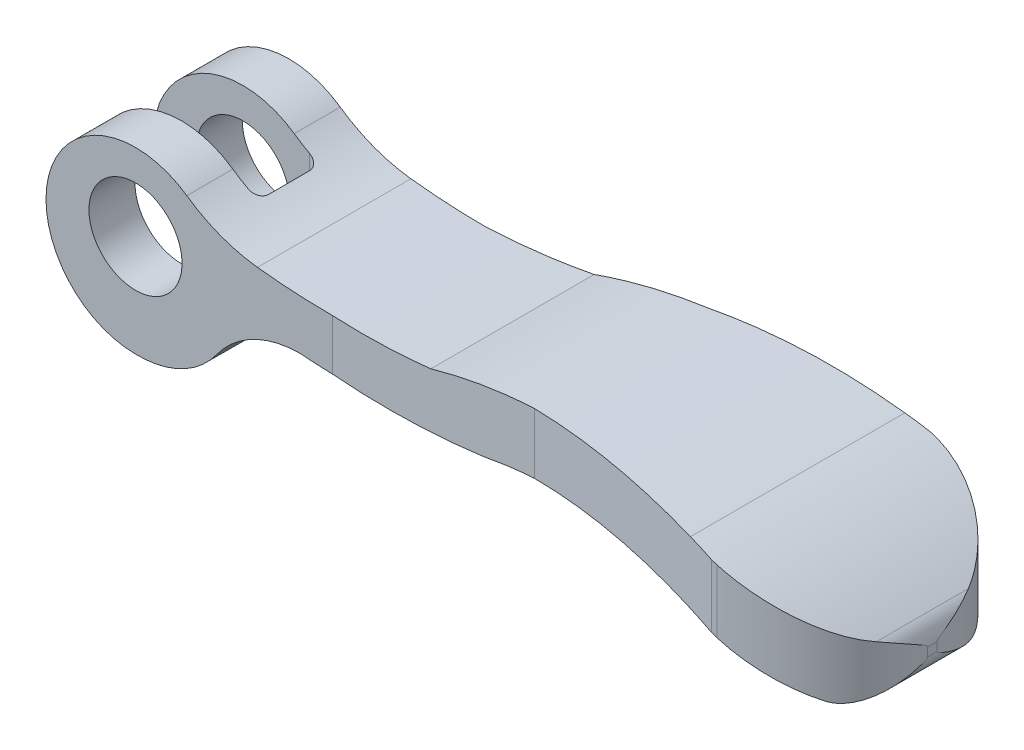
ISO-10303-21;
HEADER;
FILE_DESCRIPTION(('STEP AP214'),'2;1');
FILE_NAME('part.step','',(''),(''),'','','');
FILE_SCHEMA(('AUTOMOTIVE_DESIGN { 1 0 10303 214 1 1 1 1 }'));
ENDSEC;
DATA;
#1=APPLICATION_CONTEXT('core data for automotive mechanical design processes');
#2=APPLICATION_PROTOCOL_DEFINITION('international standard','automotive_design',2000,#1);
#3=PRODUCT_CONTEXT('',#1,'mechanical');
#4=PRODUCT('Part','Part','',(#3));
#5=PRODUCT_RELATED_PRODUCT_CATEGORY('part','',(#4));
#6=PRODUCT_DEFINITION_FORMATION('','',#4);
#7=PRODUCT_DEFINITION_CONTEXT('part definition',#1,'design');
#8=PRODUCT_DEFINITION('design','',#6,#7);
#9=PRODUCT_DEFINITION_SHAPE('','',#8);
#10=(LENGTH_UNIT() NAMED_UNIT(*) SI_UNIT(.MILLI.,.METRE.));
#11=(NAMED_UNIT(*) PLANE_ANGLE_UNIT() SI_UNIT($,.RADIAN.));
#12=(NAMED_UNIT(*) SI_UNIT($,.STERADIAN.) SOLID_ANGLE_UNIT());
#13=UNCERTAINTY_MEASURE_WITH_UNIT(LENGTH_MEASURE(1.E-05),#10,'distance_accuracy_value','');
#14=(GEOMETRIC_REPRESENTATION_CONTEXT(3) GLOBAL_UNCERTAINTY_ASSIGNED_CONTEXT((#13)) GLOBAL_UNIT_ASSIGNED_CONTEXT((#10,
#11,#12)) REPRESENTATION_CONTEXT('',''));
#15=CARTESIAN_POINT('',(0.,0.,0.));
#16=DIRECTION('',(0.,0.,1.));
#17=DIRECTION('',(1.,0.,0.));
#18=AXIS2_PLACEMENT_3D('',#15,#16,#17);
#19=CARTESIAN_POINT('',(6.5,10.765,3.));
#20=DIRECTION('',(0.,0.,1.));
#21=DIRECTION('',(1.,0.,0.));
#22=AXIS2_PLACEMENT_3D('',#19,#20,#21);
#23=PLANE('',#22);
#24=DIRECTION('',(0.,-1.,0.));
#25=VECTOR('',#24,1.);
#26=CARTESIAN_POINT('',(6.5,10.765,3.));
#27=LINE('',#26,#25);
#28=CARTESIAN_POINT('',(6.5,5.05484750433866,3.));
#29=VERTEX_POINT('',#28);
#30=CARTESIAN_POINT('',(6.5,-7.60061720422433,3.));
#31=VERTEX_POINT('',#30);
#32=EDGE_CURVE('E199',#29,#31,#27,.T.);
#33=ORIENTED_EDGE('',*,*,#32,.T.);
#34=CARTESIAN_POINT('',(0.241985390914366,-0.453082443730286,3.));
#35=DIRECTION('',(0.,0.,1.));
#36=DIRECTION('',(-0.0254721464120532,-0.999675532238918,0.));
#37=AXIS2_PLACEMENT_3D('',#34,#35,#36);
#38=CIRCLE('',#37,9.5);
#39=CARTESIAN_POINT('',(-1.13234396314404E-13,-9.95,3.));
#40=VERTEX_POINT('',#39);
#41=EDGE_CURVE('E183',#40,#31,#38,.T.);
#42=ORIENTED_EDGE('',*,*,#41,.F.);
#43=CARTESIAN_POINT('',(0.,-1.2,3.));
#44=DIRECTION('',(0.,0.,1.));
#45=DIRECTION('',(0.57327398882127,0.819363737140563,0.));
#46=AXIS2_PLACEMENT_3D('',#43,#44,#45);
#47=CIRCLE('',#46,8.75);
#48=CARTESIAN_POINT('',(5.01614740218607,5.96943269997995,3.));
#49=VERTEX_POINT('',#48);
#50=EDGE_CURVE('E1081',#49,#40,#47,.T.);
#51=ORIENTED_EDGE('',*,*,#50,.F.);
#52=CARTESIAN_POINT('',(5.01614740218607,5.96943269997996,3.));
#53=CARTESIAN_POINT('',(5.73145900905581,5.46895956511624,3.));
#54=CARTESIAN_POINT('',(6.5,5.05484750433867,3.));
#55=B_SPLINE_CURVE_WITH_KNOTS('',2,(#52,#53,#54),.UNSPECIFIED.,.F.,.F.,(3,3),(0.,1.),.UNSPECIFIED.);
#56=EDGE_CURVE('E202',#49,#29,#55,.T.);
#57=ORIENTED_EDGE('',*,*,#56,.T.);
#58=EDGE_LOOP('',(#33,#42,#51,#57));
#59=FACE_BOUND('',#58,.T.);
#60=CARTESIAN_POINT('',(4.55,0.,3.));
#61=CARTESIAN_POINT('',(4.55000493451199,0.0720497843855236,3.));
#62=CARTESIAN_POINT('',(4.5483499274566,0.144102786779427,3.));
#63=CARTESIAN_POINT('',(4.54168935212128,0.287566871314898,3.));
#64=CARTESIAN_POINT('',(4.53670642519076,0.358979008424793,3.));
#65=CARTESIAN_POINT('',(4.52339117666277,0.501162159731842,3.));
#66=CARTESIAN_POINT('',(4.51507427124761,0.571934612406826,3.));
#67=CARTESIAN_POINT('',(4.49510011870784,0.712837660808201,3.));
#68=CARTESIAN_POINT('',(4.48345074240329,0.782969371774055,3.));
#69=CARTESIAN_POINT('',(4.45681866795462,0.92259144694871,3.));
#70=CARTESIAN_POINT('',(4.44183622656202,0.992081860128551,3.));
#71=CARTESIAN_POINT('',(4.40854663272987,1.13042276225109,3.));
#72=CARTESIAN_POINT('',(4.39023225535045,1.19927151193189,3.));
#73=CARTESIAN_POINT('',(4.35028307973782,1.3363300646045,3.));
#74=CARTESIAN_POINT('',(4.32863389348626,1.40453567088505,3.));
#75=CARTESIAN_POINT('',(4.28203395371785,1.54031408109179,3.));
#76=CARTESIAN_POINT('',(4.2570622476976,1.60787968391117,3.));
#77=CARTESIAN_POINT('',(4.20225545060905,1.74621397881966,3.));
#78=CARTESIAN_POINT('',(4.17220784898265,1.81689864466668,3.));
#79=CARTESIAN_POINT('',(4.10866317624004,1.95643402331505,3.));
#80=CARTESIAN_POINT('',(4.07517718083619,2.02528977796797,3.));
#81=CARTESIAN_POINT('',(4.00477819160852,2.16117652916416,3.));
#82=CARTESIAN_POINT('',(3.96786717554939,2.22820855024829,3.));
#83=CARTESIAN_POINT('',(3.8906202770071,2.36044764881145,3.));
#84=CARTESIAN_POINT('',(3.85027771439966,2.42565082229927,3.));
#85=CARTESIAN_POINT('',(3.76541243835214,2.55543987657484,3.));
#86=CARTESIAN_POINT('',(3.72081469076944,2.61997670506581,3.));
#87=CARTESIAN_POINT('',(3.62849458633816,2.74645618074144,3.));
#88=CARTESIAN_POINT('',(3.5807828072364,2.8084065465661,3.));
#89=CARTESIAN_POINT('',(3.48224074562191,2.92971667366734,3.));
#90=CARTESIAN_POINT('',(3.43141226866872,2.9890779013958,3.));
#91=CARTESIAN_POINT('',(3.32664356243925,3.10521348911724,3.));
#92=CARTESIAN_POINT('',(3.27269701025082,3.16198214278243,3.));
#93=CARTESIAN_POINT('',(3.16187977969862,3.27278447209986,3.));
#94=CARTESIAN_POINT('',(3.10500424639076,3.32681329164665,3.));
#95=CARTESIAN_POINT('',(2.98872628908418,3.43169163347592,3.));
#96=CARTESIAN_POINT('',(2.92933263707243,3.48255087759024,3.));
#97=CARTESIAN_POINT('',(2.80802393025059,3.5810946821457,3.));
#98=CARTESIAN_POINT('',(2.74611034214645,3.62878104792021,3.));
#99=CARTESIAN_POINT('',(2.61976750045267,3.72098446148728,3.));
#100=CARTESIAN_POINT('',(2.55533322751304,3.76549462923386,3.));
#101=CARTESIAN_POINT('',(2.42553522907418,3.85034108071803,3.));
#102=CARTESIAN_POINT('',(2.36021318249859,3.89074115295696,3.));
#103=CARTESIAN_POINT('',(2.22781579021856,3.96806485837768,3.));
#104=CARTESIAN_POINT('',(2.16074656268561,4.00499896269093,3.));
#105=CARTESIAN_POINT('',(2.02486069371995,4.07539956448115,3.));
#106=CARTESIAN_POINT('',(1.9560450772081,4.10886803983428,3.));
#107=CARTESIAN_POINT('',(1.81666445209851,4.17232937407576,3.));
#108=CARTESIAN_POINT('',(1.74609623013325,4.20231517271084,3.));
#109=CARTESIAN_POINT('',(1.60782283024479,4.2570724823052,3.));
#110=CARTESIAN_POINT('',(1.54019844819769,4.28204847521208,3.));
#111=CARTESIAN_POINT('',(1.40432038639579,4.32865855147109,3.));
#112=CARTESIAN_POINT('',(1.33607412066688,4.3503142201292,3.));
#113=CARTESIAN_POINT('',(1.19895003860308,4.39027244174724,3.));
#114=CARTESIAN_POINT('',(1.13007662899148,4.40859010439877,3.));
#115=CARTESIAN_POINT('',(0.991702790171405,4.44188370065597,3.));
#116=CARTESIAN_POINT('',(0.922204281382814,4.45686761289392,3.));
#117=CARTESIAN_POINT('',(0.782582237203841,4.48349979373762,3.));
#118=CARTESIAN_POINT('',(0.712458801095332,4.49514858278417,3.));
#119=CARTESIAN_POINT('',(0.571588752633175,4.5151182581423,3.));
#120=CARTESIAN_POINT('',(0.500841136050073,4.52343205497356,3.));
#121=CARTESIAN_POINT('',(0.35872356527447,4.53673982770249,3.));
#122=CARTESIAN_POINT('',(0.287352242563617,4.54171916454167,3.));
#123=CARTESIAN_POINT('',(0.143987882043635,4.54836355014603,3.));
#124=CARTESIAN_POINT('',(0.0719938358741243,4.55000665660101,3.));
#125=CARTESIAN_POINT('',(-0.0720704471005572,4.54999333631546,3.));
#126=CARTESIAN_POINT('',(-0.144140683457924,4.54833339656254,3.));
#127=CARTESIAN_POINT('',(-0.287635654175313,4.54166186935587,3.));
#128=CARTESIAN_POINT('',(-0.359061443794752,4.53667316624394,3.));
#129=CARTESIAN_POINT('',(-0.501266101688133,4.52334903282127,3.));
#130=CARTESIAN_POINT('',(-0.572046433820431,4.51502925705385,3.));
#131=CARTESIAN_POINT('',(-0.712960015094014,4.4950510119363,3.));
#132=CARTESIAN_POINT('',(-0.783094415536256,4.48340066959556,3.));
#133=CARTESIAN_POINT('',(-0.922716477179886,4.45676857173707,3.));
#134=CARTESIAN_POINT('',(-0.992204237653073,4.44178733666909,3.));
#135=CARTESIAN_POINT('',(-1.13053445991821,4.40850196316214,3.));
#136=CARTESIAN_POINT('',(-1.19937524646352,4.39019086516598,3.));
#137=CARTESIAN_POINT('',(-1.33641250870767,4.35025016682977,3.));
#138=CARTESIAN_POINT('',(-1.40460486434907,4.32860644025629,3.));
#139=CARTESIAN_POINT('',(-1.54035126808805,4.28201899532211,3.));
#140=CARTESIAN_POINT('',(-1.60789820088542,4.25705457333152,3.));
#141=CARTESIAN_POINT('',(-1.74621410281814,4.20225576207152,3.));
#142=CARTESIAN_POINT('',(-1.81689867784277,4.17220793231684,3.));
#143=CARTESIAN_POINT('',(-1.9564339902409,4.10866309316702,3.));
#144=CARTESIAN_POINT('',(-2.02528976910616,4.07517715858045,3.));
#145=CARTESIAN_POINT('',(-2.16117653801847,4.00477821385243,3.));
#146=CARTESIAN_POINT('',(-2.22820855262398,3.96786718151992,3.));
#147=CARTESIAN_POINT('',(-2.36044764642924,3.89062027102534,3.));
#148=CARTESIAN_POINT('',(-2.42565082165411,3.85027771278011,3.));
#149=CARTESIAN_POINT('',(-2.55543987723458,3.7654124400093,3.));
#150=CARTESIAN_POINT('',(-2.61997670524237,3.72081469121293,3.));
#151=CARTESIAN_POINT('',(-2.7464561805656,3.62849458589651,3.));
#152=CARTESIAN_POINT('',(-2.80840654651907,3.58078280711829,3.));
#153=CARTESIAN_POINT('',(-2.92971667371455,3.4822407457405,3.));
#154=CARTESIAN_POINT('',(-2.98907790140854,3.43141226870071,3.));
#155=CARTESIAN_POINT('',(-3.10521348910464,3.3266435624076,3.));
#156=CARTESIAN_POINT('',(-3.16198214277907,3.27269701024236,3.));
#157=CARTESIAN_POINT('',(-3.27278447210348,3.16187977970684,3.));
#158=CARTESIAN_POINT('',(-3.326813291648,3.10500424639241,3.));
#159=CARTESIAN_POINT('',(-3.43169163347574,2.98872628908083,3.));
#160=CARTESIAN_POINT('',(-3.48255087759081,2.92933263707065,3.));
#161=CARTESIAN_POINT('',(-3.58109468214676,2.80802393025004,3.));
#162=CARTESIAN_POINT('',(-3.62878104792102,2.74611034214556,3.));
#163=CARTESIAN_POINT('',(-3.72098446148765,2.61976750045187,3.));
#164=CARTESIAN_POINT('',(-3.76549462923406,2.55533322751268,3.));
#165=CARTESIAN_POINT('',(-3.85034108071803,2.42553522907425,3.));
#166=CARTESIAN_POINT('',(-3.89074115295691,2.36021318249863,3.));
#167=CARTESIAN_POINT('',(-3.96806485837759,2.22781579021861,3.));
#168=CARTESIAN_POINT('',(-4.00499896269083,2.16074656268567,3.));
#169=CARTESIAN_POINT('',(-4.07539956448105,2.02486069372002,3.));
#170=CARTESIAN_POINT('',(-4.10886803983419,1.95604507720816,3.));
#171=CARTESIAN_POINT('',(-4.1723293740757,1.81666445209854,3.));
#172=CARTESIAN_POINT('',(-4.2023151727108,1.74609623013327,3.));
#173=CARTESIAN_POINT('',(-4.25707248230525,1.60782283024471,3.));
#174=CARTESIAN_POINT('',(-4.28204847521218,1.54019844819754,3.));
#175=CARTESIAN_POINT('',(-4.32865855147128,1.40432038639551,3.));
#176=CARTESIAN_POINT('',(-4.35031422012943,1.33607412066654,3.));
#177=CARTESIAN_POINT('',(-4.39027244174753,1.19895003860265,3.));
#178=CARTESIAN_POINT('',(-4.40859010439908,1.13007662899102,3.));
#179=CARTESIAN_POINT('',(-4.44188370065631,0.9917027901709,3.));
#180=CARTESIAN_POINT('',(-4.45686761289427,0.922204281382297,3.));
#181=CARTESIAN_POINT('',(-4.48349979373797,0.782582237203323,3.));
#182=CARTESIAN_POINT('',(-4.49514858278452,0.712458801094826,3.));
#183=CARTESIAN_POINT('',(-4.51511825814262,0.571588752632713,3.));
#184=CARTESIAN_POINT('',(-4.52343205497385,0.500841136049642,3.));
#185=CARTESIAN_POINT('',(-4.53673982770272,0.358723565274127,3.));
#186=CARTESIAN_POINT('',(-4.54171916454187,0.287352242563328,3.));
#187=CARTESIAN_POINT('',(-4.54836355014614,0.143987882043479,3.));
#188=CARTESIAN_POINT('',(-4.55000665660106,0.0719938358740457,3.));
#189=CARTESIAN_POINT('',(-4.54999333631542,-0.0720704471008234,3.));
#190=CARTESIAN_POINT('',(-4.54833339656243,-0.144140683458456,3.));
#191=CARTESIAN_POINT('',(-4.54166186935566,-0.287635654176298,3.));
#192=CARTESIAN_POINT('',(-4.5366731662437,-0.359061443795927,3.));
#193=CARTESIAN_POINT('',(-4.52334903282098,-0.50126610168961,3.));
#194=CARTESIAN_POINT('',(-4.51502925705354,-0.572046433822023,3.));
#195=CARTESIAN_POINT('',(-4.49505101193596,-0.712960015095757,3.));
#196=CARTESIAN_POINT('',(-4.48340066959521,-0.783094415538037,3.));
#197=CARTESIAN_POINT('',(-4.45676857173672,-0.922716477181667,3.));
#198=CARTESIAN_POINT('',(-4.44178733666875,-0.992204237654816,3.));
#199=CARTESIAN_POINT('',(-4.40850196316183,-1.1305344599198,3.));
#200=CARTESIAN_POINT('',(-4.39019086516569,-1.199375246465,3.));
#201=CARTESIAN_POINT('',(-4.35025016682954,-1.33641250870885,3.));
#202=CARTESIAN_POINT('',(-4.32860644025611,-1.40460486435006,3.));
#203=CARTESIAN_POINT('',(-4.28201899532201,-1.54035126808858,3.));
#204=CARTESIAN_POINT('',(-4.25705457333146,-1.60789820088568,3.));
#205=CARTESIAN_POINT('',(-4.20225576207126,-1.7462141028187,3.));
#206=CARTESIAN_POINT('',(-4.17220793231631,-1.81689867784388,3.));
#207=CARTESIAN_POINT('',(-4.10866309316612,-1.95643399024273,3.));
#208=CARTESIAN_POINT('',(-4.07517715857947,-2.02528976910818,3.));
#209=CARTESIAN_POINT('',(-4.00477821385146,-2.1611765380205,3.));
#210=CARTESIAN_POINT('',(-3.96786718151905,-2.22820855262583,3.));
#211=CARTESIAN_POINT('',(-3.89062027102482,-2.36044764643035,3.));
#212=CARTESIAN_POINT('',(-3.85027771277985,-2.42565082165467,3.));
#213=CARTESIAN_POINT('',(-3.76541244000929,-2.55543987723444,3.));
#214=CARTESIAN_POINT('',(-3.7208146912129,-2.61997670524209,3.));
#215=CARTESIAN_POINT('',(-3.62849458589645,-2.74645618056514,3.));
#216=CARTESIAN_POINT('',(-3.58078280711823,-2.80840654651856,3.));
#217=CARTESIAN_POINT('',(-3.48224074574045,-2.92971667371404,3.));
#218=CARTESIAN_POINT('',(-3.43141226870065,-2.98907790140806,3.));
#219=CARTESIAN_POINT('',(-3.32664356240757,-3.10521348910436,3.));
#220=CARTESIAN_POINT('',(-3.27269701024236,-3.16198214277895,3.));
#221=CARTESIAN_POINT('',(-3.16187977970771,-3.27278447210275,3.));
#222=CARTESIAN_POINT('',(-3.10500424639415,-3.32681329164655,3.));
#223=CARTESIAN_POINT('',(-2.98872628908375,-3.43169163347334,3.));
#224=CARTESIAN_POINT('',(-2.92933263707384,-3.48255087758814,3.));
#225=CARTESIAN_POINT('',(-2.80802393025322,-3.58109468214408,3.));
#226=CARTESIAN_POINT('',(-2.74611034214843,-3.62878104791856,3.));
#227=CARTESIAN_POINT('',(-2.61976750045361,-3.72098446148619,3.));
#228=CARTESIAN_POINT('',(-2.55533322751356,-3.76549462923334,3.));
#229=CARTESIAN_POINT('',(-2.42553522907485,-3.85034108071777,3.));
#230=CARTESIAN_POINT('',(-2.36021318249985,-3.89074115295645,3.));
#231=CARTESIAN_POINT('',(-2.22781579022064,-3.96806485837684,3.));
#232=CARTESIAN_POINT('',(-2.1607465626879,-4.00499896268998,3.));
#233=CARTESIAN_POINT('',(-2.02486069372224,-4.0753995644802,3.));
#234=CARTESIAN_POINT('',(-1.95604507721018,-4.1088680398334,3.));
#235=CARTESIAN_POINT('',(-1.81666445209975,-4.17232937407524,3.));
#236=CARTESIAN_POINT('',(-1.74609623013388,-4.20231517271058,3.));
#237=CARTESIAN_POINT('',(-1.60782283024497,-4.25707248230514,3.));
#238=CARTESIAN_POINT('',(-1.54019844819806,-4.28204847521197,3.));
#239=CARTESIAN_POINT('',(-1.40432038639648,-4.32865855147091,3.));
#240=CARTESIAN_POINT('',(-1.3360741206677,-4.35031422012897,3.));
#241=CARTESIAN_POINT('',(-1.19895003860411,-4.39027244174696,3.));
#242=CARTESIAN_POINT('',(-1.13007662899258,-4.40859010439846,3.));
#243=CARTESIAN_POINT('',(-0.991702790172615,-4.44188370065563,3.));
#244=CARTESIAN_POINT('',(-0.922204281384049,-4.45686761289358,3.));
#245=CARTESIAN_POINT('',(-0.782582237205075,-4.48349979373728,3.));
#246=CARTESIAN_POINT('',(-0.712458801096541,-4.49514858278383,3.));
#247=CARTESIAN_POINT('',(-0.571588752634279,-4.51511825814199,3.));
#248=CARTESIAN_POINT('',(-0.500841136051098,-4.52343205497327,3.));
#249=CARTESIAN_POINT('',(-0.358723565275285,-4.53673982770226,3.));
#250=CARTESIAN_POINT('',(-0.2873522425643,-4.54171916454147,3.));
#251=CARTESIAN_POINT('',(-0.143987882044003,-4.54836355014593,3.));
#252=CARTESIAN_POINT('',(-0.0719938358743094,-4.55000665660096,3.));
#253=CARTESIAN_POINT('',(0.0720704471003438,-4.54999333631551,3.));
#254=CARTESIAN_POINT('',(0.144140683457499,-4.54833339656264,3.));
#255=CARTESIAN_POINT('',(0.287635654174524,-4.54166186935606,3.));
#256=CARTESIAN_POINT('',(0.359061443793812,-4.53667316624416,3.));
#257=CARTESIAN_POINT('',(0.50126610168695,-4.52334903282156,3.));
#258=CARTESIAN_POINT('',(0.572046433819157,-4.51502925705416,3.));
#259=CARTESIAN_POINT('',(0.712960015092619,-4.49505101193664,3.));
#260=CARTESIAN_POINT('',(0.783094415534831,-4.4834006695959,3.));
#261=CARTESIAN_POINT('',(0.922716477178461,-4.45676857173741,3.));
#262=CARTESIAN_POINT('',(0.992204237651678,-4.44178733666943,3.));
#263=CARTESIAN_POINT('',(1.13053445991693,-4.40850196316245,3.));
#264=CARTESIAN_POINT('',(1.19937524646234,-4.39019086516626,3.));
#265=CARTESIAN_POINT('',(1.33641250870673,-4.35025016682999,3.));
#266=CARTESIAN_POINT('',(1.40460486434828,-4.32860644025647,3.));
#267=CARTESIAN_POINT('',(1.54035126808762,-4.28201899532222,3.));
#268=CARTESIAN_POINT('',(1.60789820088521,-4.25705457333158,3.));
#269=CARTESIAN_POINT('',(1.74621410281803,-4.20225576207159,3.));
#270=CARTESIAN_POINT('',(1.81689867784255,-4.17220793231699,3.));
#271=CARTESIAN_POINT('',(1.95643399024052,-4.10866309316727,3.));
#272=CARTESIAN_POINT('',(2.02528976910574,-4.07517715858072,3.));
#273=CARTESIAN_POINT('',(2.16117653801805,-4.0047782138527,3.));
#274=CARTESIAN_POINT('',(2.22820855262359,-3.96786718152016,3.));
#275=CARTESIAN_POINT('',(2.36044764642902,-3.8906202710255,3.));
#276=CARTESIAN_POINT('',(2.42565082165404,-3.85027771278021,3.));
#277=CARTESIAN_POINT('',(2.55543987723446,-3.76541244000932,3.));
#278=CARTESIAN_POINT('',(2.61997670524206,-3.72081469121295,3.));
#279=CARTESIAN_POINT('',(2.74645618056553,-3.62849458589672,3.));
#280=CARTESIAN_POINT('',(2.80840654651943,-3.58078280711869,3.));
#281=CARTESIAN_POINT('',(2.92971667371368,-3.48224074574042,3.));
#282=CARTESIAN_POINT('',(2.98907790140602,-3.43141226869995,3.));
#283=CARTESIAN_POINT('',(3.10521348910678,-3.3266435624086,3.));
#284=CARTESIAN_POINT('',(3.16198214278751,-3.2726970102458,3.));
#285=CARTESIAN_POINT('',(3.27278447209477,-3.16187977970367,3.));
#286=CARTESIAN_POINT('',(3.32681329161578,-3.10500424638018,3.));
#287=CARTESIAN_POINT('',(3.43169163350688,-2.98872628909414,3.));
#288=CARTESIAN_POINT('',(3.48255087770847,-2.92933263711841,3.));
#289=CARTESIAN_POINT('',(3.58109468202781,-2.80802393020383,3.));
#290=CARTESIAN_POINT('',(3.62878104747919,-2.74611034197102,3.));
#291=CARTESIAN_POINT('',(3.72098446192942,-2.61976750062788,3.));
#292=CARTESIAN_POINT('',(3.76549463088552,-2.55533322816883,3.));
#293=CARTESIAN_POINT('',(3.85034107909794,-2.42553522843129,3.));
#294=CARTESIAN_POINT('',(3.89074114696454,-2.36021318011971,3.));
#295=CARTESIAN_POINT('',(3.9680648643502,-2.22781579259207,3.));
#296=CARTESIAN_POINT('',(4.00499898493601,-2.16074657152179,3.));
#297=CARTESIAN_POINT('',(4.07539954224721,-2.02486068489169,3.));
#298=CARTESIAN_POINT('',(4.10886795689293,-1.95604504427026,3.));
#299=CARTESIAN_POINT('',(4.1723294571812,-1.81666448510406,3.));
#300=CARTESIAN_POINT('',(4.20231548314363,-1.7460963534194,3.));
#301=CARTESIAN_POINT('',(4.25706481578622,-1.60784133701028,3.));
#302=CARTESIAN_POINT('',(4.28203353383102,-1.54023561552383,3.));
#303=CARTESIAN_POINT('',(4.32863113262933,-1.40438954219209,3.));
#304=CARTESIAN_POINT('',(4.35028135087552,-1.33615651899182,3.));
#305=CARTESIAN_POINT('',(4.39023109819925,-1.1990537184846,3.));
#306=CARTESIAN_POINT('',(4.40854547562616,-1.13018827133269,3.));
#307=CARTESIAN_POINT('',(4.44183488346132,-0.991825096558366,3.));
#308=CARTESIAN_POINT('',(4.45681762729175,-0.92232922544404,3.));
#309=CARTESIAN_POINT('',(4.48344973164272,-0.782707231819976,3.));
#310=CARTESIAN_POINT('',(4.49509934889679,-0.712581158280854,3.));
#311=CARTESIAN_POINT('',(4.5150734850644,-0.571700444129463,3.));
#312=CARTESIAN_POINT('',(4.52339065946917,-0.500944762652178,3.));
#313=CARTESIAN_POINT('',(4.53670590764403,-0.358806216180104,3.));
#314=CARTESIAN_POINT('',(4.54168909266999,-0.287421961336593,3.));
#315=CARTESIAN_POINT('',(4.54834967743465,-0.14402477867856,3.));
#316=CARTESIAN_POINT('',(4.55000495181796,-0.0720108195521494,3.));
#317=CARTESIAN_POINT('',(4.55,0.,3.));
#318=B_SPLINE_CURVE_WITH_KNOTS('',3,(#60,#61,#62,#63,#64,#65,#66,#67,#68,#69,#70,#71,#72,#73,
#74,#75,#76,#77,#78,#79,#80,#81,#82,#83,#84,#85,#86,#87,#88,#89,#90,#91,#92,#93,#94,#95,#96,#97,
#98,#99,#100,#101,#102,#103,#104,#105,#106,#107,#108,#109,#110,#111,#112,#113,#114,#115,#116,
#117,#118,#119,#120,#121,#122,#123,#124,#125,#126,#127,#128,#129,#130,#131,#132,#133,#134,#135,
#136,#137,#138,#139,#140,#141,#142,#143,#144,#145,#146,#147,#148,#149,#150,#151,#152,#153,#154,
#155,#156,#157,#158,#159,#160,#161,#162,#163,#164,#165,#166,#167,#168,#169,#170,#171,#172,#173,
#174,#175,#176,#177,#178,#179,#180,#181,#182,#183,#184,#185,#186,#187,#188,#189,#190,#191,#192,
#193,#194,#195,#196,#197,#198,#199,#200,#201,#202,#203,#204,#205,#206,#207,#208,#209,#210,#211,
#212,#213,#214,#215,#216,#217,#218,#219,#220,#221,#222,#223,#224,#225,#226,#227,#228,#229,#230,
#231,#232,#233,#234,#235,#236,#237,#238,#239,#240,#241,#242,#243,#244,#245,#246,#247,#248,#249,
#250,#251,#252,#253,#254,#255,#256,#257,#258,#259,#260,#261,#262,#263,#264,#265,#266,#267,#268,
#269,#270,#271,#272,#273,#274,#275,#276,#277,#278,#279,#280,#281,#282,#283,#284,#285,#286,#287,
#288,#289,#290,#291,#292,#293,#294,#295,#296,#297,#298,#299,#300,#301,#302,#303,#304,#305,#306,
#307,#308,#309,#310,#311,#312,#313,#314,#315,#316,#317),.UNSPECIFIED.,.F.,.F.,(4,2,2,2,2,2,2,2,
2,2,2,2,2,2,2,2,2,2,2,2,2,2,2,2,2,2,2,2,2,2,2,2,2,2,2,2,2,2,2,2,2,2,2,2,2,2,2,2,2,2,2,2,2,2,2,2,
2,2,2,2,2,2,2,2,2,2,2,2,2,2,2,2,2,2,2,2,2,2,2,2,2,2,2,2,2,2,2,2,2,2,2,2,2,2,2,2,2,2,2,2,2,2,2,2,
2,2,2,2,2,2,2,2,2,2,2,2,2,2,2,2,2,2,2,2,2,2,2,2,4),(0.,0.21613485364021,0.430814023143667,
0.644511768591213,0.857708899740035,1.07088961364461,1.28453821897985,1.499135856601,
1.71515732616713,1.94547823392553,2.17507921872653,2.40454843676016,2.63447505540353,
2.86971296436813,3.10418967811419,3.33853181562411,3.57336707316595,3.80860496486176,
4.04308167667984,4.27742381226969,4.51225905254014,4.74257991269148,4.97218089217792,
5.20165010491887,5.43157667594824,5.6477680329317,5.86248819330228,6.07621086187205,
6.28941639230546,6.5025886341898,6.7162116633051,6.93076650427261,7.14672795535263,
7.36291921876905,7.57763933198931,7.79136198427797,8.00456751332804,8.21773975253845,
8.43136276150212,8.64591754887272,8.86187889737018,9.09219980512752,9.32180078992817,
9.55127000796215,9.78119662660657,10.0164345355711,10.2509112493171,10.4852533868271,
10.720088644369,10.955326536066,11.1898032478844,11.4241453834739,11.6589806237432,
11.8893014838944,12.1189024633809,12.3483716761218,12.5782982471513,12.794489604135,
13.0092097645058,13.2229324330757,13.4361379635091,13.6493102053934,13.8629332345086,
14.077488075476,14.2934495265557,14.509640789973,14.7243609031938,14.9380835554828,
15.151289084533,15.3644613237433,15.5780843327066,15.7926391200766,16.0086004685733,
16.2389213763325,16.4685223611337,16.6979915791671,16.9279181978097,17.1631561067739,
17.3976328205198,17.6319749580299,17.8668102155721,18.1020481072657,18.336524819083,
18.5708669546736,18.8057021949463,19.0360230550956,19.2656240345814,19.495093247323,
19.7250198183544,19.9412111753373,20.1559313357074,20.369654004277,20.5828595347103,
20.7960317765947,21.0096548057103,21.2242096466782,21.4401710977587,21.6563623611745,
21.8710824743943,22.0848051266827,22.2980106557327,22.5111828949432,22.7248059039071,
22.9393606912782,23.1553220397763,23.3856429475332,23.6152439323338,23.8447131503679,
24.0746397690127,24.309877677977,24.5443543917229,24.778696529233,25.0135317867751,
25.2487696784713,25.4832463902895,25.7175885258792,25.9524237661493,26.1827446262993,
26.4123456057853,26.6418148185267,26.8717413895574,27.0878726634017,27.3025500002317,
27.5162470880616,27.7294441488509,27.9426247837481,28.1562727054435,28.3708684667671,
28.5868862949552),.UNSPECIFIED.);
#319=CARTESIAN_POINT('',(4.55,0.,3.));
#320=VERTEX_POINT('',#319);
#321=EDGE_CURVE('E328',#320,#320,#318,.T.);
#322=ORIENTED_EDGE('',*,*,#321,.T.);
#323=EDGE_LOOP('',(#322));
#324=FACE_BOUND('',#323,.T.);
#325=ADVANCED_FACE('F16',(#59,#324),#23,.F.);
#326=CARTESIAN_POINT('',(6.5,10.765,2.));
#327=DIRECTION('',(0.,-1.,0.));
#328=DIRECTION('',(0.,0.,-1.));
#329=AXIS2_PLACEMENT_3D('',#326,#327,#328);
#330=CYLINDRICAL_SURFACE('',#329,1.);
#331=CARTESIAN_POINT('',(6.50000000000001,-7.60061720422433,3.));
#332=CARTESIAN_POINT('',(6.5211338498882,-7.58211393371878,3.00000062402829));
#333=CARTESIAN_POINT('',(6.54218712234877,-7.56351475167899,2.99944335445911));
#334=CARTESIAN_POINT('',(6.58374927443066,-7.52646857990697,2.99717635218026));
#335=CARTESIAN_POINT('',(6.60426142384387,-7.50802408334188,2.99548563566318));
#336=CARTESIAN_POINT('',(6.64474921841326,-7.47129814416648,2.99095232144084));
#337=CARTESIAN_POINT('',(6.66472830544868,-7.45301835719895,2.98812723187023));
#338=CARTESIAN_POINT('',(6.70415688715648,-7.41663394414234,2.98132699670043));
#339=CARTESIAN_POINT('',(6.7236098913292,-7.39853019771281,2.9773675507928));
#340=CARTESIAN_POINT('',(6.76199363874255,-7.3625091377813,2.96830046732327));
#341=CARTESIAN_POINT('',(6.780927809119,-7.34459205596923,2.96320645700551));
#342=CARTESIAN_POINT('',(6.81828129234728,-7.3089552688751,2.95187243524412));
#343=CARTESIAN_POINT('',(6.83670378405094,-7.29123530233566,2.94564374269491));
#344=CARTESIAN_POINT('',(6.87304149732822,-7.25600318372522,2.93204276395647));
#345=CARTESIAN_POINT('',(6.89095946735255,-7.23849046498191,2.92467929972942));
#346=CARTESIAN_POINT('',(6.92629586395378,-7.20368281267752,2.90881133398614));
#347=CARTESIAN_POINT('',(6.94371641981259,-7.18638721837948,2.90031302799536));
#348=CARTESIAN_POINT('',(6.9780659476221,-7.15202319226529,2.88217815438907));
#349=CARTESIAN_POINT('',(6.99499624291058,-7.1349542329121,2.87254509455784));
#350=CARTESIAN_POINT('',(7.02837309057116,-7.1010526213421,2.85214311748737));
#351=CARTESIAN_POINT('',(7.0448199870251,-7.08421980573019,2.84137503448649));
#352=CARTESIAN_POINT('',(7.07723898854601,-7.05079803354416,2.81870690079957));
#353=CARTESIAN_POINT('',(7.09321030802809,-7.03420950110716,2.8068051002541));
#354=CARTESIAN_POINT('',(7.12468350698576,-7.00128736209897,2.78186760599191));
#355=CARTESIAN_POINT('',(7.14018334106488,-6.98495498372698,2.76882772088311));
#356=CARTESIAN_POINT('',(7.17249659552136,-6.95066922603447,2.74006325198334));
#357=CARTESIAN_POINT('',(7.1892397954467,-6.93276096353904,2.72420517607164));
#358=CARTESIAN_POINT('',(7.21355919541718,-6.90655407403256,2.69960906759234));
#359=CARTESIAN_POINT('',(7.22143176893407,-6.89803861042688,2.69139181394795));
#360=CARTESIAN_POINT('',(7.23684937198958,-6.88130187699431,2.67476093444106));
#361=CARTESIAN_POINT('',(7.24439768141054,-6.87307806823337,2.66635292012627));
#362=CARTESIAN_POINT('',(7.2591700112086,-6.8569279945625,2.64934150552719));
#363=CARTESIAN_POINT('',(7.26639730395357,-6.84899906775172,2.64074347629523));
#364=CARTESIAN_POINT('',(7.28053079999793,-6.83344193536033,2.62335206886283));
#365=CARTESIAN_POINT('',(7.28744024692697,-6.82581097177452,2.6145637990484));
#366=CARTESIAN_POINT('',(7.30094114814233,-6.8108527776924,2.59679224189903));
#367=CARTESIAN_POINT('',(7.30753579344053,-6.80352272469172,2.58781375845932));
#368=CARTESIAN_POINT('',(7.32041010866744,-6.78916918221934,2.56966208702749));
#369=CARTESIAN_POINT('',(7.32669288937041,-6.78214284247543,2.56049336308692));
#370=CARTESIAN_POINT('',(7.3389463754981,-6.76839941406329,2.5419615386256));
#371=CARTESIAN_POINT('',(7.34492008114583,-6.76167948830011,2.53260252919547));
#372=CARTESIAN_POINT('',(7.35655833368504,-6.74855127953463,2.51369063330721));
#373=CARTESIAN_POINT('',(7.36222573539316,-6.74214021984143,2.50414143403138));
#374=CARTESIAN_POINT('',(7.37325383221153,-6.72963238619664,2.48484916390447));
#375=CARTESIAN_POINT('',(7.37861720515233,-6.72353294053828,2.47510935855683));
#376=CARTESIAN_POINT('',(7.38904099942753,-6.7116492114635,2.45543782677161));
#377=CARTESIAN_POINT('',(7.39410386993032,-6.70586242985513,2.44550890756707));
#378=CARTESIAN_POINT('',(7.40462258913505,-6.69381160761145,2.42403005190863));
#379=CARTESIAN_POINT('',(7.41004126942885,-6.68758631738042,2.41244002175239));
#380=CARTESIAN_POINT('',(7.42038479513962,-6.675673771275,2.38915794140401));
#381=CARTESIAN_POINT('',(7.42531810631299,-6.66997746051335,2.37747430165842));
#382=CARTESIAN_POINT('',(7.43469629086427,-6.65912468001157,2.35400732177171));
#383=CARTESIAN_POINT('',(7.43914931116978,-6.65395931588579,2.34223136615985));
#384=CARTESIAN_POINT('',(7.4475703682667,-6.64417168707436,2.3185804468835));
#385=CARTESIAN_POINT('',(7.45154610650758,-6.63954086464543,2.30671178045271));
#386=CARTESIAN_POINT('',(7.45901631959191,-6.63082450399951,2.28287668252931));
#387=CARTESIAN_POINT('',(7.46251785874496,-6.62673099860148,2.27091538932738));
#388=CARTESIAN_POINT('',(7.46904310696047,-6.6190910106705,2.2468962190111));
#389=CARTESIAN_POINT('',(7.47207305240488,-6.61553740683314,2.23484230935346));
#390=CARTESIAN_POINT('',(7.47765840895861,-6.60897834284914,2.21063912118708));
#391=CARTESIAN_POINT('',(7.48021903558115,-6.60596686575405,2.19849268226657));
#392=CARTESIAN_POINT('',(7.4848688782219,-6.60049259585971,2.17410558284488));
#393=CARTESIAN_POINT('',(7.48696210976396,-6.59802513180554,2.16186673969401));
#394=CARTESIAN_POINT('',(7.4906800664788,-6.59363891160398,2.13729586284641));
#395=CARTESIAN_POINT('',(7.49230745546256,-6.59171703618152,2.12496479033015));
#396=CARTESIAN_POINT('',(7.49509651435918,-6.58842136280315,2.10021028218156));
#397=CARTESIAN_POINT('',(7.4962593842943,-6.5870461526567,2.08778717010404));
#398=CARTESIAN_POINT('',(7.49812151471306,-6.58484326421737,2.06284924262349));
#399=CARTESIAN_POINT('',(7.49882045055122,-6.58401596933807,2.05033436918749));
#400=CARTESIAN_POINT('',(7.49975801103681,-6.5829059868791,2.02521305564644));
#401=CARTESIAN_POINT('',(7.49999478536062,-6.58262548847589,2.01260644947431));
#402=CARTESIAN_POINT('',(7.50000000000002,-6.58261945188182,2.));
#403=B_SPLINE_CURVE_WITH_KNOTS('',3,(#331,#332,#333,#334,#335,#336,#337,#338,#339,#340,#341,
#342,#343,#344,#345,#346,#347,#348,#349,#350,#351,#352,#353,#354,#355,#356,#357,#358,#359,#360,
#361,#362,#363,#364,#365,#366,#367,#368,#369,#370,#371,#372,#373,#374,#375,#376,#377,#378,#379,
#380,#381,#382,#383,#384,#385,#386,#387,#388,#389,#390,#391,#392,#393,#394,#395,#396,#397,#398,
#399,#400,#401,#402),.UNSPECIFIED.,.F.,.F.,(4,2,2,2,2,2,2,2,2,2,2,2,2,2,2,2,2,2,2,2,2,2,2,2,2,2,
2,2,2,2,2,2,2,2,2,4),(0.,0.0842658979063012,0.167152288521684,0.248805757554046,
0.329379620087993,0.409033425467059,0.487932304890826,0.566246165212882,0.64414874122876,
0.721816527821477,0.799427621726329,0.877160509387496,0.955192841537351,1.04273811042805,
1.08537258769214,1.12729141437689,1.16853122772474,1.20913050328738,1.24912956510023,
1.28857057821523,1.32749752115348,1.36595613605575,1.40399385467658,1.44165969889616,
1.48433025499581,1.52602390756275,1.56683226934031,1.60685303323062,1.64618976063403,
1.6849514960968,1.72325219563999,1.76120996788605,1.79894614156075,1.83658418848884,
1.87424854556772,1.91206338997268),.UNSPECIFIED.);
#404=CARTESIAN_POINT('',(7.5,-6.58261945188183,2.));
#405=VERTEX_POINT('',#404);
#406=EDGE_CURVE('E188',#31,#405,#403,.T.);
#407=ORIENTED_EDGE('',*,*,#406,.F.);
#408=ORIENTED_EDGE('',*,*,#32,.F.);
#409=CARTESIAN_POINT('',(6.5,5.05484750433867,3.));
#410=CARTESIAN_POINT('',(6.51839410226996,5.0449363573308,3.00000040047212));
#411=CARTESIAN_POINT('',(6.53682032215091,5.03508400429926,2.99949248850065));
#412=CARTESIAN_POINT('',(6.57325987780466,5.01573165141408,2.99747584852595));
#413=CARTESIAN_POINT('',(6.59127296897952,5.00622875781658,2.99599039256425));
#414=CARTESIAN_POINT('',(6.62683712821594,4.98757522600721,2.99208107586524));
#415=CARTESIAN_POINT('',(6.64438911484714,4.97842155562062,2.9896800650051));
#416=CARTESIAN_POINT('',(6.67898813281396,4.96046667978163,2.98400363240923));
#417=CARTESIAN_POINT('',(6.69603717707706,4.9516622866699,2.98075056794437));
#418=CARTESIAN_POINT('',(6.72959359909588,4.93440610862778,2.97343433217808));
#419=CARTESIAN_POINT('',(6.74610400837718,4.92595097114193,2.96939297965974));
#420=CARTESIAN_POINT('',(6.77855234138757,4.90939347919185,2.96056450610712));
#421=CARTESIAN_POINT('',(6.79449424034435,4.90128759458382,2.95579862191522));
#422=CARTESIAN_POINT('',(6.82578035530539,4.88542879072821,2.94558498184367));
#423=CARTESIAN_POINT('',(6.84112941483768,4.87767215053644,2.94015784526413));
#424=CARTESIAN_POINT('',(6.87120996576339,4.86251203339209,2.92868478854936));
#425=CARTESIAN_POINT('',(6.88594709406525,4.85510463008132,2.92265884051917));
#426=CARTESIAN_POINT('',(6.91478889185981,4.84064319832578,2.91005010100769));
#427=CARTESIAN_POINT('',(6.92889991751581,4.83358502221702,2.90348661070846));
#428=CARTESIAN_POINT('',(6.95647928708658,4.81982227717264,2.88986328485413));
#429=CARTESIAN_POINT('',(6.96995463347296,4.813113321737,2.88282206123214));
#430=CARTESIAN_POINT('',(6.99625675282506,4.80004925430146,2.86830207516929));
#431=CARTESIAN_POINT('',(7.00909110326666,4.79368949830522,2.86084122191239));
#432=CARTESIAN_POINT('',(7.03410934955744,4.78132413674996,2.84553886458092));
#433=CARTESIAN_POINT('',(7.04630132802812,4.77531360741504,2.83771455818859));
#434=CARTESIAN_POINT('',(7.07003657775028,4.76364684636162,2.82174013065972));
#435=CARTESIAN_POINT('',(7.08158837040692,4.75798539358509,2.81360648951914));
#436=CARTESIAN_POINT('',(7.1040484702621,4.7470176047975,2.79706587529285));
#437=CARTESIAN_POINT('',(7.11496566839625,4.74170570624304,2.78867466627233));
#438=CARTESIAN_POINT('',(7.13616432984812,4.73143556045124,2.77166949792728));
#439=CARTESIAN_POINT('',(7.14645500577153,4.72647145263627,2.76307057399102));
#440=CARTESIAN_POINT('',(7.16641280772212,4.71690367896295,2.745696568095));
#441=CARTESIAN_POINT('',(7.17608935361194,4.71229356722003,2.73693584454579));
#442=CARTESIAN_POINT('',(7.19828816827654,4.70177082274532,2.71602840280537));
#443=CARTESIAN_POINT('',(7.21069344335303,4.69593153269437,2.70371991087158));
#444=CARTESIAN_POINT('',(7.2347928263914,4.68462680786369,2.6785135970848));
#445=CARTESIAN_POINT('',(7.24649262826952,4.67915831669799,2.66562258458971));
#446=CARTESIAN_POINT('',(7.26915890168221,4.66860300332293,2.63929138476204));
#447=CARTESIAN_POINT('',(7.28013121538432,4.66351308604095,2.6258574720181));
#448=CARTESIAN_POINT('',(7.30131977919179,4.65371281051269,2.59848430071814));
#449=CARTESIAN_POINT('',(7.31154199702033,4.64899942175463,2.58455074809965));
#450=CARTESIAN_POINT('',(7.33121103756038,4.63995270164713,2.55622201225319));
#451=CARTESIAN_POINT('',(7.34066389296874,4.63561639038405,2.54183197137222));
#452=CARTESIAN_POINT('',(7.35877722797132,4.6273236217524,2.51263467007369));
#453=CARTESIAN_POINT('',(7.3674437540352,4.62336425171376,2.49783198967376));
#454=CARTESIAN_POINT('',(7.38397006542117,4.61582533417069,2.46785411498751));
#455=CARTESIAN_POINT('',(7.39183585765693,4.61224295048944,2.45268294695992));
#456=CARTESIAN_POINT('',(7.4067488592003,4.60545791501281,2.42201301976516));
#457=CARTESIAN_POINT('',(7.4138019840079,4.60225251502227,2.40651774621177));
#458=CARTESIAN_POINT('',(7.42708032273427,4.59622135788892,2.37524458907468));
#459=CARTESIAN_POINT('',(7.43331131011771,4.59339295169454,2.35946966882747));
#460=CARTESIAN_POINT('',(7.44493852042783,4.58811567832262,2.32768212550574));
#461=CARTESIAN_POINT('',(7.45034032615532,4.5856642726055,2.31167196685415));
#462=CARTESIAN_POINT('',(7.46030475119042,4.58114088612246,2.27945864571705));
#463=CARTESIAN_POINT('',(7.46487271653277,4.57906648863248,2.26325747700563));
#464=CARTESIAN_POINT('',(7.47316742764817,4.57529699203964,2.23070649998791));
#465=CARTESIAN_POINT('',(7.47689923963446,4.57359960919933,2.21435824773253));
#466=CARTESIAN_POINT('',(7.48352191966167,4.57058400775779,2.18155700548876));
#467=CARTESIAN_POINT('',(7.48641753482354,4.56926364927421,2.1651051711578));
#468=CARTESIAN_POINT('',(7.49137043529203,4.56700193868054,2.1321401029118));
#469=CARTESIAN_POINT('',(7.49343211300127,4.56605860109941,2.11562766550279));
#470=CARTESIAN_POINT('',(7.49672168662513,4.56455081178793,2.0825839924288));
#471=CARTESIAN_POINT('',(7.49795359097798,4.56398453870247,2.06605323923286));
#472=CARTESIAN_POINT('',(7.49959127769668,4.56323057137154,2.03301491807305));
#473=CARTESIAN_POINT('',(7.50000065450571,4.56304122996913,2.01650756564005));
#474=CARTESIAN_POINT('',(7.5,4.56304134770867,2.));
#475=B_SPLINE_CURVE_WITH_KNOTS('',3,(#409,#410,#411,#412,#413,#414,#415,#416,#417,#418,#419,
#420,#421,#422,#423,#424,#425,#426,#427,#428,#429,#430,#431,#432,#433,#434,#435,#436,#437,#438,
#439,#440,#441,#442,#443,#444,#445,#446,#447,#448,#449,#450,#451,#452,#453,#454,#455,#456,#457,
#458,#459,#460,#461,#462,#463,#464,#465,#466,#467,#468,#469,#470,#471,#472,#473,#474),
.UNSPECIFIED.,.F.,.F.,(4,2,2,2,2,2,2,2,2,2,2,2,2,2,2,2,2,2,2,2,2,2,2,2,2,2,2,2,2,2,2,2,4),(0.,
0.0626772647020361,0.123913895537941,0.183712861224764,0.242077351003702,0.299010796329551,
0.354516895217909,0.408599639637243,0.461263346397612,0.512512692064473,0.562352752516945,
0.610789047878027,0.657827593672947,0.70347495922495,0.747738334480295,0.790625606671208,
0.832145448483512,0.887393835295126,0.942110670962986,0.996315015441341,1.05002647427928,
1.10326519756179,1.15605187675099,1.20840773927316,1.26035454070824,1.31191455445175,
1.36311055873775,1.41396582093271,1.46450407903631,1.51474952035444,1.56472675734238,
1.6144608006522,1.66397702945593),.UNSPECIFIED.);
#476=CARTESIAN_POINT('',(7.5,4.56304134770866,2.));
#477=VERTEX_POINT('',#476);
#478=EDGE_CURVE('E266',#29,#477,#475,.T.);
#479=ORIENTED_EDGE('',*,*,#478,.T.);
#480=DIRECTION('',(0.,1.,0.));
#481=VECTOR('',#480,1.);
#482=CARTESIAN_POINT('',(7.5,10.765,2.));
#483=LINE('',#482,#481);
#484=EDGE_CURVE('E207',#477,#405,#483,.F.);
#485=ORIENTED_EDGE('',*,*,#484,.T.);
#486=EDGE_LOOP('',(#407,#408,#479,#485));
#487=FACE_BOUND('',#486,.T.);
#488=ADVANCED_FACE('F210',(#487),#330,.F.);
#489=CARTESIAN_POINT('',(7.5,10.765,-2.));
#490=DIRECTION('',(1.,0.,0.));
#491=DIRECTION('',(0.,0.,-1.));
#492=AXIS2_PLACEMENT_3D('',#489,#490,#491);
#493=PLANE('',#492);
#494=DIRECTION('',(0.,-1.,0.));
#495=VECTOR('',#494,1.);
#496=CARTESIAN_POINT('',(7.5,10.765,-2.));
#497=LINE('',#496,#495);
#498=CARTESIAN_POINT('',(7.5,4.56304134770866,-2.));
#499=VERTEX_POINT('',#498);
#500=CARTESIAN_POINT('',(7.5,-6.58261945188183,-2.));
#501=VERTEX_POINT('',#500);
#502=EDGE_CURVE('E253',#499,#501,#497,.T.);
#503=ORIENTED_EDGE('',*,*,#502,.T.);
#504=DIRECTION('',(0.,0.,-1.));
#505=VECTOR('',#504,1.);
#506=CARTESIAN_POINT('',(7.5,-6.58261945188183,10.75));
#507=LINE('',#506,#505);
#508=EDGE_CURVE('E212',#405,#501,#507,.T.);
#509=ORIENTED_EDGE('',*,*,#508,.F.);
#510=ORIENTED_EDGE('',*,*,#484,.F.);
#511=DIRECTION('',(0.,0.,-1.));
#512=VECTOR('',#511,1.);
#513=CARTESIAN_POINT('',(7.5,4.56304134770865,10.75));
#514=LINE('',#513,#512);
#515=EDGE_CURVE('E270',#477,#499,#514,.T.);
#516=ORIENTED_EDGE('',*,*,#515,.T.);
#517=EDGE_LOOP('',(#503,#509,#510,#516));
#518=FACE_BOUND('',#517,.T.);
#519=ADVANCED_FACE('F229',(#518),#493,.F.);
#520=CARTESIAN_POINT('',(6.5,10.765,-2.));
#521=DIRECTION('',(0.,-1.,0.));
#522=DIRECTION('',(0.,0.,-1.));
#523=AXIS2_PLACEMENT_3D('',#520,#521,#522);
#524=CYLINDRICAL_SURFACE('',#523,1.);
#525=CARTESIAN_POINT('',(7.50000000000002,-6.58261945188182,-2.));
#526=CARTESIAN_POINT('',(7.49999422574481,-6.5826261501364,-2.01260499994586));
#527=CARTESIAN_POINT('',(7.4997557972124,-6.58290860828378,-2.02521009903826));
#528=CARTESIAN_POINT('',(7.49881299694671,-6.58402479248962,-2.05033107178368));
#529=CARTESIAN_POINT('',(7.49811036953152,-6.58485645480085,-2.06284710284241));
#530=CARTESIAN_POINT('',(7.49623892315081,-6.58707035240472,-2.08779000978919));
#531=CARTESIAN_POINT('',(7.49507030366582,-6.58845235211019,-2.10021692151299));
#532=CARTESIAN_POINT('',(7.49226782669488,-6.59176384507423,-2.12498171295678));
#533=CARTESIAN_POINT('',(7.49063262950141,-6.59369491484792,-2.13731922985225));
#534=CARTESIAN_POINT('',(7.48689713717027,-6.59810174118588,-2.16190569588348));
#535=CARTESIAN_POINT('',(7.48479402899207,-6.60058079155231,-2.17415362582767));
#536=CARTESIAN_POINT('',(7.48012250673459,-6.60608043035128,-2.19856161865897));
#537=CARTESIAN_POINT('',(7.47754992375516,-6.60910586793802,-2.2107197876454));
#538=CARTESIAN_POINT('',(7.47193871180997,-6.61569503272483,-2.23494917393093));
#539=CARTESIAN_POINT('',(7.46889471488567,-6.61926495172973,-2.24701745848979));
#540=CARTESIAN_POINT('',(7.4623393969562,-6.62693973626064,-2.27106813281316));
#541=CARTESIAN_POINT('',(7.45882169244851,-6.63105188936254,-2.28304644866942));
#542=CARTESIAN_POINT('',(7.45131714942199,-6.63980770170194,-2.30691835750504));
#543=CARTESIAN_POINT('',(7.44732310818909,-6.64445948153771,-2.31880669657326));
#544=CARTESIAN_POINT('',(7.43886341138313,-6.65429116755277,-2.34249973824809));
#545=CARTESIAN_POINT('',(7.43438992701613,-6.65947976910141,-2.35429802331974));
#546=CARTESIAN_POINT('',(7.42496872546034,-6.67038117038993,-2.3778124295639));
#547=CARTESIAN_POINT('',(7.4200127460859,-6.6761029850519,-2.38952104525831));
#548=CARTESIAN_POINT('',(7.40962179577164,-6.68806861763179,-2.41285589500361));
#549=CARTESIAN_POINT('',(7.40417825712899,-6.69432159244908,-2.42447360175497));
#550=CARTESIAN_POINT('',(7.39361923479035,-6.70641675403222,-2.44598989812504));
#551=CARTESIAN_POINT('',(7.38854131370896,-6.71221981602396,-2.45592906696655));
#552=CARTESIAN_POINT('',(7.3780875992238,-6.72413568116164,-2.4756210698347));
#553=CARTESIAN_POINT('',(7.37270936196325,-6.73025097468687,-2.48537109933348));
#554=CARTESIAN_POINT('',(7.36165175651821,-6.74279002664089,-2.50468383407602));
#555=CARTESIAN_POINT('',(7.35596971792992,-6.74921644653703,-2.51424327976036));
#556=CARTESIAN_POINT('',(7.34430239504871,-6.76237491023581,-2.53317566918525));
#557=CARTESIAN_POINT('',(7.33831426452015,-6.769109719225,-2.54254493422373));
#558=CARTESIAN_POINT('',(7.32603213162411,-6.78288244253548,-2.56109727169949));
#559=CARTESIAN_POINT('',(7.31973513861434,-6.78992318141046,-2.57027626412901));
#560=CARTESIAN_POINT('',(7.3068325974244,-6.8043050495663,-2.58844847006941));
#561=CARTESIAN_POINT('',(7.30022394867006,-6.81164901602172,-2.59743723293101));
#562=CARTESIAN_POINT('',(7.28669523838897,-6.82663456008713,-2.61522934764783));
#563=CARTESIAN_POINT('',(7.27977199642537,-6.83427894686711,-2.6240279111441));
#564=CARTESIAN_POINT('',(7.26561110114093,-6.84986245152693,-2.64143989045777));
#565=CARTESIAN_POINT('',(7.25837021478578,-6.85780431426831,-2.65004821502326));
#566=CARTESIAN_POINT('',(7.24357090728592,-6.87397976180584,-2.66708024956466));
#567=CARTESIAN_POINT('',(7.23600922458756,-6.88221599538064,-2.67549860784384));
#568=CARTESIAN_POINT('',(7.22056500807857,-6.89897715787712,-2.69215002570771));
#569=CARTESIAN_POINT('',(7.21267920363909,-6.90750461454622,-2.70037749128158));
#570=CARTESIAN_POINT('',(7.18832102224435,-6.93374602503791,-2.72500467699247));
#571=CARTESIAN_POINT('',(7.17155272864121,-6.9516759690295,-2.74088493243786));
#572=CARTESIAN_POINT('',(7.13926070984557,-6.98592897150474,-2.76962239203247));
#573=CARTESIAN_POINT('',(7.12381005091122,-7.00220505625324,-2.78261851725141));
#574=CARTESIAN_POINT('',(7.09243109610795,-7.03502036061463,-2.80747121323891));
#575=CARTESIAN_POINT('',(7.07650469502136,-7.05155843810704,-2.81933167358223));
#576=CARTESIAN_POINT('',(7.04417209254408,-7.08488419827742,-2.84192172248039));
#577=CARTESIAN_POINT('',(7.02776652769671,-7.1016715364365,-2.85265273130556));
#578=CARTESIAN_POINT('',(6.99446861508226,-7.13548724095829,-2.87298468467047));
#579=CARTESIAN_POINT('',(6.97757578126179,-7.15251583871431,-2.88258444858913));
#580=CARTESIAN_POINT('',(6.94329740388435,-7.18680406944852,-2.90065700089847));
#581=CARTESIAN_POINT('',(6.92591040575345,-7.20406428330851,-2.90912592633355));
#582=CARTESIAN_POINT('',(6.89063723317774,-7.23880605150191,-2.92493937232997));
#583=CARTESIAN_POINT('',(6.87274881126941,-7.2562883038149,-2.93227734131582));
#584=CARTESIAN_POINT('',(6.83646619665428,-7.29146429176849,-2.94583157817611));
#585=CARTESIAN_POINT('',(6.81806915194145,-7.30915861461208,-2.95203867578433));
#586=CARTESIAN_POINT('',(6.78076244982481,-7.34474884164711,-2.96333374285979));
#587=CARTESIAN_POINT('',(6.76184952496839,-7.36264501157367,-2.96841006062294));
#588=CARTESIAN_POINT('',(6.72350403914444,-7.39862889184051,-2.97744597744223));
#589=CARTESIAN_POINT('',(6.70406797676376,-7.4167163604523,-2.98139163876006));
#590=CARTESIAN_POINT('',(6.66466892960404,-7.45307277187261,-2.98816849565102));
#591=CARTESIAN_POINT('',(6.64470237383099,-7.47134081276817,-2.9909837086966));
#592=CARTESIAN_POINT('',(6.60423517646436,-7.50804771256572,-2.99550144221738));
#593=CARTESIAN_POINT('',(6.58373104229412,-7.52648488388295,-2.99718620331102));
#594=CARTESIAN_POINT('',(6.54218032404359,-7.56352075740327,-2.99944539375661));
#595=CARTESIAN_POINT('',(6.52113042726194,-7.58211692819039,-3.00000058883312));
#596=CARTESIAN_POINT('',(6.50000000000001,-7.60061720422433,-3.));
#597=B_SPLINE_CURVE_WITH_KNOTS('',3,(#525,#526,#527,#528,#529,#530,#531,#532,#533,#534,#535,
#536,#537,#538,#539,#540,#541,#542,#543,#544,#545,#546,#547,#548,#549,#550,#551,#552,#553,#554,
#555,#556,#557,#558,#559,#560,#561,#562,#563,#564,#565,#566,#567,#568,#569,#570,#571,#572,#573,
#574,#575,#576,#577,#578,#579,#580,#581,#582,#583,#584,#585,#586,#587,#588,#589,#590,#591,#592,
#593,#594,#595,#596),.UNSPECIFIED.,.F.,.F.,(4,2,2,2,2,2,2,2,2,2,2,2,2,2,2,2,2,2,2,2,2,2,2,2,2,2,
2,2,2,2,2,2,2,2,2,4),(0.,0.0378104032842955,0.0754795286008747,0.113132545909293,
0.150894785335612,0.188890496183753,0.227241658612,0.266066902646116,0.305480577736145,
0.34559200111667,0.386504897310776,0.428317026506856,0.471119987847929,0.508850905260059,
0.546953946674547,0.585477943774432,0.624470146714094,0.66397612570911,0.704039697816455,
0.744702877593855,0.786005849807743,0.827986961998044,0.870682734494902,0.958347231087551,
1.03611984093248,1.11361576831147,1.19101305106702,1.26849040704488,1.34622600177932,
1.42439623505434,1.50317458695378,1.58273055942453,1.66322874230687,1.74482802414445,
1.82768095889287,1.91193329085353),.UNSPECIFIED.);
#598=CARTESIAN_POINT('',(6.5,-7.60061720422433,-3.));
#599=VERTEX_POINT('',#598);
#600=EDGE_CURVE('E281',#501,#599,#597,.T.);
#601=ORIENTED_EDGE('',*,*,#600,.F.);
#602=ORIENTED_EDGE('',*,*,#502,.F.);
#603=CARTESIAN_POINT('',(7.5,4.56304134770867,-2.));
#604=CARTESIAN_POINT('',(7.50000065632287,4.56304123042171,-2.0165135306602));
#605=CARTESIAN_POINT('',(7.49959098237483,4.56323111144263,-2.03302684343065));
#606=CARTESIAN_POINT('',(7.4979519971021,4.5639871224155,-2.06607940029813));
#607=CARTESIAN_POINT('',(7.49671897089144,4.56455495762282,-2.0826184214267));
#608=CARTESIAN_POINT('',(7.4934260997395,4.56606683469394,-2.11568086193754));
#609=CARTESIAN_POINT('',(7.49136212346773,4.56701275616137,-2.13220378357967));
#610=CARTESIAN_POINT('',(7.48640323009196,4.56928059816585,-2.16519193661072));
#611=CARTESIAN_POINT('',(7.48350379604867,4.57060456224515,-2.18165634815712));
#612=CARTESIAN_POINT('',(7.47687174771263,4.57362833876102,-2.21448470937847));
#613=CARTESIAN_POINT('',(7.47313426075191,4.57533034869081,-2.23084747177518));
#614=CARTESIAN_POINT('',(7.46482614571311,4.57911006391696,-2.26342924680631));
#615=CARTESIAN_POINT('',(7.46025032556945,4.58119010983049,-2.27964666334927));
#616=CARTESIAN_POINT('',(7.45026782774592,4.58572575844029,-2.31189403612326));
#617=CARTESIAN_POINT('',(7.4448556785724,4.58818383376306,-2.32792195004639));
#618=CARTESIAN_POINT('',(7.43320512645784,4.59347541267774,-2.35974630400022));
#619=CARTESIAN_POINT('',(7.42696101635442,4.59631150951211,-2.3755402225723));
#620=CARTESIAN_POINT('',(7.41365350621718,4.60235901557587,-2.40685238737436));
#621=CARTESIAN_POINT('',(7.40658421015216,4.60557312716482,-2.4223676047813));
#622=CARTESIAN_POINT('',(7.39163569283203,4.6123765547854,-2.45307810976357));
#623=CARTESIAN_POINT('',(7.38375043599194,4.61596867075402,-2.46826983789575));
#624=CARTESIAN_POINT('',(7.36718180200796,4.62352802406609,-2.49828917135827));
#625=CARTESIAN_POINT('',(7.35849230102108,4.62749814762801,-2.51311266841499));
#626=CARTESIAN_POINT('',(7.34032943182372,4.63581339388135,-2.54235156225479));
#627=CARTESIAN_POINT('',(7.33084990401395,4.64016147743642,-2.55676228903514));
#628=CARTESIAN_POINT('',(7.3111237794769,4.6492327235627,-2.58513194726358));
#629=CARTESIAN_POINT('',(7.30087104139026,4.65395891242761,-2.59908563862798));
#630=CARTESIAN_POINT('',(7.27961756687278,4.66378573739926,-2.62649821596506));
#631=CARTESIAN_POINT('',(7.26861075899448,4.66888944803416,-2.6399512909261));
#632=CARTESIAN_POINT('',(7.24587157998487,4.67947342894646,-2.66631945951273));
#633=CARTESIAN_POINT('',(7.23413326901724,4.68495683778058,-2.67922816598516));
#634=CARTESIAN_POINT('',(7.20995277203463,4.69629198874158,-2.70446816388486));
#635=CARTESIAN_POINT('',(7.19750479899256,4.70214682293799,-2.71679252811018));
#636=CARTESIAN_POINT('',(7.17528125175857,4.71267379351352,-2.73767570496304));
#637=CARTESIAN_POINT('',(7.16562466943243,4.71727121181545,-2.74639947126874));
#638=CARTESIAN_POINT('',(7.14570741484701,4.72681439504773,-2.76370262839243));
#639=CARTESIAN_POINT('',(7.13543733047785,4.73176665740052,-2.77226761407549));
#640=CARTESIAN_POINT('',(7.11428020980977,4.74201357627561,-2.78920805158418));
#641=CARTESIAN_POINT('',(7.10338396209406,4.74731412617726,-2.79756842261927));
#642=CARTESIAN_POINT('',(7.08096595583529,4.75825978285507,-2.81405047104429));
#643=CARTESIAN_POINT('',(7.06943530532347,4.76391048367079,-2.82215633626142));
#644=CARTESIAN_POINT('',(7.04574232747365,4.77555628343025,-2.83807829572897));
#645=CARTESIAN_POINT('',(7.03357147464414,4.7815566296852,-2.84587785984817));
#646=CARTESIAN_POINT('',(7.00859526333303,4.79390217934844,-2.86113376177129));
#647=CARTESIAN_POINT('',(6.99578181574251,4.80025232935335,-2.86857284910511));
#648=CARTESIAN_POINT('',(6.96952107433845,4.813297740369,-2.88305225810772));
#649=CARTESIAN_POINT('',(6.95606619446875,4.81999766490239,-2.89007461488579));
#650=CARTESIAN_POINT('',(6.92852711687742,4.83374290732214,-2.90366306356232));
#651=CARTESIAN_POINT('',(6.91443590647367,4.84079262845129,-2.91021048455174));
#652=CARTESIAN_POINT('',(6.88563288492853,4.85523771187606,-2.92278981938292));
#653=CARTESIAN_POINT('',(6.87091470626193,4.86263723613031,-2.9288023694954));
#654=CARTESIAN_POINT('',(6.84087099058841,4.8777821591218,-2.94025121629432));
#655=CARTESIAN_POINT('',(6.82553980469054,4.88553149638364,-2.94566747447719));
#656=CARTESIAN_POINT('',(6.7942881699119,4.90137626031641,-2.95586176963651));
#657=CARTESIAN_POINT('',(6.77836286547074,4.90947541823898,-2.96061911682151));
#658=CARTESIAN_POINT('',(6.74594626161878,4.92602002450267,-2.96943272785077));
#659=CARTESIAN_POINT('',(6.72945097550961,4.93446901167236,-2.9734676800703));
#660=CARTESIAN_POINT('',(6.69592316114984,4.95171345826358,-2.98077310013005));
#661=CARTESIAN_POINT('',(6.67888759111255,4.96051227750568,-2.98402166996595));
#662=CARTESIAN_POINT('',(6.64431372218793,4.97845657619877,-2.98969084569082));
#663=CARTESIAN_POINT('',(6.62677340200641,4.98760524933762,-2.99208901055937));
#664=CARTESIAN_POINT('',(6.59123063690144,5.00624935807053,-2.99599409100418));
#665=CARTESIAN_POINT('',(6.57322726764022,5.01574783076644,-2.99747806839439));
#666=CARTESIAN_POINT('',(6.53680510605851,5.03509191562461,-2.99949290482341));
#667=CARTESIAN_POINT('',(6.51838655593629,5.04494042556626,-3.00000039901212));
#668=CARTESIAN_POINT('',(6.5,5.05484750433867,-3.));
#669=B_SPLINE_CURVE_WITH_KNOTS('',3,(#603,#604,#605,#606,#607,#608,#609,#610,#611,#612,#613,
#614,#615,#616,#617,#618,#619,#620,#621,#622,#623,#624,#625,#626,#627,#628,#629,#630,#631,#632,
#633,#634,#635,#636,#637,#638,#639,#640,#641,#642,#643,#644,#645,#646,#647,#648,#649,#650,#651,
#652,#653,#654,#655,#656,#657,#658,#659,#660,#661,#662,#663,#664,#665,#666,#667,#668),
.UNSPECIFIED.,.F.,.F.,(4,2,2,2,2,2,2,2,2,2,2,2,2,2,2,2,2,2,2,2,2,2,2,2,2,2,2,2,2,2,2,2,4),(0.,
0.049534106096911,0.0992932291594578,0.149302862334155,0.199588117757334,0.250173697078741,
0.301083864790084,0.35234242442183,0.403972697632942,0.455997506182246,0.508439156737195,
0.561319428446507,0.614659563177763,0.668480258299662,0.722801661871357,0.777643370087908,
0.83302442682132,0.874419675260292,0.917189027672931,0.961341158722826,1.00688395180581,
1.05382458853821,1.10216962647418,1.15192506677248,1.20309641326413,1.25568872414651,
1.30970665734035,1.36515451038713,1.42203625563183,1.48035557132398,1.5401158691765,
1.60132031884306,1.66397186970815),.UNSPECIFIED.);
#670=CARTESIAN_POINT('',(6.5,5.05484750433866,-3.));
#671=VERTEX_POINT('',#670);
#672=EDGE_CURVE('E272',#499,#671,#669,.T.);
#673=ORIENTED_EDGE('',*,*,#672,.T.);
#674=DIRECTION('',(0.,1.,0.));
#675=VECTOR('',#674,1.);
#676=CARTESIAN_POINT('',(6.5,10.765,-3.));
#677=LINE('',#676,#675);
#678=EDGE_CURVE('E261',#671,#599,#677,.F.);
#679=ORIENTED_EDGE('',*,*,#678,.T.);
#680=EDGE_LOOP('',(#601,#602,#673,#679));
#681=FACE_BOUND('',#680,.T.);
#682=ADVANCED_FACE('F233',(#681),#524,.F.);
#683=CARTESIAN_POINT('',(-9.75,10.765,-3.));
#684=DIRECTION('',(0.,0.,-1.));
#685=DIRECTION('',(-1.,0.,0.));
#686=AXIS2_PLACEMENT_3D('',#683,#684,#685);
#687=PLANE('',#686);
#688=CARTESIAN_POINT('',(0.,-1.2,-3.));
#689=DIRECTION('',(0.,0.,-1.));
#690=DIRECTION('',(0.,-1.,0.));
#691=AXIS2_PLACEMENT_3D('',#688,#689,#690);
#692=CIRCLE('',#691,8.75);
#693=CARTESIAN_POINT('',(-1.13581341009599E-13,-9.95,-3.));
#694=VERTEX_POINT('',#693);
#695=CARTESIAN_POINT('',(5.01614740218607,5.96943269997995,-3.));
#696=VERTEX_POINT('',#695);
#697=EDGE_CURVE('E1063',#694,#696,#692,.T.);
#698=ORIENTED_EDGE('',*,*,#697,.F.);
#699=CARTESIAN_POINT('',(0.241985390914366,-0.453082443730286,-3.));
#700=DIRECTION('',(0.,0.,-1.));
#701=DIRECTION('',(0.658738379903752,-0.752372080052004,0.));
#702=AXIS2_PLACEMENT_3D('',#699,#700,#701);
#703=CIRCLE('',#702,9.5);
#704=EDGE_CURVE('E276',#599,#694,#703,.T.);
#705=ORIENTED_EDGE('',*,*,#704,.F.);
#706=ORIENTED_EDGE('',*,*,#678,.F.);
#707=CARTESIAN_POINT('',(6.5,5.05484750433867,-3.));
#708=CARTESIAN_POINT('',(5.73145900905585,5.46895956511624,-3.));
#709=CARTESIAN_POINT('',(5.01614740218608,5.96943269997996,-3.));
#710=B_SPLINE_CURVE_WITH_KNOTS('',2,(#707,#708,#709),.UNSPECIFIED.,.F.,.F.,(3,3),(0.,1.),.UNSPECIFIED.);
#711=EDGE_CURVE('E684',#671,#696,#710,.T.);
#712=ORIENTED_EDGE('',*,*,#711,.T.);
#713=EDGE_LOOP('',(#698,#705,#706,#712));
#714=FACE_BOUND('',#713,.T.);
#715=CARTESIAN_POINT('',(-4.55,0.,-3.));
#716=CARTESIAN_POINT('',(-4.55000493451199,0.0720497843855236,-3.));
#717=CARTESIAN_POINT('',(-4.5483499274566,0.144102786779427,-3.));
#718=CARTESIAN_POINT('',(-4.54168935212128,0.287566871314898,-3.));
#719=CARTESIAN_POINT('',(-4.53670642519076,0.358979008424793,-3.));
#720=CARTESIAN_POINT('',(-4.52339117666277,0.501162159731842,-3.));
#721=CARTESIAN_POINT('',(-4.51507427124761,0.571934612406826,-3.));
#722=CARTESIAN_POINT('',(-4.49510011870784,0.712837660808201,-3.));
#723=CARTESIAN_POINT('',(-4.48345074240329,0.782969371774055,-3.));
#724=CARTESIAN_POINT('',(-4.45681866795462,0.92259144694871,-3.));
#725=CARTESIAN_POINT('',(-4.44183622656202,0.992081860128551,-3.));
#726=CARTESIAN_POINT('',(-4.40854663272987,1.13042276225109,-3.));
#727=CARTESIAN_POINT('',(-4.39023225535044,1.19927151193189,-3.));
#728=CARTESIAN_POINT('',(-4.35028307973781,1.3363300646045,-3.));
#729=CARTESIAN_POINT('',(-4.32863389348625,1.40453567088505,-3.));
#730=CARTESIAN_POINT('',(-4.28203395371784,1.54031408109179,-3.));
#731=CARTESIAN_POINT('',(-4.25706224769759,1.60787968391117,-3.));
#732=CARTESIAN_POINT('',(-4.20225545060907,1.74621397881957,-3.));
#733=CARTESIAN_POINT('',(-4.17220784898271,1.8168986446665,-3.));
#734=CARTESIAN_POINT('',(-4.10866317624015,1.95643402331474,-3.));
#735=CARTESIAN_POINT('',(-4.07517718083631,2.02528977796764,-3.));
#736=CARTESIAN_POINT('',(-4.00477819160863,2.16117652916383,-3.));
#737=CARTESIAN_POINT('',(-3.96786717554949,2.22820855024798,-3.));
#738=CARTESIAN_POINT('',(-3.89062027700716,2.36044764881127,-3.));
#739=CARTESIAN_POINT('',(-3.85027771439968,2.42565082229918,-3.));
#740=CARTESIAN_POINT('',(-3.7654124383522,2.55543987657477,-3.));
#741=CARTESIAN_POINT('',(-3.72081469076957,2.61997670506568,-3.));
#742=CARTESIAN_POINT('',(-3.62849458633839,2.74645618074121,-3.));
#743=CARTESIAN_POINT('',(-3.58078280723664,2.80840654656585,-3.));
#744=CARTESIAN_POINT('',(-3.48224074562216,2.92971667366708,-3.));
#745=CARTESIAN_POINT('',(-3.43141226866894,2.98907790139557,-3.));
#746=CARTESIAN_POINT('',(-3.32664356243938,3.1052134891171,-3.));
#747=CARTESIAN_POINT('',(-3.27269701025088,3.16198214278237,-3.));
#748=CARTESIAN_POINT('',(-3.16187977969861,3.27278447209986,-3.));
#749=CARTESIAN_POINT('',(-3.10500424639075,3.32681329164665,-3.));
#750=CARTESIAN_POINT('',(-2.98872628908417,3.43169163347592,-3.));
#751=CARTESIAN_POINT('',(-2.92933263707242,3.48255087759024,-3.));
#752=CARTESIAN_POINT('',(-2.80802393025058,3.5810946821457,-3.));
#753=CARTESIAN_POINT('',(-2.74611034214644,3.62878104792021,-3.));
#754=CARTESIAN_POINT('',(-2.61976750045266,3.72098446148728,-3.));
#755=CARTESIAN_POINT('',(-2.55533322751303,3.76549462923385,-3.));
#756=CARTESIAN_POINT('',(-2.4255352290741,3.85034108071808,-3.));
#757=CARTESIAN_POINT('',(-2.36021318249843,3.89074115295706,-3.));
#758=CARTESIAN_POINT('',(-2.2278157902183,3.96806485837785,-3.));
#759=CARTESIAN_POINT('',(-2.16074656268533,4.00499896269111,-3.));
#760=CARTESIAN_POINT('',(-2.02486069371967,4.07539956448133,-3.));
#761=CARTESIAN_POINT('',(-1.95604507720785,4.10886803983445,-3.));
#762=CARTESIAN_POINT('',(-1.81666445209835,4.17232937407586,-3.));
#763=CARTESIAN_POINT('',(-1.74609623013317,4.20231517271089,-3.));
#764=CARTESIAN_POINT('',(-1.60782283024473,4.2570724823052,-3.));
#765=CARTESIAN_POINT('',(-1.54019844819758,4.28204847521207,-3.));
#766=CARTESIAN_POINT('',(-1.40432038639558,4.32865855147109,-3.));
#767=CARTESIAN_POINT('',(-1.33607412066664,4.35031422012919,-3.));
#768=CARTESIAN_POINT('',(-1.19895003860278,4.39027244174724,-3.));
#769=CARTESIAN_POINT('',(-1.13007662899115,4.40859010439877,-3.));
#770=CARTESIAN_POINT('',(-0.991702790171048,4.44188370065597,-3.));
#771=CARTESIAN_POINT('',(-0.922204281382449,4.45686761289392,-3.));
#772=CARTESIAN_POINT('',(-0.782582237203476,4.48349979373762,-3.));
#773=CARTESIAN_POINT('',(-0.712458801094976,4.49514858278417,-3.));
#774=CARTESIAN_POINT('',(-0.571588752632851,4.5151182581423,-3.));
#775=CARTESIAN_POINT('',(-0.500841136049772,4.52343205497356,-3.));
#776=CARTESIAN_POINT('',(-0.358723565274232,4.53673982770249,-3.));
#777=CARTESIAN_POINT('',(-0.287352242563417,4.54171916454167,-3.));
#778=CARTESIAN_POINT('',(-0.143987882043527,4.54836355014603,-3.));
#779=CARTESIAN_POINT('',(-0.0719938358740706,4.55000665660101,-3.));
#780=CARTESIAN_POINT('',(0.072070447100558,4.54999333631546,-3.));
#781=CARTESIAN_POINT('',(0.144140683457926,4.54833339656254,-3.));
#782=CARTESIAN_POINT('',(0.287635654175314,4.54166186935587,-3.));
#783=CARTESIAN_POINT('',(0.359061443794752,4.53667316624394,-3.));
#784=CARTESIAN_POINT('',(0.501266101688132,4.52334903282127,-3.));
#785=CARTESIAN_POINT('',(0.572046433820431,4.51502925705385,-3.));
#786=CARTESIAN_POINT('',(0.712960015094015,4.4950510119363,-3.));
#787=CARTESIAN_POINT('',(0.783094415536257,4.48340066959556,-3.));
#788=CARTESIAN_POINT('',(0.922716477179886,4.45676857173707,-3.));
#789=CARTESIAN_POINT('',(0.992204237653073,4.44178733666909,-3.));
#790=CARTESIAN_POINT('',(1.13053445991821,4.40850196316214,-3.));
#791=CARTESIAN_POINT('',(1.19937524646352,4.39019086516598,-3.));
#792=CARTESIAN_POINT('',(1.33641250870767,4.35025016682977,-3.));
#793=CARTESIAN_POINT('',(1.40460486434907,4.32860644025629,-3.));
#794=CARTESIAN_POINT('',(1.54035126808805,4.28201899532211,-3.));
#795=CARTESIAN_POINT('',(1.60789820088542,4.25705457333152,-3.));
#796=CARTESIAN_POINT('',(1.74621410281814,4.20225576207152,-3.));
#797=CARTESIAN_POINT('',(1.81689867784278,4.17220793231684,-3.));
#798=CARTESIAN_POINT('',(1.9564339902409,4.10866309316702,-3.));
#799=CARTESIAN_POINT('',(2.02528976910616,4.07517715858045,-3.));
#800=CARTESIAN_POINT('',(2.16117653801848,4.00477821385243,-3.));
#801=CARTESIAN_POINT('',(2.22820855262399,3.96786718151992,-3.));
#802=CARTESIAN_POINT('',(2.36044764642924,3.89062027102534,-3.));
#803=CARTESIAN_POINT('',(2.42565082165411,3.85027771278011,-3.));
#804=CARTESIAN_POINT('',(2.55543987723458,3.7654124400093,-3.));
#805=CARTESIAN_POINT('',(2.61997670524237,3.72081469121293,-3.));
#806=CARTESIAN_POINT('',(2.74645618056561,3.62849458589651,-3.));
#807=CARTESIAN_POINT('',(2.80840654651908,3.58078280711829,-3.));
#808=CARTESIAN_POINT('',(2.92971667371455,3.4822407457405,-3.));
#809=CARTESIAN_POINT('',(2.98907790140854,3.43141226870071,-3.));
#810=CARTESIAN_POINT('',(3.10521348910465,3.3266435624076,-3.));
#811=CARTESIAN_POINT('',(3.16198214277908,3.27269701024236,-3.));
#812=CARTESIAN_POINT('',(3.27278447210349,3.16187977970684,-3.));
#813=CARTESIAN_POINT('',(3.32681329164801,3.10500424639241,-3.));
#814=CARTESIAN_POINT('',(3.43169163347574,2.98872628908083,-3.));
#815=CARTESIAN_POINT('',(3.48255087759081,2.92933263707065,-3.));
#816=CARTESIAN_POINT('',(3.58109468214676,2.80802393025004,-3.));
#817=CARTESIAN_POINT('',(3.62878104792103,2.74611034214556,-3.));
#818=CARTESIAN_POINT('',(3.72098446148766,2.61976750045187,-3.));
#819=CARTESIAN_POINT('',(3.76549462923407,2.55533322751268,-3.));
#820=CARTESIAN_POINT('',(3.85034108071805,2.42553522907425,-3.));
#821=CARTESIAN_POINT('',(3.89074115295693,2.36021318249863,-3.));
#822=CARTESIAN_POINT('',(3.96806485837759,2.22781579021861,-3.));
#823=CARTESIAN_POINT('',(4.00499896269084,2.16074656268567,-3.));
#824=CARTESIAN_POINT('',(4.07539956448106,2.02486069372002,-3.));
#825=CARTESIAN_POINT('',(4.10886803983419,1.95604507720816,-3.));
#826=CARTESIAN_POINT('',(4.1723293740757,1.81666445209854,-3.));
#827=CARTESIAN_POINT('',(4.20231517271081,1.74609623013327,-3.));
#828=CARTESIAN_POINT('',(4.25707248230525,1.60782283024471,-3.));
#829=CARTESIAN_POINT('',(4.28204847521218,1.54019844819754,-3.));
#830=CARTESIAN_POINT('',(4.32865855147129,1.40432038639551,-3.));
#831=CARTESIAN_POINT('',(4.35031422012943,1.33607412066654,-3.));
#832=CARTESIAN_POINT('',(4.39027244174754,1.19895003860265,-3.));
#833=CARTESIAN_POINT('',(4.40859010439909,1.13007662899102,-3.));
#834=CARTESIAN_POINT('',(4.44188370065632,0.9917027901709,-3.));
#835=CARTESIAN_POINT('',(4.45686761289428,0.922204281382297,-3.));
#836=CARTESIAN_POINT('',(4.48349979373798,0.782582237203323,-3.));
#837=CARTESIAN_POINT('',(4.49514858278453,0.712458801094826,-3.));
#838=CARTESIAN_POINT('',(4.51511825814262,0.571588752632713,-3.));
#839=CARTESIAN_POINT('',(4.52343205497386,0.500841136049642,-3.));
#840=CARTESIAN_POINT('',(4.53673982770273,0.358723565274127,-3.));
#841=CARTESIAN_POINT('',(4.54171916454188,0.287352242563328,-3.));
#842=CARTESIAN_POINT('',(4.54836355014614,0.143987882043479,-3.));
#843=CARTESIAN_POINT('',(4.55000665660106,0.0719938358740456,-3.));
#844=CARTESIAN_POINT('',(4.54999333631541,-0.0720704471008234,-3.));
#845=CARTESIAN_POINT('',(4.54833339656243,-0.144140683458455,-3.));
#846=CARTESIAN_POINT('',(4.54166186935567,-0.287635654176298,-3.));
#847=CARTESIAN_POINT('',(4.53667316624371,-0.359061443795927,-3.));
#848=CARTESIAN_POINT('',(4.52334903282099,-0.50126610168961,-3.));
#849=CARTESIAN_POINT('',(4.51502925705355,-0.572046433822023,-3.));
#850=CARTESIAN_POINT('',(4.49505101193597,-0.712960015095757,-3.));
#851=CARTESIAN_POINT('',(4.48340066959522,-0.783094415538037,-3.));
#852=CARTESIAN_POINT('',(4.45676857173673,-0.922716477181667,-3.));
#853=CARTESIAN_POINT('',(4.44178733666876,-0.992204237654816,-3.));
#854=CARTESIAN_POINT('',(4.40850196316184,-1.1305344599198,-3.));
#855=CARTESIAN_POINT('',(4.3901908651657,-1.199375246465,-3.));
#856=CARTESIAN_POINT('',(4.35025016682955,-1.33641250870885,-3.));
#857=CARTESIAN_POINT('',(4.32860644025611,-1.40460486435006,-3.));
#858=CARTESIAN_POINT('',(4.28201899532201,-1.54035126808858,-3.));
#859=CARTESIAN_POINT('',(4.25705457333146,-1.60789820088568,-3.));
#860=CARTESIAN_POINT('',(4.20225576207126,-1.7462141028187,-3.));
#861=CARTESIAN_POINT('',(4.17220793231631,-1.81689867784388,-3.));
#862=CARTESIAN_POINT('',(4.10866309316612,-1.95643399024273,-3.));
#863=CARTESIAN_POINT('',(4.07517715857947,-2.02528976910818,-3.));
#864=CARTESIAN_POINT('',(4.00477821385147,-2.1611765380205,-3.));
#865=CARTESIAN_POINT('',(3.96786718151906,-2.22820855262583,-3.));
#866=CARTESIAN_POINT('',(3.89062027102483,-2.36044764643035,-3.));
#867=CARTESIAN_POINT('',(3.85027771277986,-2.42565082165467,-3.));
#868=CARTESIAN_POINT('',(3.76541244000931,-2.55543987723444,-3.));
#869=CARTESIAN_POINT('',(3.72081469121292,-2.61997670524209,-3.));
#870=CARTESIAN_POINT('',(3.62849458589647,-2.74645618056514,-3.));
#871=CARTESIAN_POINT('',(3.58078280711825,-2.80840654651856,-3.));
#872=CARTESIAN_POINT('',(3.48224074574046,-2.92971667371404,-3.));
#873=CARTESIAN_POINT('',(3.43141226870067,-2.98907790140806,-3.));
#874=CARTESIAN_POINT('',(3.32664356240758,-3.10521348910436,-3.));
#875=CARTESIAN_POINT('',(3.27269701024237,-3.16198214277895,-3.));
#876=CARTESIAN_POINT('',(3.16187977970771,-3.27278447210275,-3.));
#877=CARTESIAN_POINT('',(3.10500424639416,-3.32681329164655,-3.));
#878=CARTESIAN_POINT('',(2.98872628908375,-3.43169163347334,-3.));
#879=CARTESIAN_POINT('',(2.92933263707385,-3.48255087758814,-3.));
#880=CARTESIAN_POINT('',(2.80802393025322,-3.58109468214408,-3.));
#881=CARTESIAN_POINT('',(2.74611034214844,-3.62878104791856,-3.));
#882=CARTESIAN_POINT('',(2.61976750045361,-3.72098446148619,-3.));
#883=CARTESIAN_POINT('',(2.55533322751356,-3.76549462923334,-3.));
#884=CARTESIAN_POINT('',(2.42553522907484,-3.85034108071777,-3.));
#885=CARTESIAN_POINT('',(2.36021318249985,-3.89074115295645,-3.));
#886=CARTESIAN_POINT('',(2.22781579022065,-3.96806485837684,-3.));
#887=CARTESIAN_POINT('',(2.1607465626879,-4.00499896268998,-3.));
#888=CARTESIAN_POINT('',(2.02486069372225,-4.0753995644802,-3.));
#889=CARTESIAN_POINT('',(1.95604507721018,-4.1088680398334,-3.));
#890=CARTESIAN_POINT('',(1.81666445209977,-4.17232937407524,-3.));
#891=CARTESIAN_POINT('',(1.7460962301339,-4.20231517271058,-3.));
#892=CARTESIAN_POINT('',(1.60782283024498,-4.25707248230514,-3.));
#893=CARTESIAN_POINT('',(1.54019844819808,-4.28204847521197,-3.));
#894=CARTESIAN_POINT('',(1.40432038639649,-4.32865855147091,-3.));
#895=CARTESIAN_POINT('',(1.33607412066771,-4.35031422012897,-3.));
#896=CARTESIAN_POINT('',(1.19895003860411,-4.39027244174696,-3.));
#897=CARTESIAN_POINT('',(1.13007662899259,-4.40859010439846,-3.));
#898=CARTESIAN_POINT('',(0.991702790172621,-4.44188370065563,-3.));
#899=CARTESIAN_POINT('',(0.922204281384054,-4.45686761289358,-3.));
#900=CARTESIAN_POINT('',(0.782582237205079,-4.48349979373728,-3.));
#901=CARTESIAN_POINT('',(0.712458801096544,-4.49514858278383,-3.));
#902=CARTESIAN_POINT('',(0.571588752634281,-4.51511825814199,-3.));
#903=CARTESIAN_POINT('',(0.500841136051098,-4.52343205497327,-3.));
#904=CARTESIAN_POINT('',(0.358723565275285,-4.53673982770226,-3.));
#905=CARTESIAN_POINT('',(0.287352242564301,-4.54171916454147,-3.));
#906=CARTESIAN_POINT('',(0.143987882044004,-4.54836355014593,-3.));
#907=CARTESIAN_POINT('',(0.0719938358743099,-4.55000665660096,-3.));
#908=CARTESIAN_POINT('',(-0.0720704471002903,-4.54999333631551,-3.));
#909=CARTESIAN_POINT('',(-0.144140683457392,-4.54833339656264,-3.));
#910=CARTESIAN_POINT('',(-0.287635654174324,-4.54166186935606,-3.));
#911=CARTESIAN_POINT('',(-0.359061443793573,-4.53667316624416,-3.));
#912=CARTESIAN_POINT('',(-0.501266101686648,-4.52334903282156,-3.));
#913=CARTESIAN_POINT('',(-0.572046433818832,-4.51502925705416,-3.));
#914=CARTESIAN_POINT('',(-0.712960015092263,-4.49505101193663,-3.));
#915=CARTESIAN_POINT('',(-0.783094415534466,-4.48340066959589,-3.));
#916=CARTESIAN_POINT('',(-0.922716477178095,-4.45676857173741,-3.));
#917=CARTESIAN_POINT('',(-0.992204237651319,-4.44178733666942,-3.));
#918=CARTESIAN_POINT('',(-1.1305344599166,-4.40850196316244,-3.));
#919=CARTESIAN_POINT('',(-1.19937524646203,-4.39019086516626,-3.));
#920=CARTESIAN_POINT('',(-1.33641250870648,-4.35025016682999,-3.));
#921=CARTESIAN_POINT('',(-1.40460486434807,-4.32860644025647,-3.));
#922=CARTESIAN_POINT('',(-1.54035126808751,-4.28201899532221,-3.));
#923=CARTESIAN_POINT('',(-1.60789820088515,-4.25705457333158,-3.));
#924=CARTESIAN_POINT('',(-1.74621410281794,-4.20225576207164,-3.));
#925=CARTESIAN_POINT('',(-1.81689867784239,-4.17220793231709,-3.));
#926=CARTESIAN_POINT('',(-1.95643399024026,-4.10866309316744,-3.));
#927=CARTESIAN_POINT('',(-2.02528976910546,-4.0751771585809,-3.));
#928=CARTESIAN_POINT('',(-2.16117653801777,-4.00477821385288,-3.));
#929=CARTESIAN_POINT('',(-2.22820855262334,-3.96786718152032,-3.));
#930=CARTESIAN_POINT('',(-2.36044764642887,-3.89062027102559,-3.));
#931=CARTESIAN_POINT('',(-2.42565082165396,-3.85027771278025,-3.));
#932=CARTESIAN_POINT('',(-2.55543987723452,-3.76541244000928,-3.));
#933=CARTESIAN_POINT('',(-2.6199767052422,-3.72081469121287,-3.));
#934=CARTESIAN_POINT('',(-2.74645618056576,-3.62849458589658,-3.));
#935=CARTESIAN_POINT('',(-2.80840654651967,-3.58078280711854,-3.));
#936=CARTESIAN_POINT('',(-2.92971667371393,-3.48224074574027,-3.));
#937=CARTESIAN_POINT('',(-2.98907790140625,-3.43141226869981,-3.));
#938=CARTESIAN_POINT('',(-3.10521348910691,-3.32664356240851,-3.));
#939=CARTESIAN_POINT('',(-3.16198214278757,-3.27269701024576,-3.));
#940=CARTESIAN_POINT('',(-3.2727844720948,-3.1618797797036,-3.));
#941=CARTESIAN_POINT('',(-3.32681329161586,-3.10500424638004,-3.));
#942=CARTESIAN_POINT('',(-3.43169163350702,-2.9887262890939,-3.));
#943=CARTESIAN_POINT('',(-3.48255087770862,-2.92933263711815,-3.));
#944=CARTESIAN_POINT('',(-3.58109468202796,-2.80802393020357,-3.));
#945=CARTESIAN_POINT('',(-3.62878104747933,-2.74611034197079,-3.));
#946=CARTESIAN_POINT('',(-3.7209844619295,-2.61976750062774,-3.));
#947=CARTESIAN_POINT('',(-3.76549463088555,-2.55533322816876,-3.));
#948=CARTESIAN_POINT('',(-3.85034107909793,-2.42553522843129,-3.));
#949=CARTESIAN_POINT('',(-3.89074114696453,-2.36021318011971,-3.));
#950=CARTESIAN_POINT('',(-3.96806486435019,-2.22781579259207,-3.));
#951=CARTESIAN_POINT('',(-4.004998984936,-2.16074657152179,-3.));
#952=CARTESIAN_POINT('',(-4.0753995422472,-2.02486068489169,-3.));
#953=CARTESIAN_POINT('',(-4.10886795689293,-1.95604504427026,-3.));
#954=CARTESIAN_POINT('',(-4.1723294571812,-1.81666448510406,-3.));
#955=CARTESIAN_POINT('',(-4.20231548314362,-1.7460963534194,-3.));
#956=CARTESIAN_POINT('',(-4.25706481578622,-1.60784133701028,-3.));
#957=CARTESIAN_POINT('',(-4.28203353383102,-1.54023561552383,-3.));
#958=CARTESIAN_POINT('',(-4.32863113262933,-1.40438954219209,-3.));
#959=CARTESIAN_POINT('',(-4.35028135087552,-1.33615651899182,-3.));
#960=CARTESIAN_POINT('',(-4.39023109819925,-1.1990537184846,-3.));
#961=CARTESIAN_POINT('',(-4.40854547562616,-1.13018827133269,-3.));
#962=CARTESIAN_POINT('',(-4.44183488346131,-0.991825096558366,-3.));
#963=CARTESIAN_POINT('',(-4.45681762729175,-0.92232922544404,-3.));
#964=CARTESIAN_POINT('',(-4.48344973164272,-0.782707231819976,-3.));
#965=CARTESIAN_POINT('',(-4.49509934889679,-0.712581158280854,-3.));
#966=CARTESIAN_POINT('',(-4.5150734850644,-0.571700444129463,-3.));
#967=CARTESIAN_POINT('',(-4.52339065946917,-0.500944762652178,-3.));
#968=CARTESIAN_POINT('',(-4.53670590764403,-0.358806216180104,-3.));
#969=CARTESIAN_POINT('',(-4.54168909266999,-0.287421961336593,-3.));
#970=CARTESIAN_POINT('',(-4.54834967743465,-0.14402477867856,-3.));
#971=CARTESIAN_POINT('',(-4.55000495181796,-0.0720108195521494,-3.));
#972=CARTESIAN_POINT('',(-4.55,0.,-3.));
#973=B_SPLINE_CURVE_WITH_KNOTS('',3,(#715,#716,#717,#718,#719,#720,#721,#722,#723,#724,#725,
#726,#727,#728,#729,#730,#731,#732,#733,#734,#735,#736,#737,#738,#739,#740,#741,#742,#743,#744,
#745,#746,#747,#748,#749,#750,#751,#752,#753,#754,#755,#756,#757,#758,#759,#760,#761,#762,#763,
#764,#765,#766,#767,#768,#769,#770,#771,#772,#773,#774,#775,#776,#777,#778,#779,#780,#781,#782,
#783,#784,#785,#786,#787,#788,#789,#790,#791,#792,#793,#794,#795,#796,#797,#798,#799,#800,#801,
#802,#803,#804,#805,#806,#807,#808,#809,#810,#811,#812,#813,#814,#815,#816,#817,#818,#819,#820,
#821,#822,#823,#824,#825,#826,#827,#828,#829,#830,#831,#832,#833,#834,#835,#836,#837,#838,#839,
#840,#841,#842,#843,#844,#845,#846,#847,#848,#849,#850,#851,#852,#853,#854,#855,#856,#857,#858,
#859,#860,#861,#862,#863,#864,#865,#866,#867,#868,#869,#870,#871,#872,#873,#874,#875,#876,#877,
#878,#879,#880,#881,#882,#883,#884,#885,#886,#887,#888,#889,#890,#891,#892,#893,#894,#895,#896,
#897,#898,#899,#900,#901,#902,#903,#904,#905,#906,#907,#908,#909,#910,#911,#912,#913,#914,#915,
#916,#917,#918,#919,#920,#921,#922,#923,#924,#925,#926,#927,#928,#929,#930,#931,#932,#933,#934,
#935,#936,#937,#938,#939,#940,#941,#942,#943,#944,#945,#946,#947,#948,#949,#950,#951,#952,#953,
#954,#955,#956,#957,#958,#959,#960,#961,#962,#963,#964,#965,#966,#967,#968,#969,#970,#971,#972),
.UNSPECIFIED.,.F.,.F.,(4,2,2,2,2,2,2,2,2,2,2,2,2,2,2,2,2,2,2,2,2,2,2,2,2,2,2,2,2,2,2,2,2,2,2,2,
2,2,2,2,2,2,2,2,2,2,2,2,2,2,2,2,2,2,2,2,2,2,2,2,2,2,2,2,2,2,2,2,2,2,2,2,2,2,2,2,2,2,2,2,2,2,2,2,
2,2,2,2,2,2,2,2,2,2,2,2,2,2,2,2,2,2,2,2,2,2,2,2,2,2,2,2,2,2,2,2,2,2,2,2,2,2,2,2,2,2,2,2,4),(0.,
0.21613485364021,0.430814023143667,0.644511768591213,0.857708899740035,1.07088961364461,
1.28453821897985,1.499135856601,1.71515732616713,1.94547823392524,2.17507921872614,
2.40454843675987,2.63447505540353,2.86971296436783,3.10418967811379,3.33853181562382,
3.57336707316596,3.80860496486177,4.04308167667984,4.27742381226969,4.51225905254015,
4.74257991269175,4.97218089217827,5.20165010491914,5.43157667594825,5.64776803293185,
5.86248819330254,6.07621086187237,6.28941639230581,6.50258863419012,6.71621166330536,
6.93076650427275,7.1467279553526,7.36291921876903,7.57763933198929,7.79136198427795,
8.00456751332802,8.21773975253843,8.4313627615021,8.6459175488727,8.86187889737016,
9.0921998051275,9.32180078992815,9.55127000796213,9.78119662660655,10.0164345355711,
10.2509112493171,10.4852533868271,10.720088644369,10.955326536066,11.1898032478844,
11.4241453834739,11.6589806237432,11.8893014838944,12.1189024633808,12.3483716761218,
12.5782982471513,12.794489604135,13.0092097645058,13.2229324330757,13.4361379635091,
13.6493102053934,13.8629332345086,14.0774880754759,14.2934495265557,14.5096407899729,
14.7243609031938,14.9380835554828,15.151289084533,15.3644613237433,15.5780843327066,
15.7926391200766,16.0086004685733,16.2389213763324,16.4685223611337,16.6979915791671,
16.9279181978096,17.1631561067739,17.3976328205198,17.6319749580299,17.8668102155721,
18.1020481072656,18.336524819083,18.5708669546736,18.8057021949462,19.0360230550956,
19.2656240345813,19.495093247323,19.7250198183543,19.9412111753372,20.1559313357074,
20.3696540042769,20.5828595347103,20.7960317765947,21.0096548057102,21.2242096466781,
21.4401710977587,21.6563623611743,21.871082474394,22.0848051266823,22.2980106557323,
22.5111828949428,22.7248059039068,22.939360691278,23.1553220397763,23.3856429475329,
23.6152439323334,23.8447131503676,24.0746397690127,24.3098776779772,24.5443543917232,
24.7786965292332,25.0135317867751,25.2487696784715,25.4832463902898,25.7175885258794,
25.9524237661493,26.1827446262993,26.4123456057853,26.6418148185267,26.8717413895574,
27.0878726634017,27.3025500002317,27.5162470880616,27.7294441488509,27.9426247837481,
28.1562727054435,28.3708684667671,28.5868862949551),.UNSPECIFIED.);
#974=CARTESIAN_POINT('',(-4.55,0.,-3.));
#975=VERTEX_POINT('',#974);
#976=EDGE_CURVE('E1044',#975,#975,#973,.T.);
#977=ORIENTED_EDGE('',*,*,#976,.T.);
#978=EDGE_LOOP('',(#977));
#979=FACE_BOUND('',#978,.T.);
#980=ADVANCED_FACE('F238',(#714,#979),#687,.F.);
#981=CARTESIAN_POINT('',(0.,0.,10.75));
#982=DIRECTION('',(0.,0.,-1.));
#983=DIRECTION('',(-1.,0.,0.));
#984=AXIS2_PLACEMENT_3D('',#981,#982,#983);
#985=CYLINDRICAL_SURFACE('',#984,4.55);
#986=CARTESIAN_POINT('',(0.,0.,7.5));
#987=DIRECTION('',(0.,0.,1.));
#988=DIRECTION('',(-1.,0.,0.));
#989=AXIS2_PLACEMENT_3D('',#986,#987,#988);
#990=CIRCLE('',#989,4.55);
#991=CARTESIAN_POINT('',(-4.55,0.,7.5));
#992=VERTEX_POINT('',#991);
#993=EDGE_CURVE('E694',#992,#992,#990,.T.);
#994=ORIENTED_EDGE('',*,*,#993,.T.);
#995=EDGE_LOOP('',(#994));
#996=FACE_BOUND('',#995,.T.);
#997=ORIENTED_EDGE('',*,*,#321,.F.);
#998=EDGE_LOOP('',(#997));
#999=FACE_BOUND('',#998,.T.);
#1000=ADVANCED_FACE('F308',(#996,#999),#985,.F.);
#1001=CARTESIAN_POINT('',(0.,-1.2,10.75));
#1002=DIRECTION('',(0.,0.,-1.));
#1003=DIRECTION('',(-1.,0.,0.));
#1004=AXIS2_PLACEMENT_3D('',#1001,#1002,#1003);
#1005=CYLINDRICAL_SURFACE('',#1004,8.75);
#1006=DIRECTION('',(0.,0.,-1.));
#1007=VECTOR('',#1006,1.);
#1008=CARTESIAN_POINT('',(5.01614740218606,5.96943269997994,10.75));
#1009=LINE('',#1008,#1007);
#1010=CARTESIAN_POINT('',(5.01614740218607,5.96943269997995,7.5));
#1011=VERTEX_POINT('',#1010);
#1012=EDGE_CURVE('E274',#1011,#49,#1009,.T.);
#1013=ORIENTED_EDGE('',*,*,#1012,.T.);
#1014=ORIENTED_EDGE('',*,*,#50,.T.);
#1015=DIRECTION('',(0.,0.,-1.));
#1016=VECTOR('',#1015,1.);
#1017=CARTESIAN_POINT('',(-1.14112278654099E-13,-9.95,10.75));
#1018=LINE('',#1017,#1016);
#1019=CARTESIAN_POINT('',(-1.13581341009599E-13,-9.95,7.5));
#1020=VERTEX_POINT('',#1019);
#1021=EDGE_CURVE('E192',#1020,#40,#1018,.T.);
#1022=ORIENTED_EDGE('',*,*,#1021,.F.);
#1023=CARTESIAN_POINT('',(0.,-1.2,7.5));
#1024=DIRECTION('',(0.,0.,-1.));
#1025=DIRECTION('',(0.,-1.,0.));
#1026=AXIS2_PLACEMENT_3D('',#1023,#1024,#1025);
#1027=CIRCLE('',#1026,8.75);
#1028=EDGE_CURVE('E292',#1020,#1011,#1027,.T.);
#1029=ORIENTED_EDGE('',*,*,#1028,.T.);
#1030=EDGE_LOOP('',(#1013,#1014,#1022,#1029));
#1031=FACE_BOUND('',#1030,.T.);
#1032=ADVANCED_FACE('F298',(#1031),#1005,.T.);
#1033=CARTESIAN_POINT('',(0.,0.,10.75));
#1034=DIRECTION('',(0.,0.,-1.));
#1035=DIRECTION('',(-1.,0.,0.));
#1036=AXIS2_PLACEMENT_3D('',#1033,#1034,#1035);
#1037=CYLINDRICAL_SURFACE('',#1036,4.55);
#1038=CARTESIAN_POINT('',(0.,0.,-7.5));
#1039=DIRECTION('',(0.,0.,-1.));
#1040=DIRECTION('',(1.,0.,0.));
#1041=AXIS2_PLACEMENT_3D('',#1038,#1039,#1040);
#1042=CIRCLE('',#1041,4.55);
#1043=CARTESIAN_POINT('',(4.55,0.,-7.5));
#1044=VERTEX_POINT('',#1043);
#1045=EDGE_CURVE('E702',#1044,#1044,#1042,.T.);
#1046=ORIENTED_EDGE('',*,*,#1045,.T.);
#1047=EDGE_LOOP('',(#1046));
#1048=FACE_BOUND('',#1047,.T.);
#1049=ORIENTED_EDGE('',*,*,#976,.F.);
#1050=EDGE_LOOP('',(#1049));
#1051=FACE_BOUND('',#1050,.T.);
#1052=ADVANCED_FACE('F307',(#1048,#1051),#1037,.F.);
#1053=CARTESIAN_POINT('',(0.,-1.2,10.75));
#1054=DIRECTION('',(0.,0.,-1.));
#1055=DIRECTION('',(-1.,0.,0.));
#1056=AXIS2_PLACEMENT_3D('',#1053,#1054,#1055);
#1057=CYLINDRICAL_SURFACE('',#1056,8.75);
#1058=DIRECTION('',(0.,0.,-1.));
#1059=VECTOR('',#1058,1.);
#1060=CARTESIAN_POINT('',(-1.14112278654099E-13,-9.95,10.75));
#1061=LINE('',#1060,#1059);
#1062=CARTESIAN_POINT('',(-1.13581341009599E-13,-9.95,-7.5));
#1063=VERTEX_POINT('',#1062);
#1064=EDGE_CURVE('E1083',#694,#1063,#1061,.T.);
#1065=ORIENTED_EDGE('',*,*,#1064,.F.);
#1066=ORIENTED_EDGE('',*,*,#697,.T.);
#1067=DIRECTION('',(0.,0.,-1.));
#1068=VECTOR('',#1067,1.);
#1069=CARTESIAN_POINT('',(5.01614740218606,5.96943269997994,10.75));
#1070=LINE('',#1069,#1068);
#1071=CARTESIAN_POINT('',(5.01614740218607,5.96943269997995,-7.5));
#1072=VERTEX_POINT('',#1071);
#1073=EDGE_CURVE('E686',#696,#1072,#1070,.T.);
#1074=ORIENTED_EDGE('',*,*,#1073,.T.);
#1075=CARTESIAN_POINT('',(0.,-1.2,-7.5));
#1076=DIRECTION('',(0.,0.,1.));
#1077=DIRECTION('',(0.57327398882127,0.819363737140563,0.));
#1078=AXIS2_PLACEMENT_3D('',#1075,#1076,#1077);
#1079=CIRCLE('',#1078,8.75);
#1080=EDGE_CURVE('E716',#1072,#1063,#1079,.T.);
#1081=ORIENTED_EDGE('',*,*,#1080,.T.);
#1082=EDGE_LOOP('',(#1065,#1066,#1074,#1081));
#1083=FACE_BOUND('',#1082,.T.);
#1084=ADVANCED_FACE('F1098',(#1083),#1057,.T.);
#1085=CARTESIAN_POINT('',(0.241985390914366,-0.453082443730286,10.75));
#1086=DIRECTION('',(0.,0.,-1.));
#1087=DIRECTION('',(-1.,0.,0.));
#1088=AXIS2_PLACEMENT_3D('',#1085,#1086,#1087);
#1089=CYLINDRICAL_SURFACE('',#1088,9.5);
#1090=ORIENTED_EDGE('',*,*,#600,.T.);
#1091=ORIENTED_EDGE('',*,*,#704,.T.);
#1092=ORIENTED_EDGE('',*,*,#1064,.T.);
#1093=CARTESIAN_POINT('',(0.241985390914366,-0.453082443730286,-7.5));
#1094=DIRECTION('',(0.,0.,1.));
#1095=DIRECTION('',(-0.0254721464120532,-0.999675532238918,0.));
#1096=AXIS2_PLACEMENT_3D('',#1093,#1094,#1095);
#1097=CIRCLE('',#1096,9.5);
#1098=CARTESIAN_POINT('',(7.94000000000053,-6.01999999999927,-7.5));
#1099=VERTEX_POINT('',#1098);
#1100=EDGE_CURVE('E955',#1063,#1099,#1097,.T.);
#1101=ORIENTED_EDGE('',*,*,#1100,.T.);
#1102=DIRECTION('',(0.,0.,-1.));
#1103=VECTOR('',#1102,1.);
#1104=CARTESIAN_POINT('',(7.94000000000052,-6.01999999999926,10.75));
#1105=LINE('',#1104,#1103);
#1106=CARTESIAN_POINT('',(7.94000000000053,-6.01999999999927,7.5));
#1107=VERTEX_POINT('',#1106);
#1108=EDGE_CURVE('E689',#1099,#1107,#1105,.F.);
#1109=ORIENTED_EDGE('',*,*,#1108,.T.);
#1110=CARTESIAN_POINT('',(0.241985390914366,-0.453082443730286,7.5));
#1111=DIRECTION('',(0.,0.,-1.));
#1112=DIRECTION('',(0.810317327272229,-0.585991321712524,0.));
#1113=AXIS2_PLACEMENT_3D('',#1110,#1111,#1112);
#1114=CIRCLE('',#1113,9.5);
#1115=EDGE_CURVE('E1020',#1107,#1020,#1114,.T.);
#1116=ORIENTED_EDGE('',*,*,#1115,.T.);
#1117=ORIENTED_EDGE('',*,*,#1021,.T.);
#1118=ORIENTED_EDGE('',*,*,#41,.T.);
#1119=ORIENTED_EDGE('',*,*,#406,.T.);
#1120=ORIENTED_EDGE('',*,*,#508,.T.);
#1121=EDGE_LOOP('',(#1090,#1091,#1092,#1101,#1109,#1116,#1117,#1118,#1119,#1120));
#1122=FACE_BOUND('',#1121,.T.);
#1123=ADVANCED_FACE('F186',(#1122),#1089,.T.);
#1124=CARTESIAN_POINT('',(13.6152572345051,18.2598887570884,10.75));
#1125=DIRECTION('',(0.,0.,-1.));
#1126=DIRECTION('',(-1.,0.,0.));
#1127=AXIS2_PLACEMENT_3D('',#1124,#1125,#1126);
#1128=CYLINDRICAL_SURFACE('',#1127,15.);
#1129=ORIENTED_EDGE('',*,*,#1073,.F.);
#1130=ORIENTED_EDGE('',*,*,#711,.F.);
#1131=ORIENTED_EDGE('',*,*,#672,.F.);
#1132=ORIENTED_EDGE('',*,*,#515,.F.);
#1133=ORIENTED_EDGE('',*,*,#478,.F.);
#1134=ORIENTED_EDGE('',*,*,#56,.F.);
#1135=ORIENTED_EDGE('',*,*,#1012,.F.);
#1136=CARTESIAN_POINT('',(13.6152572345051,18.2598887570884,7.5));
#1137=DIRECTION('',(0.,0.,1.));
#1138=DIRECTION('',(-0.573273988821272,-0.819363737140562,0.));
#1139=AXIS2_PLACEMENT_3D('',#1136,#1137,#1138);
#1140=CIRCLE('',#1139,15.);
#1141=CARTESIAN_POINT('',(11.9235711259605,3.35558742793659,7.5));
#1142=VERTEX_POINT('',#1141);
#1143=EDGE_CURVE('E1019',#1011,#1142,#1140,.T.);
#1144=ORIENTED_EDGE('',*,*,#1143,.T.);
#1145=DIRECTION('',(0.,0.,-1.));
#1146=VECTOR('',#1145,1.);
#1147=CARTESIAN_POINT('',(11.9235711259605,3.3555874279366,10.75));
#1148=LINE('',#1147,#1146);
#1149=CARTESIAN_POINT('',(11.9235711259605,3.35558742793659,-7.5));
#1150=VERTEX_POINT('',#1149);
#1151=EDGE_CURVE('E626',#1142,#1150,#1148,.T.);
#1152=ORIENTED_EDGE('',*,*,#1151,.T.);
#1153=CARTESIAN_POINT('',(13.6152572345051,18.2598887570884,-7.5));
#1154=DIRECTION('',(0.,0.,-1.));
#1155=DIRECTION('',(-0.11277907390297,-0.993620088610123,0.));
#1156=AXIS2_PLACEMENT_3D('',#1153,#1154,#1155);
#1157=CIRCLE('',#1156,15.);
#1158=EDGE_CURVE('E713',#1150,#1072,#1157,.T.);
#1159=ORIENTED_EDGE('',*,*,#1158,.T.);
#1160=EDGE_LOOP('',(#1129,#1130,#1131,#1132,#1133,#1134,#1135,#1144,#1152,#1159));
#1161=FACE_BOUND('',#1160,.T.);
#1162=ADVANCED_FACE('F643',(#1161),#1128,.F.);
#1163=CARTESIAN_POINT('',(16.0699100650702,-11.8599197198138,10.75));
#1164=DIRECTION('',(0.,0.,-1.));
#1165=DIRECTION('',(-1.,0.,0.));
#1166=AXIS2_PLACEMENT_3D('',#1163,#1164,#1165);
#1167=CYLINDRICAL_SURFACE('',#1166,10.01);
#1168=DIRECTION('',(0.,0.,-1.));
#1169=VECTOR('',#1168,1.);
#1170=CARTESIAN_POINT('',(16.0350628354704,-1.8499803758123,10.75));
#1171=LINE('',#1170,#1169);
#1172=CARTESIAN_POINT('',(16.0350628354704,-1.8499803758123,7.5));
#1173=VERTEX_POINT('',#1172);
#1174=CARTESIAN_POINT('',(16.0350628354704,-1.8499803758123,-7.5));
#1175=VERTEX_POINT('',#1174);
#1176=EDGE_CURVE('E900',#1173,#1175,#1171,.T.);
#1177=ORIENTED_EDGE('',*,*,#1176,.F.);
#1178=CARTESIAN_POINT('',(16.0699100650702,-11.8599197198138,7.5));
#1179=DIRECTION('',(0.,0.,1.));
#1180=DIRECTION('',(-0.00348124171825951,0.99999394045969,0.));
#1181=AXIS2_PLACEMENT_3D('',#1178,#1179,#1180);
#1182=CIRCLE('',#1181,10.01);
#1183=EDGE_CURVE('E1021',#1173,#1107,#1182,.T.);
#1184=ORIENTED_EDGE('',*,*,#1183,.T.);
#1185=ORIENTED_EDGE('',*,*,#1108,.F.);
#1186=CARTESIAN_POINT('',(16.0699100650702,-11.8599197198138,-7.5));
#1187=DIRECTION('',(0.,0.,-1.));
#1188=DIRECTION('',(-0.812178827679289,0.583408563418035,0.));
#1189=AXIS2_PLACEMENT_3D('',#1186,#1187,#1188);
#1190=CIRCLE('',#1189,10.01);
#1191=EDGE_CURVE('E944',#1099,#1175,#1190,.T.);
#1192=ORIENTED_EDGE('',*,*,#1191,.T.);
#1193=EDGE_LOOP('',(#1177,#1184,#1185,#1192));
#1194=FACE_BOUND('',#1193,.T.);
#1195=ADVANCED_FACE('F653',(#1194),#1167,.F.);
#1196=CARTESIAN_POINT('',(-9.75,10.765,7.5));
#1197=DIRECTION('',(0.,0.,-1.));
#1198=DIRECTION('',(-1.,0.,0.));
#1199=AXIS2_PLACEMENT_3D('',#1196,#1197,#1198);
#1200=PLANE('',#1199);
#1201=ORIENTED_EDGE('',*,*,#1143,.F.);
#1202=ORIENTED_EDGE('',*,*,#1028,.F.);
#1203=ORIENTED_EDGE('',*,*,#1115,.F.);
#1204=ORIENTED_EDGE('',*,*,#1183,.F.);
#1205=CARTESIAN_POINT('',(21.51,72.9799999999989,7.5));
#1206=DIRECTION('',(0.,0.,-1.));
#1207=DIRECTION('',(-0.0298547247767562,-0.999554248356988,0.));
#1208=AXIS2_PLACEMENT_3D('',#1205,#1206,#1207);
#1209=CIRCLE('',#1208,75.0299999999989);
#1210=CARTESIAN_POINT('',(19.27,-2.01655525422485,7.5));
#1211=VERTEX_POINT('',#1210);
#1212=EDGE_CURVE('E829',#1211,#1173,#1209,.T.);
#1213=ORIENTED_EDGE('',*,*,#1212,.F.);
#1214=DIRECTION('',(0.,1.,0.));
#1215=VECTOR('',#1214,1.);
#1216=CARTESIAN_POINT('',(19.27,10.765,7.5));
#1217=LINE('',#1216,#1215);
#1218=CARTESIAN_POINT('',(19.27,2.94,7.5));
#1219=VERTEX_POINT('',#1218);
#1220=EDGE_CURVE('E553',#1211,#1219,#1217,.T.);
#1221=ORIENTED_EDGE('',*,*,#1220,.T.);
#1222=CARTESIAN_POINT('',(19.27,2.94,7.5));
#1223=CARTESIAN_POINT('',(15.5850306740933,2.94,7.5));
#1224=CARTESIAN_POINT('',(11.9235711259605,3.3555874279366,7.5));
#1225=B_SPLINE_CURVE_WITH_KNOTS('',2,(#1222,#1223,#1224),.UNSPECIFIED.,.F.,.F.,(3,3),(0.,1.),.UNSPECIFIED.);
#1226=EDGE_CURVE('E635',#1219,#1142,#1225,.T.);
#1227=ORIENTED_EDGE('',*,*,#1226,.T.);
#1228=EDGE_LOOP('',(#1201,#1202,#1203,#1204,#1213,#1221,#1227));
#1229=FACE_BOUND('',#1228,.T.);
#1230=ORIENTED_EDGE('',*,*,#993,.F.);
#1231=EDGE_LOOP('',(#1230));
#1232=FACE_BOUND('',#1231,.T.);
#1233=ADVANCED_FACE('F845',(#1229,#1232),#1200,.F.);
#1234=CARTESIAN_POINT('',(13.6152572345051,18.2598887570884,10.75));
#1235=DIRECTION('',(0.,0.,1.));
#1236=DIRECTION('',(1.,0.,0.));
#1237=AXIS2_PLACEMENT_3D('',#1234,#1235,#1236);
#1238=PLANE('',#1237);
#1239=DIRECTION('',(0.,1.,0.));
#1240=VECTOR('',#1239,1.);
#1241=CARTESIAN_POINT('',(59.5630530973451,10.765,10.75));
#1242=LINE('',#1241,#1240);
#1243=CARTESIAN_POINT('',(59.5630530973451,4.05183141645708,10.75));
#1244=VERTEX_POINT('',#1243);
#1245=CARTESIAN_POINT('',(59.5630530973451,-2.11106265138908,10.75));
#1246=VERTEX_POINT('',#1245);
#1247=EDGE_CURVE('E784',#1244,#1246,#1242,.F.);
#1248=ORIENTED_EDGE('',*,*,#1247,.T.);
#1249=CARTESIAN_POINT('',(59.5630530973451,-2.1110626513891,10.75));
#1250=CARTESIAN_POINT('',(59.8390439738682,-2.2054362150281,10.75));
#1251=CARTESIAN_POINT('',(60.1137885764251,-2.30337873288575,10.75));
#1252=B_SPLINE_CURVE_WITH_KNOTS('',2,(#1249,#1250,#1251),.UNSPECIFIED.,.F.,.F.,(3,3),(0.,1.),.UNSPECIFIED.);
#1253=CARTESIAN_POINT('',(60.1137885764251,-2.30337873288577,10.75));
#1254=VERTEX_POINT('',#1253);
#1255=EDGE_CURVE('E745',#1246,#1254,#1252,.T.);
#1256=ORIENTED_EDGE('',*,*,#1255,.T.);
#1257=DIRECTION('',(0.,-1.,0.));
#1258=VECTOR('',#1257,1.);
#1259=CARTESIAN_POINT('',(60.1137885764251,10.765,10.75));
#1260=LINE('',#1259,#1258);
#1261=CARTESIAN_POINT('',(60.1137885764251,3.87122322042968,10.75));
#1262=VERTEX_POINT('',#1261);
#1263=EDGE_CURVE('E781',#1262,#1254,#1260,.T.);
#1264=ORIENTED_EDGE('',*,*,#1263,.F.);
#1265=CARTESIAN_POINT('',(49.78,-26.71,10.75));
#1266=DIRECTION('',(0.,0.,-1.));
#1267=DIRECTION('',(0.303068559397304,0.952968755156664,0.));
#1268=AXIS2_PLACEMENT_3D('',#1265,#1266,#1267);
#1269=CIRCLE('',#1268,32.28);
#1270=EDGE_CURVE('E434',#1244,#1262,#1269,.T.);
#1271=ORIENTED_EDGE('',*,*,#1270,.F.);
#1272=EDGE_LOOP('',(#1248,#1256,#1264,#1271));
#1273=FACE_BOUND('',#1272,.T.);
#1274=ADVANCED_FACE('F765',(#1273),#1238,.T.);
#1275=CARTESIAN_POINT('',(67.9,-3.07709920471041,10.75));
#1276=DIRECTION('',(0.,0.,-1.));
#1277=DIRECTION('',(-1.,0.,0.));
#1278=AXIS2_PLACEMENT_3D('',#1275,#1276,#1277);
#1279=CYLINDRICAL_SURFACE('',#1278,2.5);
#1280=DIRECTION('',(0.,0.,-1.));
#1281=VECTOR('',#1280,1.);
#1282=CARTESIAN_POINT('',(69.4211551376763,-1.09314178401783,10.75));
#1283=LINE('',#1282,#1281);
#1284=CARTESIAN_POINT('',(69.4211551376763,-1.09314178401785,4.50578783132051));
#1285=VERTEX_POINT('',#1284);
#1286=CARTESIAN_POINT('',(69.4211551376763,-1.09314178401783,-4.50578783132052));
#1287=VERTEX_POINT('',#1286);
#1288=EDGE_CURVE('E714',#1285,#1287,#1283,.T.);
#1289=ORIENTED_EDGE('',*,*,#1288,.F.);
#1290=CARTESIAN_POINT('',(70.4,-3.0770992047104,0.463784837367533));
#1291=CARTESIAN_POINT('',(70.3999996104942,-3.07434823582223,0.463793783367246));
#1292=CARTESIAN_POINT('',(70.3999959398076,-3.07159743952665,0.463878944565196));
#1293=CARTESIAN_POINT('',(70.399982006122,-3.06611530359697,0.464201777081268));
#1294=CARTESIAN_POINT('',(70.3999717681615,-3.063383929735,0.464438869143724));
#1295=CARTESIAN_POINT('',(70.3999446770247,-3.05794062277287,0.465065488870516));
#1296=CARTESIAN_POINT('',(70.3999278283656,-3.05522867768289,0.465454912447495));
#1297=CARTESIAN_POINT('',(70.3998874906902,-3.04982420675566,0.466385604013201));
#1298=CARTESIAN_POINT('',(70.3998639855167,-3.04713174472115,0.466927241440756));
#1299=CARTESIAN_POINT('',(70.3998102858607,-3.04176615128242,0.468161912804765));
#1300=CARTESIAN_POINT('',(70.3997800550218,-3.03909320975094,0.468855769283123));
#1301=CARTESIAN_POINT('',(70.3997128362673,-3.03376652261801,0.47039442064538));
#1302=CARTESIAN_POINT('',(70.3996757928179,-3.03111313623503,0.471240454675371));
#1303=CARTESIAN_POINT('',(70.3995948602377,-3.02582538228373,0.473083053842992));
#1304=CARTESIAN_POINT('',(70.3995508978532,-3.02319157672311,0.474081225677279));
#1305=CARTESIAN_POINT('',(70.3994560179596,-3.01794277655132,0.476227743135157));
#1306=CARTESIAN_POINT('',(70.3994050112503,-3.01532856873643,0.477378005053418));
#1307=CARTESIAN_POINT('',(70.3992959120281,-3.01011873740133,0.479828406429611));
#1308=CARTESIAN_POINT('',(70.3992377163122,-3.00752413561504,0.48113070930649));
#1309=CARTESIAN_POINT('',(70.3991140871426,-3.00235328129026,0.483884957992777));
#1310=CARTESIAN_POINT('',(70.3990485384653,-2.99977828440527,0.485339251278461));
#1311=CARTESIAN_POINT('',(70.3989100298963,-2.99464641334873,0.488397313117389));
#1312=CARTESIAN_POINT('',(70.3988369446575,-2.99209101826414,0.490003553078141));
#1313=CARTESIAN_POINT('',(70.3986831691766,-2.98699811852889,0.493365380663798));
#1314=CARTESIAN_POINT('',(70.398602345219,-2.98446229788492,0.495123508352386));
#1315=CARTESIAN_POINT('',(70.3984328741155,-2.9794084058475,0.498789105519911));
#1316=CARTESIAN_POINT('',(70.3983440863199,-2.97689220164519,0.500699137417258));
#1317=CARTESIAN_POINT('',(70.3981584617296,-2.97187714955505,0.504668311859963));
#1318=CARTESIAN_POINT('',(70.3980614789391,-2.96938031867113,0.5067299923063));
#1319=CARTESIAN_POINT('',(70.3978591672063,-2.96440471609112,0.511003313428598));
#1320=CARTESIAN_POINT('',(70.3977536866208,-2.96192811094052,0.513217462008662));
#1321=CARTESIAN_POINT('',(70.3975342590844,-2.95698954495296,0.517792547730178));
#1322=CARTESIAN_POINT('',(70.397420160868,-2.95452976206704,0.520155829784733));
#1323=CARTESIAN_POINT('',(70.397227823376,-2.95056898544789,0.524111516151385));
#1324=CARTESIAN_POINT('',(70.3971513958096,-2.94904045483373,0.525676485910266));
#1325=CARTESIAN_POINT('',(70.3969911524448,-2.94592952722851,0.528942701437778));
#1326=CARTESIAN_POINT('',(70.3969071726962,-2.94434968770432,0.530646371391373));
#1327=CARTESIAN_POINT('',(70.3966364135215,-2.93938739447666,0.536112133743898));
#1328=CARTESIAN_POINT('',(70.3964450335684,-2.93607297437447,0.539935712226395));
#1329=CARTESIAN_POINT('',(70.3960310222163,-2.92921625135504,0.548116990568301));
#1330=CARTESIAN_POINT('',(70.395807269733,-2.92568902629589,0.552487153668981));
#1331=CARTESIAN_POINT('',(70.3953264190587,-2.91840981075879,0.561765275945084));
#1332=CARTESIAN_POINT('',(70.3950682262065,-2.91467071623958,0.566683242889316));
#1333=CARTESIAN_POINT('',(70.3942040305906,-2.90260313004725,0.582926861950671));
#1334=CARTESIAN_POINT('',(70.3935745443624,-2.89450549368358,0.594422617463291));
#1335=CARTESIAN_POINT('',(70.3921557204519,-2.87742071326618,0.619572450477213));
#1336=CARTESIAN_POINT('',(70.3913570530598,-2.86850377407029,0.633272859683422));
#1337=CARTESIAN_POINT('',(70.3895880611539,-2.84968039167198,0.662638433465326));
#1338=CARTESIAN_POINT('',(70.3886090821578,-2.83980168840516,0.678320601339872));
#1339=CARTESIAN_POINT('',(70.3866282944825,-2.82058378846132,0.708966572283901));
#1340=CARTESIAN_POINT('',(70.385629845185,-2.811241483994,0.723928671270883));
#1341=CARTESIAN_POINT('',(70.380989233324,-2.76949080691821,0.79134869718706));
#1342=CARTESIAN_POINT('',(70.3769685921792,-2.73771097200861,0.844184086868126));
#1343=CARTESIAN_POINT('',(70.3687925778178,-2.68209117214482,0.941819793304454));
#1344=CARTESIAN_POINT('',(70.3647853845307,-2.65783804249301,0.986398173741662));
#1345=CARTESIAN_POINT('',(70.3549500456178,-2.60329747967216,1.08856870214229));
#1346=CARTESIAN_POINT('',(70.3489277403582,-2.57324882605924,1.14626702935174));
#1347=CARTESIAN_POINT('',(70.3344671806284,-2.50723207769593,1.27467740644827));
#1348=CARTESIAN_POINT('',(70.3257891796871,-2.47142467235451,1.34544527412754));
#1349=CARTESIAN_POINT('',(70.3091490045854,-2.40863871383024,1.47076990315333));
#1350=CARTESIAN_POINT('',(70.3014834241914,-2.38152880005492,1.52530077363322));
#1351=CARTESIAN_POINT('',(70.2850986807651,-2.32711969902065,1.63568157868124));
#1352=CARTESIAN_POINT('',(70.2763595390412,-2.299830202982,1.69153333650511));
#1353=CARTESIAN_POINT('',(70.2577634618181,-2.24504441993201,1.80452268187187));
#1354=CARTESIAN_POINT('',(70.2478859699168,-2.21755705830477,1.86166120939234));
#1355=CARTESIAN_POINT('',(70.2269465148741,-2.16238026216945,1.97720015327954));
#1356=CARTESIAN_POINT('',(70.2158634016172,-2.13469951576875,2.03560088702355));
#1357=CARTESIAN_POINT('',(70.1924450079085,-2.07913730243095,2.15363573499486));
#1358=CARTESIAN_POINT('',(70.1800879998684,-2.05126422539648,2.21326948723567));
#1359=CARTESIAN_POINT('',(70.1540542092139,-1.99530875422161,2.33373491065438));
#1360=CARTESIAN_POINT('',(70.1403551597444,-1.9672342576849,2.39456543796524));
#1361=CARTESIAN_POINT('',(70.1111953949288,-1.91019040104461,2.51897948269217));
#1362=CARTESIAN_POINT('',(70.0956823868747,-1.8812401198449,2.58255950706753));
#1363=CARTESIAN_POINT('',(70.0637220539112,-1.82434394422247,2.70853051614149));
#1364=CARTESIAN_POINT('',(70.0472957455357,-1.79638933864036,2.77092289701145));
#1365=CARTESIAN_POINT('',(70.0135639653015,-1.74147463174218,2.89450659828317));
#1366=CARTESIAN_POINT('',(69.9962791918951,-1.71450568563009,2.95569963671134));
#1367=CARTESIAN_POINT('',(69.9608835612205,-1.6615652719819,3.07687977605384));
#1368=CARTESIAN_POINT('',(69.9427931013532,-1.63558458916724,3.13686880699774));
#1369=CARTESIAN_POINT('',(69.9058386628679,-1.5846203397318,3.25563618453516));
#1370=CARTESIAN_POINT('',(69.8869947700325,-1.55962723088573,3.31441668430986));
#1371=CARTESIAN_POINT('',(69.8485850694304,-1.51063865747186,3.43076412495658));
#1372=CARTESIAN_POINT('',(69.8290390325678,-1.48663329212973,3.48833342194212));
#1373=CARTESIAN_POINT('',(69.7892757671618,-1.43962052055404,3.60225691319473));
#1374=CARTESIAN_POINT('',(69.7690779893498,-1.41660284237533,3.65861365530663));
#1375=CARTESIAN_POINT('',(69.7280610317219,-1.3715658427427,3.77011187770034));
#1376=CARTESIAN_POINT('',(69.7072609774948,-1.34953585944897,3.82525608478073));
#1377=CARTESIAN_POINT('',(69.6650883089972,-1.30647462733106,3.93433036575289));
#1378=CARTESIAN_POINT('',(69.6437344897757,-1.28543230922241,3.98826333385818));
#1379=CARTESIAN_POINT('',(69.6005021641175,-1.24434688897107,4.09491748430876));
#1380=CARTESIAN_POINT('',(69.5786421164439,-1.22429228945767,4.14764171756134));
#1381=CARTESIAN_POINT('',(69.5344442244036,-1.18518251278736,4.25188193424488));
#1382=CARTESIAN_POINT('',(69.5121244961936,-1.1661153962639,4.30340111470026));
#1383=CARTESIAN_POINT('',(69.4670531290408,-1.12898187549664,4.40523574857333));
#1384=CARTESIAN_POINT('',(69.4443192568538,-1.11090304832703,4.45555453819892));
#1385=CARTESIAN_POINT('',(69.4211551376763,-1.09314178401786,4.50578783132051));
#1386=B_SPLINE_CURVE_WITH_KNOTS('',3,(#1290,#1291,#1292,#1293,#1294,#1295,#1296,#1297,#1298,
#1299,#1300,#1301,#1302,#1303,#1304,#1305,#1306,#1307,#1308,#1309,#1310,#1311,#1312,#1313,#1314,
#1315,#1316,#1317,#1318,#1319,#1320,#1321,#1322,#1323,#1324,#1325,#1326,#1327,#1328,#1329,#1330,
#1331,#1332,#1333,#1334,#1335,#1336,#1337,#1338,#1339,#1340,#1341,#1342,#1343,#1344,#1345,#1346,
#1347,#1348,#1349,#1350,#1351,#1352,#1353,#1354,#1355,#1356,#1357,#1358,#1359,#1360,#1361,#1362,
#1363,#1364,#1365,#1366,#1367,#1368,#1369,#1370,#1371,#1372,#1373,#1374,#1375,#1376,#1377,#1378,
#1379,#1380,#1381,#1382,#1383,#1384,#1385),.UNSPECIFIED.,.F.,.F.,(4,2,2,2,2,2,2,2,2,2,2,2,2,2,2,
2,2,2,2,2,2,2,2,2,2,2,2,2,2,2,2,2,2,2,2,2,2,2,2,2,2,2,2,2,2,2,2,4),(0.,0.00825201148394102,
0.0164727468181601,0.0246878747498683,0.0329231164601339,0.0412040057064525,0.04955565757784,
0.0580025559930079,0.0665683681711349,0.0752757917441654,0.0841464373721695,0.0932007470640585,
0.102457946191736,0.111936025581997,0.121651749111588,0.131620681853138,0.141857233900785,
0.148423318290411,0.155397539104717,0.170584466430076,0.187443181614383,0.205991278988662,
0.248203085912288,0.297296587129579,0.352976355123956,0.405979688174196,0.591276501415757,
0.743970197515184,0.939957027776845,1.17929098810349,1.36342005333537,1.55173207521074,
1.74423711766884,1.94094460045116,2.1418633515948,2.34700165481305,2.56167721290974,
2.77260828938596,2.97980717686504,3.18328684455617,3.38306098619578,3.57914407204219,
3.77155140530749,3.96029918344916,4.14540456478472,4.32688574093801,4.50476201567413,
4.67905389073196),.UNSPECIFIED.);
#1387=CARTESIAN_POINT('',(70.4,-3.07709920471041,0.463784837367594));
#1388=VERTEX_POINT('',#1387);
#1389=EDGE_CURVE('E96',#1388,#1285,#1386,.T.);
#1390=ORIENTED_EDGE('',*,*,#1389,.F.);
#1391=DIRECTION('',(0.,0.,1.));
#1392=VECTOR('',#1391,1.);
#1393=CARTESIAN_POINT('',(70.4,-3.07709920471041,10.75));
#1394=LINE('',#1393,#1392);
#1395=CARTESIAN_POINT('',(70.4,-3.07709920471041,-0.463784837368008));
#1396=VERTEX_POINT('',#1395);
#1397=EDGE_CURVE('E737',#1388,#1396,#1394,.F.);
#1398=ORIENTED_EDGE('',*,*,#1397,.T.);
#1399=CARTESIAN_POINT('',(69.4211551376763,-1.09314178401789,-4.50578783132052));
#1400=CARTESIAN_POINT('',(69.4817340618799,-1.13960376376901,-4.37441403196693));
#1401=CARTESIAN_POINT('',(69.5393715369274,-1.18818726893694,-4.2424588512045));
#1402=CARTESIAN_POINT('',(69.6488434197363,-1.28905595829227,-3.97759543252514));
#1403=CARTESIAN_POINT('',(69.700679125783,-1.3413403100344,-3.84468741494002));
#1404=CARTESIAN_POINT('',(69.798657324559,-1.44909386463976,-3.57806095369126));
#1405=CARTESIAN_POINT('',(69.8447994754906,-1.50456325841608,-3.44434246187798));
#1406=CARTESIAN_POINT('',(69.9314764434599,-1.61826090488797,-3.17627009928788));
#1407=CARTESIAN_POINT('',(69.9720109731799,-1.67648929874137,-3.04191619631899));
#1408=CARTESIAN_POINT('',(70.0850017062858,-1.85420924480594,-2.6392782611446));
#1409=CARTESIAN_POINT('',(70.1492911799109,-1.97723550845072,-2.37019652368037));
#1410=CARTESIAN_POINT('',(70.2296971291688,-2.16757348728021,-1.96633015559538));
#1411=CARTESIAN_POINT('',(70.2538255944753,-2.23197697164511,-1.83168530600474));
#1412=CARTESIAN_POINT('',(70.2968059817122,-2.36289478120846,-1.56258093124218));
#1413=CARTESIAN_POINT('',(70.3156586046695,-2.42940882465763,-1.4281213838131));
#1414=CARTESIAN_POINT('',(70.3385416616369,-2.52543335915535,-1.23924725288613));
#1415=CARTESIAN_POINT('',(70.3447537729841,-2.55361784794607,-1.18442015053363));
#1416=CARTESIAN_POINT('',(70.3562974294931,-2.61078406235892,-1.07509152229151));
#1417=CARTESIAN_POINT('',(70.3616288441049,-2.63976590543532,-1.02059004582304));
#1418=CARTESIAN_POINT('',(70.3728322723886,-2.70747443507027,-0.896306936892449));
#1419=CARTESIAN_POINT('',(70.3784111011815,-2.74658535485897,-0.826687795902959));
#1420=CARTESIAN_POINT('',(70.3863596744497,-2.81492441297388,-0.714266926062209));
#1421=CARTESIAN_POINT('',(70.3891684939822,-2.84280299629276,-0.670629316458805));
#1422=CARTESIAN_POINT('',(70.3938428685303,-2.89957425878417,-0.590580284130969));
#1423=CARTESIAN_POINT('',(70.395778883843,-2.92800252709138,-0.553907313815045));
#1424=CARTESIAN_POINT('',(70.3976546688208,-2.96861825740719,-0.515333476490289));
#1425=CARTESIAN_POINT('',(70.3979698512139,-2.97607416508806,-0.508705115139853));
#1426=CARTESIAN_POINT('',(70.3985518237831,-2.99165399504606,-0.496253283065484));
#1427=CARTESIAN_POINT('',(70.3988185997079,-2.99977811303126,-0.490430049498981));
#1428=CARTESIAN_POINT('',(70.3992374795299,-3.0149969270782,-0.481151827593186));
#1429=CARTESIAN_POINT('',(70.399401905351,-3.02194196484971,-0.477456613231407));
#1430=CARTESIAN_POINT('',(70.3996775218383,-3.03631434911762,-0.471210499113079));
#1431=CARTESIAN_POINT('',(70.3997889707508,-3.04373915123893,-0.468654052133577));
#1432=CARTESIAN_POINT('',(70.3999106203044,-3.05554531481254,-0.465853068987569));
#1433=CARTESIAN_POINT('',(70.3999438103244,-3.05980377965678,-0.465085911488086));
#1434=CARTESIAN_POINT('',(70.3999886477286,-3.06840582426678,-0.464047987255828));
#1435=CARTESIAN_POINT('',(70.4000001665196,-3.07274975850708,-0.46378018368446));
#1436=CARTESIAN_POINT('',(70.4,-3.0770992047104,-0.463784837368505));
#1437=B_SPLINE_CURVE_WITH_KNOTS('',3,(#1399,#1400,#1401,#1402,#1403,#1404,#1405,#1406,#1407,
#1408,#1409,#1410,#1411,#1412,#1413,#1414,#1415,#1416,#1417,#1418,#1419,#1420,#1421,#1422,#1423,
#1424,#1425,#1426,#1427,#1428,#1429,#1430,#1431,#1432,#1433,#1434,#1435,#1436),.UNSPECIFIED.,
.F.,.F.,(4,2,2,2,2,2,2,2,2,2,2,2,2,2,2,2,2,2,4),(0.,0.455761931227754,0.911421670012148,
1.36710874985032,1.82281916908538,2.73007193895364,3.18357786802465,3.63702350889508,
3.82288638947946,4.00877679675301,4.24869086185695,4.40439636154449,4.54263876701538,
4.57254431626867,4.60245865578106,4.6259970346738,4.64941946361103,4.66237355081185,
4.67540426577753),.UNSPECIFIED.);
#1438=EDGE_CURVE('E458',#1287,#1396,#1437,.T.);
#1439=ORIENTED_EDGE('',*,*,#1438,.F.);
#1440=EDGE_LOOP('',(#1289,#1390,#1398,#1439));
#1441=FACE_BOUND('',#1440,.T.);
#1442=ADVANCED_FACE('F755',(#1441),#1279,.T.);
#1443=CARTESIAN_POINT('',(70.4,-3.91043883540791,10.75));
#1444=DIRECTION('',(-1.,0.,0.));
#1445=DIRECTION('',(0.,0.,1.));
#1446=AXIS2_PLACEMENT_3D('',#1443,#1444,#1445);
#1447=PLANE('',#1446);
#1448=DIRECTION('',(0.,-1.,0.));
#1449=VECTOR('',#1448,1.);
#1450=CARTESIAN_POINT('',(70.4,10.765,-0.463784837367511));
#1451=LINE('',#1450,#1449);
#1452=CARTESIAN_POINT('',(70.4,-3.91043883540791,-0.463784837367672));
#1453=VERTEX_POINT('',#1452);
#1454=EDGE_CURVE('E456',#1396,#1453,#1451,.T.);
#1455=ORIENTED_EDGE('',*,*,#1454,.F.);
#1456=ORIENTED_EDGE('',*,*,#1397,.F.);
#1457=DIRECTION('',(0.,-1.,0.));
#1458=VECTOR('',#1457,1.);
#1459=CARTESIAN_POINT('',(70.4,10.765,0.463784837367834));
#1460=LINE('',#1459,#1458);
#1461=CARTESIAN_POINT('',(70.4,-3.91043883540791,0.463784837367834));
#1462=VERTEX_POINT('',#1461);
#1463=EDGE_CURVE('E465',#1462,#1388,#1460,.F.);
#1464=ORIENTED_EDGE('',*,*,#1463,.F.);
#1465=DIRECTION('',(0.,0.,-1.));
#1466=VECTOR('',#1465,1.);
#1467=CARTESIAN_POINT('',(70.4,-3.91043883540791,10.75));
#1468=LINE('',#1467,#1466);
#1469=EDGE_CURVE('E87',#1453,#1462,#1468,.F.);
#1470=ORIENTED_EDGE('',*,*,#1469,.F.);
#1471=EDGE_LOOP('',(#1455,#1456,#1464,#1470));
#1472=FACE_BOUND('',#1471,.T.);
#1473=ADVANCED_FACE('F764',(#1472),#1447,.F.);
#1474=CARTESIAN_POINT('',(13.6152572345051,18.2598887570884,-10.75));
#1475=DIRECTION('',(0.,0.,1.));
#1476=DIRECTION('',(1.,0.,0.));
#1477=AXIS2_PLACEMENT_3D('',#1474,#1475,#1476);
#1478=PLANE('',#1477);
#1479=DIRECTION('',(0.,1.,0.));
#1480=VECTOR('',#1479,1.);
#1481=CARTESIAN_POINT('',(59.5630530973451,10.765,-10.75));
#1482=LINE('',#1481,#1480);
#1483=CARTESIAN_POINT('',(59.5630530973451,-2.11106265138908,-10.75));
#1484=VERTEX_POINT('',#1483);
#1485=CARTESIAN_POINT('',(59.5630530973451,4.05183141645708,-10.75));
#1486=VERTEX_POINT('',#1485);
#1487=EDGE_CURVE('E439',#1484,#1486,#1482,.T.);
#1488=ORIENTED_EDGE('',*,*,#1487,.T.);
#1489=CARTESIAN_POINT('',(49.78,-26.71,-10.75));
#1490=DIRECTION('',(0.,0.,1.));
#1491=DIRECTION('',(0.320129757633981,0.947373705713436,0.));
#1492=AXIS2_PLACEMENT_3D('',#1489,#1490,#1491);
#1493=CIRCLE('',#1492,32.28);
#1494=CARTESIAN_POINT('',(60.113788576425,3.87122322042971,-10.75));
#1495=VERTEX_POINT('',#1494);
#1496=EDGE_CURVE('E425',#1495,#1486,#1493,.T.);
#1497=ORIENTED_EDGE('',*,*,#1496,.F.);
#1498=DIRECTION('',(0.,-1.,0.));
#1499=VECTOR('',#1498,1.);
#1500=CARTESIAN_POINT('',(60.113788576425,10.765,-10.75));
#1501=LINE('',#1500,#1499);
#1502=CARTESIAN_POINT('',(60.113788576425,-2.30337873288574,-10.75));
#1503=VERTEX_POINT('',#1502);
#1504=EDGE_CURVE('E452',#1503,#1495,#1501,.F.);
#1505=ORIENTED_EDGE('',*,*,#1504,.F.);
#1506=CARTESIAN_POINT('',(45.,-44.7,-10.75));
#1507=DIRECTION('',(0.,0.,-1.));
#1508=DIRECTION('',(0.323551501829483,0.946210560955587,0.));
#1509=AXIS2_PLACEMENT_3D('',#1506,#1507,#1508);
#1510=CIRCLE('',#1509,45.01);
#1511=EDGE_CURVE('E435',#1484,#1503,#1510,.T.);
#1512=ORIENTED_EDGE('',*,*,#1511,.F.);
#1513=EDGE_LOOP('',(#1488,#1497,#1505,#1512));
#1514=FACE_BOUND('',#1513,.T.);
#1515=ADVANCED_FACE('F392',(#1514),#1478,.F.);
#1516=CARTESIAN_POINT('',(49.78,-26.71,10.75));
#1517=DIRECTION('',(0.,0.,-1.));
#1518=DIRECTION('',(-1.,0.,0.));
#1519=AXIS2_PLACEMENT_3D('',#1516,#1517,#1518);
#1520=CYLINDRICAL_SURFACE('',#1519,32.28);
#1521=ORIENTED_EDGE('',*,*,#1288,.T.);
#1522=CARTESIAN_POINT('',(60.113788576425,3.87122322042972,-10.75));
#1523=CARTESIAN_POINT('',(60.2764299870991,3.81626657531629,-10.7429828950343));
#1524=CARTESIAN_POINT('',(60.4384635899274,3.76006529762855,-10.7322942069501));
#1525=CARTESIAN_POINT('',(60.7610381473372,3.64530411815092,-10.7037103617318));
#1526=CARTESIAN_POINT('',(60.9215792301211,3.586744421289,-10.685815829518));
#1527=CARTESIAN_POINT('',(61.4003110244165,3.40781341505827,-10.6215631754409));
#1528=CARTESIAN_POINT('',(61.7158957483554,3.284093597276,-10.5646232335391));
#1529=CARTESIAN_POINT('',(62.3370682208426,3.02938375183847,-10.4239386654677));
#1530=CARTESIAN_POINT('',(62.64267700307,2.89841083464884,-10.3402550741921));
#1531=CARTESIAN_POINT('',(63.2429822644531,2.63032336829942,-10.1472896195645));
#1532=CARTESIAN_POINT('',(63.537676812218,2.49320774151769,-10.0380032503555));
#1533=CARTESIAN_POINT('',(64.1138124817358,2.2147702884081,-9.79537824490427));
#1534=CARTESIAN_POINT('',(64.3952862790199,2.07346041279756,-9.66210332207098));
#1535=CARTESIAN_POINT('',(64.9444808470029,1.78794206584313,-9.37243027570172));
#1536=CARTESIAN_POINT('',(65.212202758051,1.64373383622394,-9.21603407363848));
#1537=CARTESIAN_POINT('',(65.7328600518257,1.35409519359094,-8.88100724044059));
#1538=CARTESIAN_POINT('',(65.9857886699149,1.20866425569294,-8.70236655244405));
#1539=CARTESIAN_POINT('',(66.4755932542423,0.918546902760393,-8.32374330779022));
#1540=CARTESIAN_POINT('',(66.7124687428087,0.773860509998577,-8.12376011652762));
#1541=CARTESIAN_POINT('',(67.1953696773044,0.470758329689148,-7.67885768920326));
#1542=CARTESIAN_POINT('',(67.4392960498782,0.312685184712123,-7.43141605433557));
#1543=CARTESIAN_POINT('',(67.9038572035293,0.00333200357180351,-6.91179219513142));
#1544=CARTESIAN_POINT('',(68.1244984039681,-0.147949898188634,-6.6396168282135));
#1545=CARTESIAN_POINT('',(68.5409745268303,-0.440454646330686,-6.07064433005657));
#1546=CARTESIAN_POINT('',(68.7367527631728,-0.581654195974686,-5.77379340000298));
#1547=CARTESIAN_POINT('',(69.1005433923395,-0.84947968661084,-5.15685336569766));
#1548=CARTESIAN_POINT('',(69.268520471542,-0.976087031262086,-4.83673543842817));
#1549=CARTESIAN_POINT('',(69.4211551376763,-1.09314178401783,-4.50578783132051));
#1550=B_SPLINE_CURVE_WITH_KNOTS('',3,(#1522,#1523,#1524,#1525,#1526,#1527,#1528,#1529,#1530,
#1531,#1532,#1533,#1534,#1535,#1536,#1537,#1538,#1539,#1540,#1541,#1542,#1543,#1544,#1545,#1546,
#1547,#1548,#1549),.UNSPECIFIED.,.F.,.F.,(4,2,2,2,2,2,2,2,2,2,2,2,2,4),(0.,0.51536017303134,
1.03067566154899,2.06040499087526,3.08780083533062,4.11537762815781,5.14026441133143,
6.16506607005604,7.19033274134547,8.21562990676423,9.3592569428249,10.5025678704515,
11.648440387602,12.7957574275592),.UNSPECIFIED.);
#1551=EDGE_CURVE('E384',#1495,#1287,#1550,.T.);
#1552=ORIENTED_EDGE('',*,*,#1551,.F.);
#1553=ORIENTED_EDGE('',*,*,#1496,.T.);
#1554=CARTESIAN_POINT('',(49.78,-26.71,-9.62482442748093));
#1555=DIRECTION('',(0.11425949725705,0.,0.993450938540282));
#1556=DIRECTION('',(0.993450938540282,0.,-0.11425949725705));
#1557=AXIS2_PLACEMENT_3D('',#1554,#1555,#1556);
#1558=ELLIPSE('',#1557,32.4927973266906,32.28);
#1559=CARTESIAN_POINT('',(57.2341132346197,4.69755635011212,-10.4821422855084));
#1560=VERTEX_POINT('',#1559);
#1561=EDGE_CURVE('E428',#1486,#1560,#1558,.T.);
#1562=ORIENTED_EDGE('',*,*,#1561,.T.);
#1563=DIRECTION('',(0.,0.,-1.));
#1564=VECTOR('',#1563,1.);
#1565=CARTESIAN_POINT('',(57.2341132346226,4.6975563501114,10.75));
#1566=LINE('',#1565,#1564);
#1567=CARTESIAN_POINT('',(57.2341132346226,4.69755635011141,10.4821422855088));
#1568=VERTEX_POINT('',#1567);
#1569=EDGE_CURVE('E831',#1568,#1560,#1566,.T.);
#1570=ORIENTED_EDGE('',*,*,#1569,.F.);
#1571=CARTESIAN_POINT('',(57.2341132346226,4.69755635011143,10.4821422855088));
#1572=CARTESIAN_POINT('',(57.332114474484,4.67429723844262,10.4933030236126));
#1573=CARTESIAN_POINT('',(57.4300068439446,4.65057940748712,10.5044637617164));
#1574=CARTESIAN_POINT('',(57.6255652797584,4.60222844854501,10.526785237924));
#1575=CARTESIAN_POINT('',(57.7232313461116,4.57759532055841,10.5379459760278));
#1576=CARTESIAN_POINT('',(57.9183286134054,4.5274159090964,10.5602674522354));
#1577=CARTESIAN_POINT('',(58.0157598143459,4.50186962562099,10.5714281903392));
#1578=CARTESIAN_POINT('',(58.2103788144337,4.44986614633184,10.5937496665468));
#1579=CARTESIAN_POINT('',(58.307566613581,4.42340895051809,10.6049104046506));
#1580=CARTESIAN_POINT('',(58.5016902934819,4.36958596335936,10.6272318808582));
#1581=CARTESIAN_POINT('',(58.5986261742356,4.34222017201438,10.638392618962));
#1582=CARTESIAN_POINT('',(58.7922375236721,4.28658239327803,10.6607140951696));
#1583=CARTESIAN_POINT('',(58.888912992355,4.25831040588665,10.6718748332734));
#1584=CARTESIAN_POINT('',(59.0819950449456,4.20086270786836,10.694196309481));
#1585=CARTESIAN_POINT('',(59.1784016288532,4.17168699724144,10.7053570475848));
#1586=CARTESIAN_POINT('',(59.3709374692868,4.112434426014,10.7276785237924));
#1587=CARTESIAN_POINT('',(59.4670667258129,4.08235756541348,10.7388392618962));
#1588=CARTESIAN_POINT('',(59.563053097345,4.05183141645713,10.75));
#1589=B_SPLINE_CURVE_WITH_KNOTS('',3,(#1571,#1572,#1573,#1574,#1575,#1576,#1577,#1578,#1579,
#1580,#1581,#1582,#1583,#1584,#1585,#1586,#1587,#1588),.UNSPECIFIED.,.F.,.F.,(4,2,2,2,2,2,2,2,
4),(0.,0.304018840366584,0.608037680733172,0.912056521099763,1.21607536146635,1.52009420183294,
1.82411304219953,2.12813188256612,2.4321507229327),.UNSPECIFIED.);
#1590=EDGE_CURVE('E808',#1568,#1244,#1589,.T.);
#1591=ORIENTED_EDGE('',*,*,#1590,.T.);
#1592=ORIENTED_EDGE('',*,*,#1270,.T.);
#1593=CARTESIAN_POINT('',(69.4211551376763,-1.09314178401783,4.50578783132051));
#1594=CARTESIAN_POINT('',(69.2856522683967,-0.989233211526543,4.79960968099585));
#1595=CARTESIAN_POINT('',(69.1380279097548,-0.87776386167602,5.0849254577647));
#1596=CARTESIAN_POINT('',(68.8205814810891,-0.642906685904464,5.63732631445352));
#1597=CARTESIAN_POINT('',(68.6507832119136,-0.519531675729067,5.90443048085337));
#1598=CARTESIAN_POINT('',(68.2911075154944,-0.264094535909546,6.41928973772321));
#1599=CARTESIAN_POINT('',(68.1012720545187,-0.13205077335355,6.66708345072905));
#1600=CARTESIAN_POINT('',(67.7027012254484,0.138336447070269,7.14339282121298));
#1601=CARTESIAN_POINT('',(67.4939601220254,0.276681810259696,7.37190258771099));
#1602=CARTESIAN_POINT('',(67.0598819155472,0.556655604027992,7.80804123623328));
#1603=CARTESIAN_POINT('',(66.8346188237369,0.698267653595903,8.01575443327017));
#1604=CARTESIAN_POINT('',(66.3678832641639,0.983235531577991,8.41077369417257));
#1605=CARTESIAN_POINT('',(66.126410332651,1.12659140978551,8.59807917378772));
#1606=CARTESIAN_POINT('',(65.6282762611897,1.41317766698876,8.95159812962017));
#1607=CARTESIAN_POINT('',(65.3716104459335,1.55640799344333,9.11780506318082));
#1608=CARTESIAN_POINT('',(64.8442290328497,1.84095824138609,9.42821448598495));
#1609=CARTESIAN_POINT('',(64.5735109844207,1.98227782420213,9.57241311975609));
#1610=CARTESIAN_POINT('',(63.9764667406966,2.28287671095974,9.85824667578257));
#1611=CARTESIAN_POINT('',(63.6480009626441,2.4415668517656,9.99606068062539));
#1612=CARTESIAN_POINT('',(62.9760860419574,2.75181723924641,10.2392585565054));
#1613=CARTESIAN_POINT('',(62.6326384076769,2.90337820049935,10.3446456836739));
#1614=CARTESIAN_POINT('',(61.9320825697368,3.19768974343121,10.5214298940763));
#1615=CARTESIAN_POINT('',(61.5749379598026,3.34041376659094,10.5927284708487));
#1616=CARTESIAN_POINT('',(61.031989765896,3.54605264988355,10.6724526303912));
#1617=CARTESIAN_POINT('',(60.8497028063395,3.61322460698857,10.694494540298));
#1618=CARTESIAN_POINT('',(60.4831378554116,3.74454278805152,10.7292763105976));
#1619=CARTESIAN_POINT('',(60.2988596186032,3.80868863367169,10.74201501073));
#1620=CARTESIAN_POINT('',(60.1137885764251,3.87122322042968,10.75));
#1621=B_SPLINE_CURVE_WITH_KNOTS('',3,(#1593,#1594,#1595,#1596,#1597,#1598,#1599,#1600,#1601,
#1602,#1603,#1604,#1605,#1606,#1607,#1608,#1609,#1610,#1611,#1612,#1613,#1614,#1615,#1616,#1617,
#1618,#1619,#1620),.UNSPECIFIED.,.F.,.F.,(4,2,2,2,2,2,2,2,2,2,2,2,2,4),(0.,1.01880479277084,
2.03652488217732,3.05215421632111,4.06809269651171,5.07972959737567,6.09139545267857,
7.103374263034,8.1155301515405,9.28369353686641,10.4517395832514,11.6231408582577,
12.2094663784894,12.7958650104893),.UNSPECIFIED.);
#1622=EDGE_CURVE('E460',#1285,#1262,#1621,.T.);
#1623=ORIENTED_EDGE('',*,*,#1622,.F.);
#1624=EDGE_LOOP('',(#1521,#1552,#1553,#1562,#1570,#1591,#1592,#1623));
#1625=FACE_BOUND('',#1624,.T.);
#1626=ADVANCED_FACE('F386',(#1625),#1520,.T.);
#1627=CARTESIAN_POINT('',(19.27,10.765,-7.5));
#1628=DIRECTION('',(0.,0.,1.));
#1629=DIRECTION('',(1.,0.,0.));
#1630=AXIS2_PLACEMENT_3D('',#1627,#1628,#1629);
#1631=PLANE('',#1630);
#1632=DIRECTION('',(0.,1.,0.));
#1633=VECTOR('',#1632,1.);
#1634=CARTESIAN_POINT('',(19.27,10.765,-7.5));
#1635=LINE('',#1634,#1633);
#1636=CARTESIAN_POINT('',(19.27,2.94,-7.5));
#1637=VERTEX_POINT('',#1636);
#1638=CARTESIAN_POINT('',(19.27,-2.01655525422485,-7.5));
#1639=VERTEX_POINT('',#1638);
#1640=EDGE_CURVE('E442',#1637,#1639,#1635,.F.);
#1641=ORIENTED_EDGE('',*,*,#1640,.T.);
#1642=CARTESIAN_POINT('',(21.51,72.9799999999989,-7.5));
#1643=DIRECTION('',(0.,0.,1.));
#1644=DIRECTION('',(-0.0729699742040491,-0.997334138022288,0.));
#1645=AXIS2_PLACEMENT_3D('',#1642,#1643,#1644);
#1646=CIRCLE('',#1645,75.0299999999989);
#1647=EDGE_CURVE('E907',#1175,#1639,#1646,.T.);
#1648=ORIENTED_EDGE('',*,*,#1647,.F.);
#1649=ORIENTED_EDGE('',*,*,#1191,.F.);
#1650=ORIENTED_EDGE('',*,*,#1100,.F.);
#1651=ORIENTED_EDGE('',*,*,#1080,.F.);
#1652=ORIENTED_EDGE('',*,*,#1158,.F.);
#1653=CARTESIAN_POINT('',(11.9235711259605,3.3555874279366,-7.5));
#1654=CARTESIAN_POINT('',(15.5850306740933,2.94,-7.5));
#1655=CARTESIAN_POINT('',(19.27,2.94,-7.5));
#1656=B_SPLINE_CURVE_WITH_KNOTS('',2,(#1653,#1654,#1655),.UNSPECIFIED.,.F.,.F.,(3,3),(0.,1.),.UNSPECIFIED.);
#1657=EDGE_CURVE('E634',#1150,#1637,#1656,.T.);
#1658=ORIENTED_EDGE('',*,*,#1657,.T.);
#1659=EDGE_LOOP('',(#1641,#1648,#1649,#1650,#1651,#1652,#1658));
#1660=FACE_BOUND('',#1659,.T.);
#1661=ORIENTED_EDGE('',*,*,#1045,.F.);
#1662=EDGE_LOOP('',(#1661));
#1663=FACE_BOUND('',#1662,.T.);
#1664=ADVANCED_FACE('F391',(#1660,#1663),#1631,.F.);
#1665=CARTESIAN_POINT('',(45.,-44.7,10.75));
#1666=DIRECTION('',(0.,0.,-1.));
#1667=DIRECTION('',(-1.,0.,0.));
#1668=AXIS2_PLACEMENT_3D('',#1665,#1666,#1667);
#1669=CYLINDRICAL_SURFACE('',#1668,50.89);
#1670=CARTESIAN_POINT('',(40.,5.94377651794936,8.5));
#1671=CARTESIAN_POINT('',(40.719975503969,6.01486878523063,8.58279743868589));
#1672=CARTESIAN_POINT('',(41.4414581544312,6.07058735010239,8.66568084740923));
#1673=CARTESIAN_POINT('',(42.8861427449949,6.15122275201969,8.83159494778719));
#1674=CARTESIAN_POINT('',(43.6093447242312,6.17613888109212,8.91462564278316));
#1675=CARTESIAN_POINT('',(45.0561564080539,6.19511203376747,9.08080776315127));
#1676=CARTESIAN_POINT('',(45.7797661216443,6.18916834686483,9.16395919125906));
#1677=CARTESIAN_POINT('',(47.2260619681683,6.14643701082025,9.33051554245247));
#1678=CARTESIAN_POINT('',(47.9487480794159,6.10964865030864,9.41392047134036));
#1679=CARTESIAN_POINT('',(49.3908736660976,6.00536675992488,9.58035621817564));
#1680=CARTESIAN_POINT('',(50.1103163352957,5.93791798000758,9.66338740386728));
#1681=CARTESIAN_POINT('',(51.5463676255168,5.77236893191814,9.82876509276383));
#1682=CARTESIAN_POINT('',(52.2629733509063,5.67424290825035,9.91111096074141));
#1683=CARTESIAN_POINT('',(53.6920220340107,5.44742899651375,10.0752504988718));
#1684=CARTESIAN_POINT('',(54.4044609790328,5.31871544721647,10.1570436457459));
#1685=CARTESIAN_POINT('',(55.8238700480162,5.03088617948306,10.3200512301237));
#1686=CARTESIAN_POINT('',(56.5308350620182,4.87174495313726,10.4012651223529));
#1687=CARTESIAN_POINT('',(57.2341132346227,4.69755635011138,10.4821422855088));
#1688=B_SPLINE_CURVE_WITH_KNOTS('',3,(#1670,#1671,#1672,#1673,#1674,#1675,#1676,#1677,#1678,
#1679,#1680,#1681,#1682,#1683,#1684,#1685,#1686,#1687),.UNSPECIFIED.,.F.,.F.,(4,2,2,2,2,2,2,2,
4),(0.,2.18443324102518,4.36891668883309,6.55345043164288,8.73803455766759,10.9194403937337,
13.1026825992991,15.2877629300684,17.4746831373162),.UNSPECIFIED.);
#1689=CARTESIAN_POINT('',(40.,5.94377651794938,8.5));
#1690=VERTEX_POINT('',#1689);
#1691=EDGE_CURVE('E795',#1690,#1568,#1688,.T.);
#1692=ORIENTED_EDGE('',*,*,#1691,.T.);
#1693=ORIENTED_EDGE('',*,*,#1569,.T.);
#1694=CARTESIAN_POINT('',(45.,-44.7,-9.07506361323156));
#1695=DIRECTION('',(0.11425949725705,0.,0.993450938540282));
#1696=DIRECTION('',(0.993450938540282,0.,-0.11425949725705));
#1697=AXIS2_PLACEMENT_3D('',#1694,#1695,#1696);
#1698=ELLIPSE('',#1697,51.2254788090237,50.89);
#1699=CARTESIAN_POINT('',(40.,5.94377651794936,-8.5));
#1700=VERTEX_POINT('',#1699);
#1701=EDGE_CURVE('E441',#1560,#1700,#1698,.T.);
#1702=ORIENTED_EDGE('',*,*,#1701,.T.);
#1703=CARTESIAN_POINT('',(45.,-44.7,-8.74119633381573));
#1704=DIRECTION('',(0.048183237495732,0.,0.998838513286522));
#1705=DIRECTION('',(0.998838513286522,0.,-0.048183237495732));
#1706=AXIS2_PLACEMENT_3D('',#1703,#1704,#1705);
#1707=ELLIPSE('',#1706,50.9491767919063,50.89);
#1708=CARTESIAN_POINT('',(29.3546847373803,3.72536742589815,-7.98647779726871));
#1709=VERTEX_POINT('',#1708);
#1710=EDGE_CURVE('E507',#1700,#1709,#1707,.T.);
#1711=ORIENTED_EDGE('',*,*,#1710,.T.);
#1712=DIRECTION('',(0.,0.,-1.));
#1713=VECTOR('',#1712,1.);
#1714=CARTESIAN_POINT('',(29.3546847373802,3.72536742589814,10.75));
#1715=LINE('',#1714,#1713);
#1716=CARTESIAN_POINT('',(29.3546847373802,3.72536742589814,7.98647779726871));
#1717=VERTEX_POINT('',#1716);
#1718=EDGE_CURVE('E599',#1709,#1717,#1715,.F.);
#1719=ORIENTED_EDGE('',*,*,#1718,.T.);
#1720=CARTESIAN_POINT('',(29.3546847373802,3.72536742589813,7.98647779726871));
#1721=CARTESIAN_POINT('',(29.7218870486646,3.84400439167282,8.00419220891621));
#1722=CARTESIAN_POINT('',(30.0904364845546,3.95846224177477,8.02197836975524));
#1723=CARTESIAN_POINT('',(30.8486790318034,4.18452197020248,8.05857700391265));
#1724=CARTESIAN_POINT('',(31.2385014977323,4.29568906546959,8.07739601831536));
#1725=CARTESIAN_POINT('',(32.0394544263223,4.51378674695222,8.11606005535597));
#1726=CARTESIAN_POINT('',(32.4507097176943,4.62025803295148,8.13591097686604));
#1727=CARTESIAN_POINT('',(33.294642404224,4.82750792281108,8.17663965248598));
#1728=CARTESIAN_POINT('',(33.7274384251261,4.92780261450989,8.1975228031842));
#1729=CARTESIAN_POINT('',(34.6145083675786,5.12116675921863,8.24031633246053));
#1730=CARTESIAN_POINT('',(35.0688929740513,5.21372757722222,8.26223165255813));
#1731=CARTESIAN_POINT('',(35.9991283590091,5.39001716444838,8.30708999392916));
#1732=CARTESIAN_POINT('',(36.4750800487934,5.47321257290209,8.33003756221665));
#1733=CARTESIAN_POINT('',(37.4483611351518,5.62909104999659,8.37696064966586));
#1734=CARTESIAN_POINT('',(37.9457797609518,5.70121606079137,8.40094036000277));
#1735=CARTESIAN_POINT('',(38.9618191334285,5.83320728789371,8.44992852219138));
#1736=CARTESIAN_POINT('',(39.4805154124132,5.89249105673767,8.47494087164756));
#1737=CARTESIAN_POINT('',(40.,5.94377651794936,8.5));
#1738=B_SPLINE_CURVE_WITH_KNOTS('',3,(#1720,#1721,#1722,#1723,#1724,#1725,#1726,#1727,#1728,
#1729,#1730,#1731,#1732,#1733,#1734,#1735,#1736,#1737),.UNSPECIFIED.,.F.,.F.,(4,2,2,2,2,2,2,2,
4),(0.,1.15886994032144,2.37615504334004,3.6518550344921,4.98596960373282,6.37849840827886,
7.82944107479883,9.33879720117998,10.9065663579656),.UNSPECIFIED.);
#1739=EDGE_CURVE('E554',#1717,#1690,#1738,.T.);
#1740=ORIENTED_EDGE('',*,*,#1739,.T.);
#1741=EDGE_LOOP('',(#1692,#1693,#1702,#1711,#1719,#1740));
#1742=FACE_BOUND('',#1741,.T.);
#1743=ADVANCED_FACE('F609',(#1742),#1669,.T.);
#1744=CARTESIAN_POINT('',(19.27,68.0800000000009,10.75));
#1745=DIRECTION('',(0.,0.,-1.));
#1746=DIRECTION('',(-1.,0.,0.));
#1747=AXIS2_PLACEMENT_3D('',#1744,#1745,#1746);
#1748=CYLINDRICAL_SURFACE('',#1747,65.1400000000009);
#1749=ORIENTED_EDGE('',*,*,#1151,.F.);
#1750=ORIENTED_EDGE('',*,*,#1226,.F.);
#1751=CARTESIAN_POINT('',(19.27,2.94,7.5));
#1752=CARTESIAN_POINT('',(19.6918921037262,2.93999944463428,7.52026990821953));
#1753=CARTESIAN_POINT('',(20.1137841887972,2.94409868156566,7.54053981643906));
#1754=CARTESIAN_POINT('',(20.9574090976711,2.96049275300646,7.58107963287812));
#1755=CARTESIAN_POINT('',(21.3791419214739,2.97278758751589,7.60134954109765));
#1756=CARTESIAN_POINT('',(22.2222890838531,3.00556886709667,7.64188935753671));
#1757=CARTESIAN_POINT('',(22.6437034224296,3.02605531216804,7.66215926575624));
#1758=CARTESIAN_POINT('',(23.4860545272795,3.07521190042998,7.70269908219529));
#1759=CARTESIAN_POINT('',(23.906991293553,3.10388204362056,7.72296899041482));
#1760=CARTESIAN_POINT('',(24.7482283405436,3.16939526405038,7.76350880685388));
#1761=CARTESIAN_POINT('',(25.1685286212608,3.20623834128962,7.78377871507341));
#1762=CARTESIAN_POINT('',(26.0083340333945,3.28808346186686,7.82431853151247));
#1763=CARTESIAN_POINT('',(26.4278391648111,3.33308550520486,7.844588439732));
#1764=CARTESIAN_POINT('',(27.2658958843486,3.43123174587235,7.88512825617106));
#1765=CARTESIAN_POINT('',(27.6844474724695,3.48437594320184,7.90539816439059));
#1766=CARTESIAN_POINT('',(28.5204391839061,3.59878578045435,7.94593798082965));
#1767=CARTESIAN_POINT('',(28.9378793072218,3.66005142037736,7.96620788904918));
#1768=CARTESIAN_POINT('',(29.3546847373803,3.72536742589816,7.98647779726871));
#1769=B_SPLINE_CURVE_WITH_KNOTS('',3,(#1751,#1752,#1753,#1754,#1755,#1756,#1757,#1758,#1759,
#1760,#1761,#1762,#1763,#1764,#1765,#1766,#1767,#1768),.UNSPECIFIED.,.F.,.F.,(4,2,2,2,2,2,2,2,
4),(0.,1.26711636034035,2.53423272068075,3.80134908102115,5.06846544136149,6.33558180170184,
7.60269816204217,8.86981452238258,10.1369308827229),.UNSPECIFIED.);
#1770=EDGE_CURVE('E585',#1219,#1717,#1769,.T.);
#1771=ORIENTED_EDGE('',*,*,#1770,.T.);
#1772=ORIENTED_EDGE('',*,*,#1718,.F.);
#1773=CARTESIAN_POINT('',(19.27,68.0800000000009,-7.5));
#1774=DIRECTION('',(0.048183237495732,0.,0.998838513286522));
#1775=DIRECTION('',(0.998838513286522,0.,-0.048183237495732));
#1776=AXIS2_PLACEMENT_3D('',#1773,#1774,#1775);
#1777=ELLIPSE('',#1776,65.215747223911,65.1400000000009);
#1778=EDGE_CURVE('E504',#1709,#1637,#1777,.F.);
#1779=ORIENTED_EDGE('',*,*,#1778,.T.);
#1780=ORIENTED_EDGE('',*,*,#1657,.F.);
#1781=EDGE_LOOP('',(#1749,#1750,#1771,#1772,#1779,#1780));
#1782=FACE_BOUND('',#1781,.T.);
#1783=ADVANCED_FACE('F601',(#1782),#1748,.F.);
#1784=CARTESIAN_POINT('',(21.51,72.9799999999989,10.75));
#1785=DIRECTION('',(0.,0.,-1.));
#1786=DIRECTION('',(-1.,0.,0.));
#1787=AXIS2_PLACEMENT_3D('',#1784,#1785,#1786);
#1788=CYLINDRICAL_SURFACE('',#1787,75.0299999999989);
#1789=CARTESIAN_POINT('',(34.7511090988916,-0.872379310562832,8.24679735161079));
#1790=CARTESIAN_POINT('',(34.3743405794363,-0.939931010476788,8.22861686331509));
#1791=CARTESIAN_POINT('',(33.9970562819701,-1.00459876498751,8.21039435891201));
#1792=CARTESIAN_POINT('',(33.1667669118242,-1.14038135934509,8.17027485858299));
#1793=CARTESIAN_POINT('',(32.7135564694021,-1.21023845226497,8.1483645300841));
#1794=CARTESIAN_POINT('',(31.7309441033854,-1.35248747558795,8.10087056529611));
#1795=CARTESIAN_POINT('',(31.2013267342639,-1.42339090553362,8.07527819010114));
#1796=CARTESIAN_POINT('',(30.0654967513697,-1.56311886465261,8.02041557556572));
#1797=CARTESIAN_POINT('',(29.4590723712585,-1.63022284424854,7.99113842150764));
#1798=CARTESIAN_POINT('',(28.1693626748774,-1.75703345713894,7.92890516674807));
#1799=CARTESIAN_POINT('',(27.485885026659,-1.8147864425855,7.89594372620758));
#1800=CARTESIAN_POINT('',(26.0420237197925,-1.91687396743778,7.82634042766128));
#1801=CARTESIAN_POINT('',(25.2814850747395,-1.95902140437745,7.78969423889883));
#1802=CARTESIAN_POINT('',(23.6837700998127,-2.02317835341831,7.71272081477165));
#1803=CARTESIAN_POINT('',(22.8464961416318,-2.04276752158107,7.67239003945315));
#1804=CARTESIAN_POINT('',(21.0959955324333,-2.05441622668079,7.58804599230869));
#1805=CARTESIAN_POINT('',(20.1827507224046,-2.04382468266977,7.54402968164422));
#1806=CARTESIAN_POINT('',(19.27,-2.01655525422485,7.5));
#1807=B_SPLINE_CURVE_WITH_KNOTS('',3,(#1789,#1790,#1791,#1792,#1793,#1794,#1795,#1796,#1797,
#1798,#1799,#1800,#1801,#1802,#1803,#1804,#1805,#1806),.UNSPECIFIED.,.F.,.F.,(4,2,2,2,2,2,2,2,
4),(0.,1.14961463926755,2.52679508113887,4.13153820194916,5.96384034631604,8.02369733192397,
10.311104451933,12.8260564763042,15.5685476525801),.UNSPECIFIED.);
#1808=CARTESIAN_POINT('',(34.7511090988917,-0.87237931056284,8.24679735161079));
#1809=VERTEX_POINT('',#1808);
#1810=EDGE_CURVE('E537',#1809,#1211,#1807,.T.);
#1811=ORIENTED_EDGE('',*,*,#1810,.T.);
#1812=ORIENTED_EDGE('',*,*,#1212,.T.);
#1813=ORIENTED_EDGE('',*,*,#1176,.T.);
#1814=ORIENTED_EDGE('',*,*,#1647,.T.);
#1815=CARTESIAN_POINT('',(21.51,72.9799999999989,-7.60805595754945));
#1816=DIRECTION('',(0.048183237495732,0.,0.998838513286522));
#1817=DIRECTION('',(0.998838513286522,0.,-0.048183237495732));
#1818=AXIS2_PLACEMENT_3D('',#1815,#1816,#1817);
#1819=ELLIPSE('',#1818,75.1172476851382,75.0299999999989);
#1820=CARTESIAN_POINT('',(34.7511090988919,-0.872379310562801,-8.2467973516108));
#1821=VERTEX_POINT('',#1820);
#1822=EDGE_CURVE('E512',#1639,#1821,#1819,.T.);
#1823=ORIENTED_EDGE('',*,*,#1822,.T.);
#1824=DIRECTION('',(0.,0.,-1.));
#1825=VECTOR('',#1824,1.);
#1826=CARTESIAN_POINT('',(34.7511090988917,-0.872379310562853,10.75));
#1827=LINE('',#1826,#1825);
#1828=EDGE_CURVE('E501',#1821,#1809,#1827,.F.);
#1829=ORIENTED_EDGE('',*,*,#1828,.T.);
#1830=EDGE_LOOP('',(#1811,#1812,#1813,#1814,#1823,#1829));
#1831=FACE_BOUND('',#1830,.T.);
#1832=ADVANCED_FACE('F533',(#1831),#1788,.T.);
#1833=CARTESIAN_POINT('',(19.27,10.765,7.5));
#1834=DIRECTION('',(0.048183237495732,0.,-0.998838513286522));
#1835=DIRECTION('',(-0.998838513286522,0.,-0.048183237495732));
#1836=AXIS2_PLACEMENT_3D('',#1833,#1834,#1835);
#1837=PLANE('',#1836);
#1838=ORIENTED_EDGE('',*,*,#1220,.F.);
#1839=ORIENTED_EDGE('',*,*,#1810,.F.);
#1840=CARTESIAN_POINT('',(45.,-44.7,8.74119633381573));
#1841=DIRECTION('',(0.048183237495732,0.,-0.998838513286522));
#1842=DIRECTION('',(-0.998838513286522,0.,-0.048183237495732));
#1843=AXIS2_PLACEMENT_3D('',#1840,#1841,#1842);
#1844=ELLIPSE('',#1843,45.0623393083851,45.01);
#1845=CARTESIAN_POINT('',(40.,0.0314218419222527,8.5));
#1846=VERTEX_POINT('',#1845);
#1847=EDGE_CURVE('E496',#1809,#1846,#1844,.T.);
#1848=ORIENTED_EDGE('',*,*,#1847,.T.);
#1849=DIRECTION('',(0.,1.,0.));
#1850=VECTOR('',#1849,1.);
#1851=CARTESIAN_POINT('',(40.,10.765,8.5));
#1852=LINE('',#1851,#1850);
#1853=EDGE_CURVE('E549',#1846,#1690,#1852,.T.);
#1854=ORIENTED_EDGE('',*,*,#1853,.T.);
#1855=ORIENTED_EDGE('',*,*,#1739,.F.);
#1856=ORIENTED_EDGE('',*,*,#1770,.F.);
#1857=EDGE_LOOP('',(#1838,#1839,#1848,#1854,#1855,#1856));
#1858=FACE_BOUND('',#1857,.T.);
#1859=ADVANCED_FACE('F546',(#1858),#1837,.F.);
#1860=CARTESIAN_POINT('',(40.,10.765,8.5));
#1861=DIRECTION('',(0.11425949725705,0.,-0.993450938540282));
#1862=DIRECTION('',(-0.993450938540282,0.,-0.11425949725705));
#1863=AXIS2_PLACEMENT_3D('',#1860,#1861,#1862);
#1864=PLANE('',#1863);
#1865=CARTESIAN_POINT('',(45.,-44.7,9.07506361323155));
#1866=DIRECTION('',(0.11425949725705,0.,-0.993450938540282));
#1867=DIRECTION('',(-0.993450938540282,0.,-0.11425949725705));
#1868=AXIS2_PLACEMENT_3D('',#1865,#1866,#1867);
#1869=ELLIPSE('',#1868,45.3067164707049,45.01);
#1870=EDGE_CURVE('E493',#1846,#1246,#1869,.T.);
#1871=ORIENTED_EDGE('',*,*,#1870,.T.);
#1872=ORIENTED_EDGE('',*,*,#1247,.F.);
#1873=ORIENTED_EDGE('',*,*,#1590,.F.);
#1874=ORIENTED_EDGE('',*,*,#1691,.F.);
#1875=ORIENTED_EDGE('',*,*,#1853,.F.);
#1876=EDGE_LOOP('',(#1871,#1872,#1873,#1874,#1875));
#1877=FACE_BOUND('',#1876,.T.);
#1878=ADVANCED_FACE('F476',(#1877),#1864,.F.);
#1879=CARTESIAN_POINT('',(59.6499998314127,10.765,0.));
#1880=DIRECTION('',(0.,-1.,0.));
#1881=DIRECTION('',(0.,0.,-1.));
#1882=AXIS2_PLACEMENT_3D('',#1879,#1880,#1881);
#1883=CYLINDRICAL_SURFACE('',#1882,10.76);
#1884=ORIENTED_EDGE('',*,*,#1389,.T.);
#1885=ORIENTED_EDGE('',*,*,#1622,.T.);
#1886=ORIENTED_EDGE('',*,*,#1263,.T.);
#1887=CARTESIAN_POINT('',(60.1137885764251,-2.30337873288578,10.75));
#1888=CARTESIAN_POINT('',(60.4407618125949,-2.41989957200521,10.7359128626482));
#1889=CARTESIAN_POINT('',(60.7657266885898,-2.54004680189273,10.7069303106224));
#1890=CARTESIAN_POINT('',(61.4093367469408,-2.78638009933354,10.6201512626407));
#1891=CARTESIAN_POINT('',(61.7279841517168,-2.91256398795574,10.5623650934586));
#1892=CARTESIAN_POINT('',(62.357388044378,-3.17004404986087,10.4188314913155));
#1893=CARTESIAN_POINT('',(62.6681313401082,-3.3013479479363,10.3330402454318));
#1894=CARTESIAN_POINT('',(63.2793136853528,-3.5675573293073,10.134540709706));
#1895=CARTESIAN_POINT('',(63.5797522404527,-3.70246298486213,10.0218311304));
#1896=CARTESIAN_POINT('',(64.1682060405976,-3.97427199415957,9.77065217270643));
#1897=CARTESIAN_POINT('',(64.4562357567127,-4.11117275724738,9.63221385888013));
#1898=CARTESIAN_POINT('',(65.0186853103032,-4.38560724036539,9.33041714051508));
#1899=CARTESIAN_POINT('',(65.2931030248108,-4.52314105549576,9.16705486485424));
#1900=CARTESIAN_POINT('',(65.8260197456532,-4.79678562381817,8.81679148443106));
#1901=CARTESIAN_POINT('',(66.0845577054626,-4.93289911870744,8.62995170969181));
#1902=CARTESIAN_POINT('',(66.5848168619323,-5.20219771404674,8.23332836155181));
#1903=CARTESIAN_POINT('',(66.826549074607,-5.33538469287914,8.02356005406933));
#1904=CARTESIAN_POINT('',(67.1153362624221,-5.49775278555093,7.74934715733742));
#1905=CARTESIAN_POINT('',(67.1710851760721,-5.52925685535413,7.69525318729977));
#1906=CARTESIAN_POINT('',(67.2814503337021,-5.59193064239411,7.58581540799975));
#1907=CARTESIAN_POINT('',(67.336067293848,-5.62310056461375,7.53047243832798));
#1908=CARTESIAN_POINT('',(67.3901297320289,-5.65410148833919,7.47448922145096));
#1909=B_SPLINE_CURVE_WITH_KNOTS('',3,(#1887,#1888,#1889,#1890,#1891,#1892,#1893,#1894,#1895,
#1896,#1897,#1898,#1899,#1900,#1901,#1902,#1903,#1904,#1905,#1906,#1907,#1908),.UNSPECIFIED.,
.F.,.F.,(4,2,2,2,2,2,2,2,2,2,4),(0.,1.04175881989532,2.0831444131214,3.12616708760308,
4.16923973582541,5.21106107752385,6.25304439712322,7.29236023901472,8.33098826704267,
8.58245246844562,8.83375239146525),.UNSPECIFIED.);
#1910=CARTESIAN_POINT('',(67.3901297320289,-5.6541014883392,7.47448922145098));
#1911=VERTEX_POINT('',#1910);
#1912=EDGE_CURVE('E353',#1254,#1911,#1909,.T.);
#1913=ORIENTED_EDGE('',*,*,#1912,.T.);
#1914=CARTESIAN_POINT('',(70.4,-3.91043883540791,0.463784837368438));
#1915=CARTESIAN_POINT('',(70.4000009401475,-3.91648107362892,0.463759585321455));
#1916=CARTESIAN_POINT('',(70.3999728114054,-3.9224812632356,0.464415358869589));
#1917=CARTESIAN_POINT('',(70.3998683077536,-3.93413759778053,0.466829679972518));
#1918=CARTESIAN_POINT('',(70.3997928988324,-3.9397982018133,0.468566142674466));
#1919=CARTESIAN_POINT('',(70.3995691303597,-3.95272552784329,0.473674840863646));
#1920=CARTESIAN_POINT('',(70.3994043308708,-3.95984325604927,0.477409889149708));
#1921=CARTESIAN_POINT('',(70.3990227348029,-3.97347958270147,0.485927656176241));
#1922=CARTESIAN_POINT('',(70.3988054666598,-3.97999196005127,0.490719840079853));
#1923=CARTESIAN_POINT('',(70.3978934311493,-4.00421144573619,0.510481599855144));
#1924=CARTESIAN_POINT('',(70.3970670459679,-4.02001909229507,0.527689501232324));
#1925=CARTESIAN_POINT('',(70.395235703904,-4.04950800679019,0.563781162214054));
#1926=CARTESIAN_POINT('',(70.3942296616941,-4.06317534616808,0.582674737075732));
#1927=CARTESIAN_POINT('',(70.3906857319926,-4.10605975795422,0.645892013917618));
#1928=CARTESIAN_POINT('',(70.3878331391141,-4.13282972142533,0.691860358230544));
#1929=CARTESIAN_POINT('',(70.3814328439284,-4.18418985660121,0.784961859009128));
#1930=CARTESIAN_POINT('',(70.3778834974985,-4.20877466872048,0.832097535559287));
#1931=CARTESIAN_POINT('',(70.3701080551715,-4.25665170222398,0.926891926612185));
#1932=CARTESIAN_POINT('',(70.3658830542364,-4.27994593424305,0.974549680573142));
#1933=CARTESIAN_POINT('',(70.3567633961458,-4.32574953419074,1.07010300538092));
#1934=CARTESIAN_POINT('',(70.3518694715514,-4.3482597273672,1.11799826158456));
#1935=CARTESIAN_POINT('',(70.336167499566,-4.41505006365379,1.26204178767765));
#1936=CARTESIAN_POINT('',(70.3243472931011,-4.45854174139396,1.35844921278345));
#1937=CARTESIAN_POINT('',(70.2980026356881,-4.54417645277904,1.55149565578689));
#1938=CARTESIAN_POINT('',(70.2834778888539,-4.58631933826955,1.64813469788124));
#1939=CARTESIAN_POINT('',(70.2358003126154,-4.7111087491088,1.93825992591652));
#1940=CARTESIAN_POINT('',(70.1985580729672,-4.79205755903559,2.1318254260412));
#1941=CARTESIAN_POINT('',(70.1129709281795,-4.94941972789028,2.51855465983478));
#1942=CARTESIAN_POINT('',(70.0646158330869,-5.02582884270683,2.71171785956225));
#1943=CARTESIAN_POINT('',(69.956617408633,-5.17303265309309,3.09697209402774));
#1944=CARTESIAN_POINT('',(69.8969776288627,-5.24382910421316,3.28906344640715));
#1945=CARTESIAN_POINT('',(69.765765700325,-5.37886783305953,3.67290982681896));
#1946=CARTESIAN_POINT('',(69.6941246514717,-5.44306859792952,3.86465604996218));
#1947=CARTESIAN_POINT('',(69.5388852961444,-5.5626390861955,4.24617010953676));
#1948=CARTESIAN_POINT('',(69.4552831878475,-5.61800598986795,4.43593729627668));
#1949=CARTESIAN_POINT('',(69.2760325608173,-5.71752199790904,4.81254123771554));
#1950=CARTESIAN_POINT('',(69.1803941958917,-5.76168046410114,4.99938031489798));
#1951=CARTESIAN_POINT('',(68.977035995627,-5.83584732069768,5.36921235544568));
#1952=CARTESIAN_POINT('',(68.8693252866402,-5.86586631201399,5.55220810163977));
#1953=CARTESIAN_POINT('',(68.690928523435,-5.89887614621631,5.83558502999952));
#1954=CARTESIAN_POINT('',(68.6241662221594,-5.90793697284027,5.93775043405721));
#1955=CARTESIAN_POINT('',(68.4870242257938,-5.91927479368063,6.13999284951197));
#1956=CARTESIAN_POINT('',(68.416645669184,-5.92155390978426,6.24007050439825));
#1957=CARTESIAN_POINT('',(68.272874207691,-5.91830540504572,6.43727097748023));
#1958=CARTESIAN_POINT('',(68.1994957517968,-5.91281171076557,6.53440475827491));
#1959=CARTESIAN_POINT('',(68.0499709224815,-5.89290402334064,6.72553370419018));
#1960=CARTESIAN_POINT('',(67.9738258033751,-5.87849402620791,6.8195302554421));
#1961=CARTESIAN_POINT('',(67.8137946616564,-5.83797301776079,7.0104673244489));
#1962=CARTESIAN_POINT('',(67.7297503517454,-5.81108174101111,7.1071185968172));
#1963=CARTESIAN_POINT('',(67.6028223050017,-5.76044952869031,7.24805175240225));
#1964=CARTESIAN_POINT('',(67.5602547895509,-5.74179267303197,7.29447374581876));
#1965=CARTESIAN_POINT('',(67.4751205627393,-5.70078140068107,7.38572897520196));
#1966=CARTESIAN_POINT('',(67.4325538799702,-5.67842400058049,7.43056089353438));
#1967=CARTESIAN_POINT('',(67.3901297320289,-5.65410148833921,7.47448922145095));
#1968=B_SPLINE_CURVE_WITH_KNOTS('',3,(#1914,#1915,#1916,#1917,#1918,#1919,#1920,#1921,#1922,
#1923,#1924,#1925,#1926,#1927,#1928,#1929,#1930,#1931,#1932,#1933,#1934,#1935,#1936,#1937,#1938,
#1939,#1940,#1941,#1942,#1943,#1944,#1945,#1946,#1947,#1948,#1949,#1950,#1951,#1952,#1953,#1954,
#1955,#1956,#1957,#1958,#1959,#1960,#1961,#1962,#1963,#1964,#1965,#1966,#1967),.UNSPECIFIED.,
.F.,.F.,(4,2,2,2,2,2,2,2,2,2,2,2,2,2,2,2,2,2,2,2,2,2,2,2,2,2,4),(0.,0.0180241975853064,
0.0356916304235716,0.0596731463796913,0.0838787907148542,0.153459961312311,0.22347664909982,
0.382963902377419,0.542832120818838,0.70244383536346,0.861882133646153,1.18108874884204,
1.50033030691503,2.13923921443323,2.77873632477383,3.41803261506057,4.06113350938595,
4.70443926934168,5.34720592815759,5.98948990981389,6.35641803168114,6.72323133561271,
7.08844851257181,7.4535021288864,7.84531434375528,8.0422727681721,8.23939076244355),.UNSPECIFIED.);
#1969=EDGE_CURVE('E459',#1462,#1911,#1968,.T.);
#1970=ORIENTED_EDGE('',*,*,#1969,.F.);
#1971=ORIENTED_EDGE('',*,*,#1463,.T.);
#1972=EDGE_LOOP('',(#1884,#1885,#1886,#1913,#1970,#1971));
#1973=FACE_BOUND('',#1972,.T.);
#1974=ADVANCED_FACE('F467',(#1973),#1883,.T.);
#1975=CARTESIAN_POINT('',(68.39,-3.9104388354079,10.75));
#1976=DIRECTION('',(0.,0.,-1.));
#1977=DIRECTION('',(-1.,0.,0.));
#1978=AXIS2_PLACEMENT_3D('',#1975,#1976,#1977);
#1979=CYLINDRICAL_SURFACE('',#1978,2.01);
#1980=ORIENTED_EDGE('',*,*,#1469,.T.);
#1981=ORIENTED_EDGE('',*,*,#1969,.T.);
#1982=DIRECTION('',(0.,0.,-1.));
#1983=VECTOR('',#1982,1.);
#1984=CARTESIAN_POINT('',(67.3901297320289,-5.65410148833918,10.75));
#1985=LINE('',#1984,#1983);
#1986=CARTESIAN_POINT('',(67.3901297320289,-5.6541014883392,-7.47448922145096));
#1987=VERTEX_POINT('',#1986);
#1988=EDGE_CURVE('E344',#1911,#1987,#1985,.T.);
#1989=ORIENTED_EDGE('',*,*,#1988,.T.);
#1990=CARTESIAN_POINT('',(70.4,-3.91043883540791,-0.463784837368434));
#1991=CARTESIAN_POINT('',(70.4000009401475,-3.91648107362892,-0.463759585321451));
#1992=CARTESIAN_POINT('',(70.3999728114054,-3.9224812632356,-0.464415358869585));
#1993=CARTESIAN_POINT('',(70.3998683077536,-3.93413759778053,-0.466829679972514));
#1994=CARTESIAN_POINT('',(70.3997928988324,-3.9397982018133,-0.468566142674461));
#1995=CARTESIAN_POINT('',(70.3995691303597,-3.95272552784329,-0.473674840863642));
#1996=CARTESIAN_POINT('',(70.3994043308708,-3.95984325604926,-0.477409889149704));
#1997=CARTESIAN_POINT('',(70.3990227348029,-3.97347958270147,-0.485927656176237));
#1998=CARTESIAN_POINT('',(70.3988054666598,-3.97999196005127,-0.490719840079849));
#1999=CARTESIAN_POINT('',(70.3978934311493,-4.00421144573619,-0.510481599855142));
#2000=CARTESIAN_POINT('',(70.3970670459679,-4.02001909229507,-0.527689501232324));
#2001=CARTESIAN_POINT('',(70.395235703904,-4.04950800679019,-0.563781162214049));
#2002=CARTESIAN_POINT('',(70.3942296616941,-4.06317534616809,-0.582674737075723));
#2003=CARTESIAN_POINT('',(70.3906857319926,-4.10605975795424,-0.645892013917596));
#2004=CARTESIAN_POINT('',(70.3878331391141,-4.13282972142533,-0.691860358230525));
#2005=CARTESIAN_POINT('',(70.3814328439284,-4.1841898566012,-0.784961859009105));
#2006=CARTESIAN_POINT('',(70.3778834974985,-4.20877466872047,-0.832097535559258));
#2007=CARTESIAN_POINT('',(70.3701080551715,-4.25665170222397,-0.926891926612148));
#2008=CARTESIAN_POINT('',(70.3658830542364,-4.27994593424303,-0.974549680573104));
#2009=CARTESIAN_POINT('',(70.3567633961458,-4.32574953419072,-1.07010300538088));
#2010=CARTESIAN_POINT('',(70.3518694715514,-4.34825972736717,-1.11799826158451));
#2011=CARTESIAN_POINT('',(70.336167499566,-4.41505006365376,-1.26204178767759));
#2012=CARTESIAN_POINT('',(70.3243472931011,-4.45854174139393,-1.35844921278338));
#2013=CARTESIAN_POINT('',(70.2980026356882,-4.54417645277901,-1.55149565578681));
#2014=CARTESIAN_POINT('',(70.2834778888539,-4.58631933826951,-1.64813469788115));
#2015=CARTESIAN_POINT('',(70.2358003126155,-4.71110874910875,-1.93825992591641));
#2016=CARTESIAN_POINT('',(70.1985580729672,-4.79205755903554,-2.13182542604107));
#2017=CARTESIAN_POINT('',(70.1129709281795,-4.94941972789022,-2.51855465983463));
#2018=CARTESIAN_POINT('',(70.064615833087,-5.02582884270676,-2.71171785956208));
#2019=CARTESIAN_POINT('',(69.9566174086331,-5.17303265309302,-3.09697209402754));
#2020=CARTESIAN_POINT('',(69.8969776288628,-5.24382910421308,-3.28906344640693));
#2021=CARTESIAN_POINT('',(69.7657657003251,-5.37886783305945,-3.6729098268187));
#2022=CARTESIAN_POINT('',(69.6941246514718,-5.44306859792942,-3.8646560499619));
#2023=CARTESIAN_POINT('',(69.5388852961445,-5.56263908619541,-4.24617010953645));
#2024=CARTESIAN_POINT('',(69.4552831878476,-5.61800598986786,-4.43593729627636));
#2025=CARTESIAN_POINT('',(69.2760325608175,-5.71752199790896,-4.81254123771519));
#2026=CARTESIAN_POINT('',(69.1803941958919,-5.76168046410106,-4.99938031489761));
#2027=CARTESIAN_POINT('',(68.9770359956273,-5.83584732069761,-5.3692123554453));
#2028=CARTESIAN_POINT('',(68.8693252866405,-5.86586631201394,-5.55220810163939));
#2029=CARTESIAN_POINT('',(68.6909285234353,-5.89887614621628,-5.83558502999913));
#2030=CARTESIAN_POINT('',(68.6241662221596,-5.90793697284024,-5.93775043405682));
#2031=CARTESIAN_POINT('',(68.4870242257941,-5.91927479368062,-6.13999284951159));
#2032=CARTESIAN_POINT('',(68.4166456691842,-5.92155390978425,-6.24007050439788));
#2033=CARTESIAN_POINT('',(68.2728742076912,-5.91830540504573,-6.43727097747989));
#2034=CARTESIAN_POINT('',(68.1994957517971,-5.9128117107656,-6.53440475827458));
#2035=CARTESIAN_POINT('',(68.0499709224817,-5.89290402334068,-6.72553370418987));
#2036=CARTESIAN_POINT('',(67.9738258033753,-5.87849402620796,-6.81953025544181));
#2037=CARTESIAN_POINT('',(67.8137946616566,-5.83797301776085,-7.01046732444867));
#2038=CARTESIAN_POINT('',(67.7297503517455,-5.81108174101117,-7.10711859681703));
#2039=CARTESIAN_POINT('',(67.6028223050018,-5.76044952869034,-7.24805175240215));
#2040=CARTESIAN_POINT('',(67.560254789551,-5.74179267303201,-7.29447374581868));
#2041=CARTESIAN_POINT('',(67.4751205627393,-5.70078140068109,-7.38572897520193));
#2042=CARTESIAN_POINT('',(67.4325538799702,-5.6784240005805,-7.43056089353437));
#2043=CARTESIAN_POINT('',(67.3901297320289,-5.65410148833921,-7.47448922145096));
#2044=B_SPLINE_CURVE_WITH_KNOTS('',3,(#1990,#1991,#1992,#1993,#1994,#1995,#1996,#1997,#1998,
#1999,#2000,#2001,#2002,#2003,#2004,#2005,#2006,#2007,#2008,#2009,#2010,#2011,#2012,#2013,#2014,
#2015,#2016,#2017,#2018,#2019,#2020,#2021,#2022,#2023,#2024,#2025,#2026,#2027,#2028,#2029,#2030,
#2031,#2032,#2033,#2034,#2035,#2036,#2037,#2038,#2039,#2040,#2041,#2042,#2043),.UNSPECIFIED.,
.F.,.F.,(4,2,2,2,2,2,2,2,2,2,2,2,2,2,2,2,2,2,2,2,2,2,2,2,2,2,4),(0.,0.0180241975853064,
0.0356916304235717,0.0596731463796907,0.0838787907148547,0.153459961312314,0.223476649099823,
0.382963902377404,0.542832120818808,0.702443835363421,0.861882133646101,1.18108874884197,
1.50033030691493,2.13923921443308,2.77873632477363,3.41803261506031,4.06113350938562,
4.70443926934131,5.34720592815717,5.9894899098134,6.35641803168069,6.72323133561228,
7.08844851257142,7.45350212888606,7.84531434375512,8.04227276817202,8.23939076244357),.UNSPECIFIED.);
#2045=EDGE_CURVE('E370',#1453,#1987,#2044,.T.);
#2046=ORIENTED_EDGE('',*,*,#2045,.F.);
#2047=EDGE_LOOP('',(#1980,#1981,#1989,#2046));
#2048=FACE_BOUND('',#2047,.T.);
#2049=ADVANCED_FACE('F364',(#2048),#1979,.T.);
#2050=CARTESIAN_POINT('',(59.6499998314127,10.765,0.));
#2051=DIRECTION('',(0.,-1.,0.));
#2052=DIRECTION('',(0.,0.,-1.));
#2053=AXIS2_PLACEMENT_3D('',#2050,#2051,#2052);
#2054=CYLINDRICAL_SURFACE('',#2053,10.76);
#2055=ORIENTED_EDGE('',*,*,#1504,.T.);
#2056=ORIENTED_EDGE('',*,*,#1551,.T.);
#2057=ORIENTED_EDGE('',*,*,#1438,.T.);
#2058=ORIENTED_EDGE('',*,*,#1454,.T.);
#2059=ORIENTED_EDGE('',*,*,#2045,.T.);
#2060=CARTESIAN_POINT('',(67.3901297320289,-5.6541014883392,-7.47448922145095));
#2061=CARTESIAN_POINT('',(67.1577944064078,-5.52084713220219,-7.71506542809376));
#2062=CARTESIAN_POINT('',(66.9151613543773,-5.38449363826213,-7.94389109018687));
#2063=CARTESIAN_POINT('',(66.4111760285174,-5.10778247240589,-8.37702341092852));
#2064=CARTESIAN_POINT('',(66.1498298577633,-4.96742611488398,-8.58133800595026));
#2065=CARTESIAN_POINT('',(65.6179225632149,-4.6888887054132,-8.95906202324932));
#2066=CARTESIAN_POINT('',(65.3478444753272,-4.55076163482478,-9.13319273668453));
#2067=CARTESIAN_POINT('',(64.79319801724,-4.27444635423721,-9.4566483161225));
#2068=CARTESIAN_POINT('',(64.5086277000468,-4.13625813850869,-9.60596983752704));
#2069=CARTESIAN_POINT('',(63.9049189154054,-3.85120962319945,-9.88900984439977));
#2070=CARTESIAN_POINT('',(63.5847850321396,-3.70447095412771,-10.0207348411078));
#2071=CARTESIAN_POINT('',(62.931866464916,-3.41470161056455,-10.2531482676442));
#2072=CARTESIAN_POINT('',(62.5990825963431,-3.27167069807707,-10.3538386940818));
#2073=CARTESIAN_POINT('',(61.9123374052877,-2.98650819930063,-10.5256157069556));
#2074=CARTESIAN_POINT('',(61.5580391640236,-2.8445500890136,-10.5956582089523));
#2075=CARTESIAN_POINT('',(61.0205469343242,-2.63719953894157,-10.6738955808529));
#2076=CARTESIAN_POINT('',(60.8403002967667,-2.56898699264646,-10.6955069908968));
#2077=CARTESIAN_POINT('',(60.4781764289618,-2.43460659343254,-10.7296219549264));
#2078=CARTESIAN_POINT('',(60.2962990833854,-2.3684388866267,-10.7421248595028));
#2079=CARTESIAN_POINT('',(60.113788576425,-2.30337873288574,-10.75));
#2080=B_SPLINE_CURVE_WITH_KNOTS('',3,(#2060,#2061,#2062,#2063,#2064,#2065,#2066,#2067,#2068,
#2069,#2070,#2071,#2072,#2073,#2074,#2075,#2076,#2077,#2078,#2079),.UNSPECIFIED.,.F.,.F.,(4,2,2,
2,2,2,2,2,2,4),(0.,1.07962248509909,2.15889445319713,3.20704452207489,4.25533578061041,
5.3817881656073,6.50816806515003,7.67039375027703,8.25198331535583,8.83361434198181),.UNSPECIFIED.);
#2081=EDGE_CURVE('E339',#1987,#1503,#2080,.T.);
#2082=ORIENTED_EDGE('',*,*,#2081,.T.);
#2083=EDGE_LOOP('',(#2055,#2056,#2057,#2058,#2059,#2082));
#2084=FACE_BOUND('',#2083,.T.);
#2085=ADVANCED_FACE('F358',(#2084),#2054,.T.);
#2086=CARTESIAN_POINT('',(59.65,10.765,-10.76));
#2087=DIRECTION('',(0.11425949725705,0.,0.993450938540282));
#2088=DIRECTION('',(0.993450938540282,0.,-0.11425949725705));
#2089=AXIS2_PLACEMENT_3D('',#2086,#2087,#2088);
#2090=PLANE('',#2089);
#2091=ORIENTED_EDGE('',*,*,#1487,.F.);
#2092=CARTESIAN_POINT('',(45.,-44.7,-9.07506361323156));
#2093=DIRECTION('',(0.11425949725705,0.,0.993450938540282));
#2094=DIRECTION('',(0.993450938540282,0.,-0.11425949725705));
#2095=AXIS2_PLACEMENT_3D('',#2092,#2093,#2094);
#2096=ELLIPSE('',#2095,45.3067164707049,45.01);
#2097=CARTESIAN_POINT('',(40.,0.0314218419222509,-8.5));
#2098=VERTEX_POINT('',#2097);
#2099=EDGE_CURVE('E32',#1484,#2098,#2096,.T.);
#2100=ORIENTED_EDGE('',*,*,#2099,.T.);
#2101=DIRECTION('',(0.,1.,0.));
#2102=VECTOR('',#2101,1.);
#2103=CARTESIAN_POINT('',(40.,10.765,-8.5));
#2104=LINE('',#2103,#2102);
#2105=EDGE_CURVE('E40',#2098,#1700,#2104,.T.);
#2106=ORIENTED_EDGE('',*,*,#2105,.T.);
#2107=ORIENTED_EDGE('',*,*,#1701,.F.);
#2108=ORIENTED_EDGE('',*,*,#1561,.F.);
#2109=EDGE_LOOP('',(#2091,#2100,#2106,#2107,#2108));
#2110=FACE_BOUND('',#2109,.T.);
#2111=ADVANCED_FACE('F363',(#2110),#2090,.F.);
#2112=CARTESIAN_POINT('',(40.,10.765,-8.5));
#2113=DIRECTION('',(0.048183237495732,0.,0.998838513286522));
#2114=DIRECTION('',(0.998838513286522,0.,-0.048183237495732));
#2115=AXIS2_PLACEMENT_3D('',#2112,#2113,#2114);
#2116=PLANE('',#2115);
#2117=ORIENTED_EDGE('',*,*,#1710,.F.);
#2118=ORIENTED_EDGE('',*,*,#2105,.F.);
#2119=CARTESIAN_POINT('',(45.,-44.7,-8.74119633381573));
#2120=DIRECTION('',(0.048183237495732,0.,0.998838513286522));
#2121=DIRECTION('',(0.998838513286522,0.,-0.048183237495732));
#2122=AXIS2_PLACEMENT_3D('',#2119,#2120,#2121);
#2123=ELLIPSE('',#2122,45.0623393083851,45.01);
#2124=EDGE_CURVE('E11',#2098,#1821,#2123,.T.);
#2125=ORIENTED_EDGE('',*,*,#2124,.T.);
#2126=ORIENTED_EDGE('',*,*,#1822,.F.);
#2127=ORIENTED_EDGE('',*,*,#1640,.F.);
#2128=ORIENTED_EDGE('',*,*,#1778,.F.);
#2129=EDGE_LOOP('',(#2117,#2118,#2125,#2126,#2127,#2128));
#2130=FACE_BOUND('',#2129,.T.);
#2131=ADVANCED_FACE('F921',(#2130),#2116,.F.);
#2132=CARTESIAN_POINT('',(45.,-44.7,10.75));
#2133=DIRECTION('',(0.,0.,-1.));
#2134=DIRECTION('',(-1.,0.,0.));
#2135=AXIS2_PLACEMENT_3D('',#2132,#2133,#2134);
#2136=CYLINDRICAL_SURFACE('',#2135,45.01);
#2137=ORIENTED_EDGE('',*,*,#2099,.F.);
#2138=ORIENTED_EDGE('',*,*,#1511,.T.);
#2139=ORIENTED_EDGE('',*,*,#2081,.F.);
#2140=ORIENTED_EDGE('',*,*,#1988,.F.);
#2141=ORIENTED_EDGE('',*,*,#1912,.F.);
#2142=ORIENTED_EDGE('',*,*,#1255,.F.);
#2143=ORIENTED_EDGE('',*,*,#1870,.F.);
#2144=ORIENTED_EDGE('',*,*,#1847,.F.);
#2145=ORIENTED_EDGE('',*,*,#1828,.F.);
#2146=ORIENTED_EDGE('',*,*,#2124,.F.);
#2147=EDGE_LOOP('',(#2137,#2138,#2139,#2140,#2141,#2142,#2143,#2144,#2145,#2146));
#2148=FACE_BOUND('',#2147,.T.);
#2149=ADVANCED_FACE('F355',(#2148),#2136,.F.);
#2150=CLOSED_SHELL('',(#325,#488,#519,#682,#980,#1000,#1032,#1052,#1084,#1123,#1162,#1195,#1233,
#1274,#1442,#1473,#1515,#1626,#1664,#1743,#1783,#1832,#1859,#1878,#1974,#2049,#2085,#2111,#2131,#2149));
#2151=MANIFOLD_SOLID_BREP('B1',#2150);
#2152=ADVANCED_BREP_SHAPE_REPRESENTATION('',(#18,#2151),#14);
#2153=SHAPE_DEFINITION_REPRESENTATION(#9,#2152);
ENDSEC;
END-ISO-10303-21;
